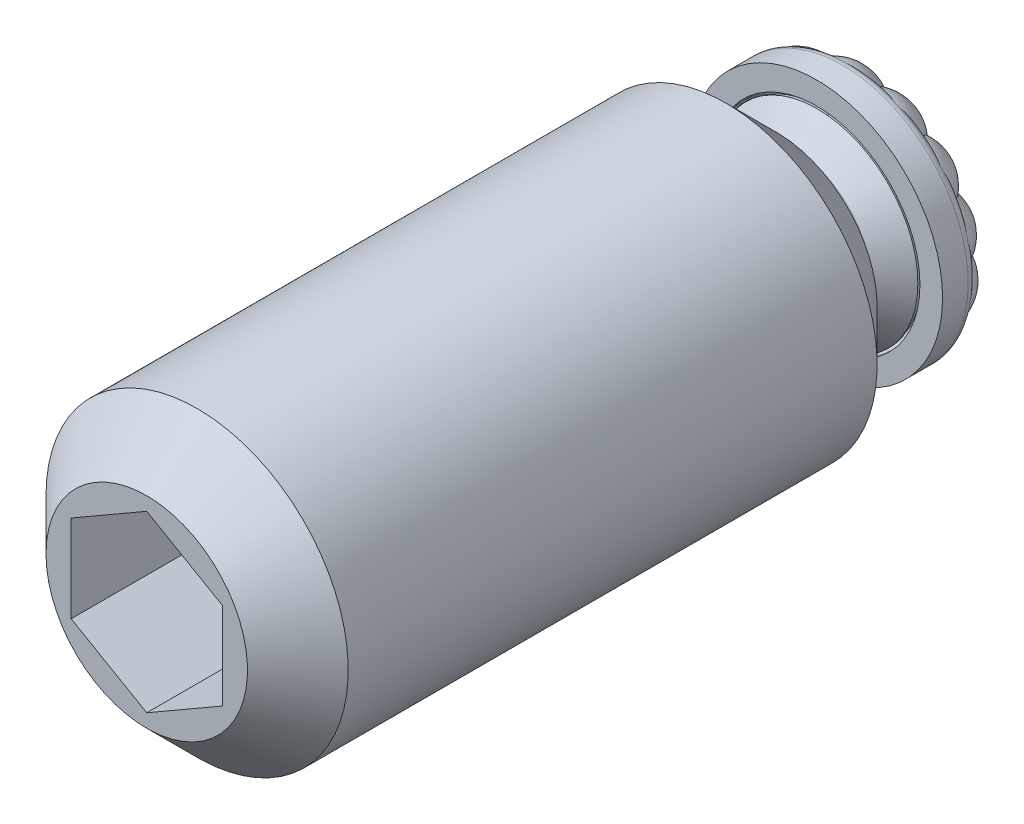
ISO-10303-21;
HEADER;
FILE_DESCRIPTION(('STEP AP214'),'2;1');
FILE_NAME('part.step','',(''),(''),'','','');
FILE_SCHEMA(('AUTOMOTIVE_DESIGN { 1 0 10303 214 1 1 1 1 }'));
ENDSEC;
DATA;
#1=APPLICATION_CONTEXT('core data for automotive mechanical design processes');
#2=APPLICATION_PROTOCOL_DEFINITION('international standard','automotive_design',2000,#1);
#3=PRODUCT_CONTEXT('',#1,'mechanical');
#4=PRODUCT('Part','Part','',(#3));
#5=PRODUCT_RELATED_PRODUCT_CATEGORY('part','',(#4));
#6=PRODUCT_DEFINITION_FORMATION('','',#4);
#7=PRODUCT_DEFINITION_CONTEXT('part definition',#1,'design');
#8=PRODUCT_DEFINITION('design','',#6,#7);
#9=PRODUCT_DEFINITION_SHAPE('','',#8);
#10=(LENGTH_UNIT() NAMED_UNIT(*) SI_UNIT(.MILLI.,.METRE.));
#11=(NAMED_UNIT(*) PLANE_ANGLE_UNIT() SI_UNIT($,.RADIAN.));
#12=(NAMED_UNIT(*) SI_UNIT($,.STERADIAN.) SOLID_ANGLE_UNIT());
#13=UNCERTAINTY_MEASURE_WITH_UNIT(LENGTH_MEASURE(1.E-05),#10,'distance_accuracy_value','');
#14=(GEOMETRIC_REPRESENTATION_CONTEXT(3) GLOBAL_UNCERTAINTY_ASSIGNED_CONTEXT((#13)) GLOBAL_UNIT_ASSIGNED_CONTEXT((#10,
#11,#12)) REPRESENTATION_CONTEXT('',''));
#15=CARTESIAN_POINT('',(0.,0.,0.));
#16=DIRECTION('',(0.,0.,1.));
#17=DIRECTION('',(1.,0.,0.));
#18=AXIS2_PLACEMENT_3D('',#15,#16,#17);
#19=CARTESIAN_POINT('',(0.,0.,2.0001200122));
#20=DIRECTION('',(0.,0.,-1.));
#21=DIRECTION('',(-0.262070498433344,0.965048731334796,0.));
#22=AXIS2_PLACEMENT_3D('',#19,#20,#21);
#23=PLANE('',#22);
#24=CARTESIAN_POINT('',(0.,0.,2.0001200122));
#25=DIRECTION('',(0.,0.,-1.));
#26=DIRECTION('',(-0.262070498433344,0.965048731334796,0.));
#27=AXIS2_PLACEMENT_3D('',#24,#25,#26);
#28=CIRCLE('',#27,3.8481);
#29=CARTESIAN_POINT('',(-1.00847348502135,3.71360402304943,2.0001200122));
#30=VERTEX_POINT('',#29);
#31=EDGE_CURVE('E1087',#30,#30,#28,.T.);
#32=ORIENTED_EDGE('',*,*,#31,.F.);
#33=EDGE_LOOP('',(#32));
#34=FACE_BOUND('',#33,.T.);
#35=CARTESIAN_POINT('',(0.,0.,2.0001200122));
#36=DIRECTION('',(0.,0.,1.));
#37=DIRECTION('',(1.,0.,0.));
#38=AXIS2_PLACEMENT_3D('',#35,#36,#37);
#39=CIRCLE('',#38,3.619);
#40=CARTESIAN_POINT('',(3.619,0.,2.0001200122));
#41=VERTEX_POINT('',#40);
#42=EDGE_CURVE('E364',#41,#41,#39,.T.);
#43=ORIENTED_EDGE('',*,*,#42,.F.);
#44=EDGE_LOOP('',(#43));
#45=FACE_BOUND('',#44,.T.);
#46=ADVANCED_FACE('F14',(#34,#45),#23,.F.);
#47=CARTESIAN_POINT('',(4.45756009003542,1.21050363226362,1.0001200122));
#48=DIRECTION('',(0.,0.,1.));
#49=DIRECTION('',(0.262070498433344,-0.965048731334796,0.));
#50=AXIS2_PLACEMENT_3D('',#47,#48,#49);
#51=PLANE('',#50);
#52=CARTESIAN_POINT('',(1.6047055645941,-3.01165673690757,1.0001200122));
#53=DIRECTION('',(0.,0.,1.));
#54=DIRECTION('',(-0.882536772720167,-0.470243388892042,0.));
#55=AXIS2_PLACEMENT_3D('',#52,#53,#54);
#56=CIRCLE('',#55,1.47478812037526);
#57=CARTESIAN_POINT('',(0.962871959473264,-1.68385794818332,1.0001200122));
#58=VERTEX_POINT('',#57);
#59=CARTESIAN_POINT('',(1.35071093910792,-1.55890530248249,1.0001200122));
#60=VERTEX_POINT('',#59);
#61=EDGE_CURVE('E871',#58,#60,#56,.F.);
#62=ORIENTED_EDGE('',*,*,#61,.F.);
#63=CARTESIAN_POINT('',(0.,0.,1.0001200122));
#64=DIRECTION('',(0.,0.,1.));
#65=DIRECTION('',(0.262070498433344,-0.965048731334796,0.));
#66=AXIS2_PLACEMENT_3D('',#63,#64,#65);
#67=CIRCLE('',#66,1.93971647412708);
#68=CARTESIAN_POINT('',(1.52961064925,-1.19280814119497,1.0001200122));
#69=VERTEX_POINT('',#68);
#70=EDGE_CURVE('E525',#58,#69,#67,.T.);
#71=ORIENTED_EDGE('',*,*,#70,.T.);
#72=CARTESIAN_POINT('',(2.7524986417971,-2.01715331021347,1.0001200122));
#73=DIRECTION('',(0.,0.,1.));
#74=DIRECTION('',(-0.591107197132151,-0.80659300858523,0.));
#75=AXIS2_PLACEMENT_3D('',#72,#73,#74);
#76=CIRCLE('',#75,1.47478812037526);
#77=EDGE_CURVE('E880',#60,#69,#76,.F.);
#78=ORIENTED_EDGE('',*,*,#77,.F.);
#79=EDGE_LOOP('',(#62,#71,#78));
#80=FACE_BOUND('',#79,.T.);
#81=ADVANCED_FACE('F1246',(#80),#51,.F.);
#82=CARTESIAN_POINT('',(1.5981162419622,-1.09932910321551,1.0001200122));
#83=VERTEX_POINT('',#82);
#84=CARTESIAN_POINT('',(1.89333216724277,-0.818473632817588,1.0001200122));
#85=VERTEX_POINT('',#84);
#86=EDGE_CURVE('E907',#83,#85,#76,.F.);
#87=ORIENTED_EDGE('',*,*,#86,.F.);
#88=CARTESIAN_POINT('',(1.89567163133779,-0.411009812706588,1.0001200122));
#89=VERTEX_POINT('',#88);
#90=EDGE_CURVE('E526',#83,#89,#67,.T.);
#91=ORIENTED_EDGE('',*,*,#90,.T.);
#92=CARTESIAN_POINT('',(3.35512560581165,-0.623127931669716,1.0001200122));
#93=DIRECTION('',(0.,0.,1.));
#94=DIRECTION('',(-0.182601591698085,-0.983186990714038,0.));
#95=AXIS2_PLACEMENT_3D('',#92,#93,#94);
#96=CIRCLE('',#95,1.47478812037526);
#97=EDGE_CURVE('E1690',#85,#89,#96,.F.);
#98=ORIENTED_EDGE('',*,*,#97,.F.);
#99=EDGE_LOOP('',(#87,#91,#98));
#100=FACE_BOUND('',#99,.T.);
#101=ADVANCED_FACE('F1251',(#100),#51,.F.);
#102=CARTESIAN_POINT('',(1.91683400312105,-0.297064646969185,1.0001200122));
#103=VERTEX_POINT('',#102);
#104=CARTESIAN_POINT('',(2.06095573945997,0.084066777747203,1.0001200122));
#105=VERTEX_POINT('',#104);
#106=EDGE_CURVE('E1126',#103,#105,#96,.F.);
#107=ORIENTED_EDGE('',*,*,#106,.F.);
#108=CARTESIAN_POINT('',(1.88627159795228,0.452194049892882,1.0001200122));
#109=VERTEX_POINT('',#108);
#110=EDGE_CURVE('E506',#103,#109,#67,.T.);
#111=ORIENTED_EDGE('',*,*,#110,.T.);
#112=CARTESIAN_POINT('',(3.29322879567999,0.894315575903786,1.0001200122));
#113=DIRECTION('',(0.,0.,1.));
#114=DIRECTION('',(0.262070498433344,-0.965048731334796,0.));
#115=AXIS2_PLACEMENT_3D('',#112,#113,#114);
#116=CIRCLE('',#115,1.47478812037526);
#117=EDGE_CURVE('E1072',#105,#109,#116,.F.);
#118=ORIENTED_EDGE('',*,*,#117,.F.);
#119=EDGE_LOOP('',(#107,#111,#118));
#120=FACE_BOUND('',#119,.T.);
#121=ADVANCED_FACE('F1659',(#120),#51,.F.);
#122=CARTESIAN_POINT('',(1.85589928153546,0.564037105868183,1.0001200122));
#123=VERTEX_POINT('',#122);
#124=CARTESIAN_POINT('',(1.82038175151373,0.969956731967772,1.0001200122));
#125=VERTEX_POINT('',#124);
#126=EDGE_CURVE('E1081',#123,#125,#116,.F.);
#127=ORIENTED_EDGE('',*,*,#126,.F.);
#128=CARTESIAN_POINT('',(1.50327234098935,1.22583533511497,1.0001200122));
#129=VERTEX_POINT('',#128);
#130=EDGE_CURVE('E492',#123,#129,#67,.T.);
#131=ORIENTED_EDGE('',*,*,#130,.T.);
#132=CARTESIAN_POINT('',(2.57906763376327,2.23462891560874,1.0001200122));
#133=DIRECTION('',(0.,0.,1.));
#134=DIRECTION('',(0.6548363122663,-0.755770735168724,0.));
#135=AXIS2_PLACEMENT_3D('',#132,#133,#134);
#136=CIRCLE('',#135,1.47478812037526);
#137=EDGE_CURVE('E918',#125,#129,#136,.F.);
#138=ORIENTED_EDGE('',*,*,#137,.F.);
#139=EDGE_LOOP('',(#127,#131,#138));
#140=FACE_BOUND('',#139,.T.);
#141=ADVANCED_FACE('F1651',(#140),#51,.F.);
#142=CARTESIAN_POINT('',(1.4273809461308,1.31342439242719,1.0001200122));
#143=VERTEX_POINT('',#142);
#144=CARTESIAN_POINT('',(1.21925883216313,1.66373485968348,1.0001200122));
#145=VERTEX_POINT('',#144);
#146=EDGE_CURVE('E927',#143,#145,#136,.F.);
#147=ORIENTED_EDGE('',*,*,#146,.F.);
#148=CARTESIAN_POINT('',(0.822531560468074,1.75668489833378,1.0001200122));
#149=VERTEX_POINT('',#148);
#150=EDGE_CURVE('E398',#143,#149,#67,.T.);
#151=ORIENTED_EDGE('',*,*,#150,.T.);
#152=CARTESIAN_POINT('',(1.35409049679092,3.13234659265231,1.0001200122));
#153=DIRECTION('',(0.,0.,1.));
#154=DIRECTION('',(0.917903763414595,-0.396803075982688,0.));
#155=AXIS2_PLACEMENT_3D('',#152,#153,#154);
#156=CIRCLE('',#155,1.47478812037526);
#157=EDGE_CURVE('E965',#145,#149,#156,.F.);
#158=ORIENTED_EDGE('',*,*,#157,.F.);
#159=EDGE_LOOP('',(#147,#151,#158));
#160=FACE_BOUND('',#159,.T.);
#161=ADVANCED_FACE('F1643',(#160),#51,.F.);
#162=CARTESIAN_POINT('',(0.716152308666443,1.80267186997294,1.0001200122));
#163=VERTEX_POINT('',#162);
#164=CARTESIAN_POINT('',(0.376646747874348,2.02798989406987,1.0001200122));
#165=VERTEX_POINT('',#164);
#166=EDGE_CURVE('E973',#163,#165,#156,.F.);
#167=ORIENTED_EDGE('',*,*,#166,.F.);
#168=CARTESIAN_POINT('',(-0.0211216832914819,1.93960147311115,1.0001200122));
#169=VERTEX_POINT('',#168);
#170=EDGE_CURVE('E298',#163,#169,#67,.T.);
#171=ORIENTED_EDGE('',*,*,#170,.T.);
#172=CARTESIAN_POINT('',(-0.139080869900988,3.40966461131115,1.0001200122));
#173=DIRECTION('',(0.,0.,1.));
#174=DIRECTION('',(0.999169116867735,0.0407562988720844,0.));
#175=AXIS2_PLACEMENT_3D('',#172,#173,#174);
#176=CIRCLE('',#175,1.47478812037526);
#177=EDGE_CURVE('E984',#165,#169,#176,.F.);
#178=ORIENTED_EDGE('',*,*,#177,.F.);
#179=EDGE_LOOP('',(#167,#171,#178));
#180=FACE_BOUND('',#179,.T.);
#181=ADVANCED_FACE('F1635',(#180),#51,.F.);
#182=CARTESIAN_POINT('',(-0.136919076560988,1.93487807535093,1.0001200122));
#183=VERTEX_POINT('',#182);
#184=CARTESIAN_POINT('',(-0.540564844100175,1.99057665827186,1.0001200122));
#185=VERTEX_POINT('',#184);
#186=EDGE_CURVE('E1010',#183,#185,#176,.F.);
#187=ORIENTED_EDGE('',*,*,#186,.F.);
#188=CARTESIAN_POINT('',(-0.860591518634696,1.73835618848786,1.0001200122));
#189=VERTEX_POINT('',#188);
#190=EDGE_CURVE('E500',#183,#189,#67,.T.);
#191=ORIENTED_EDGE('',*,*,#190,.T.);
#192=CARTESIAN_POINT('',(-1.60470556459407,3.01165673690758,1.0001200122));
#193=DIRECTION('',(0.,0.,1.));
#194=DIRECTION('',(0.88253677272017,0.470243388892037,0.));
#195=AXIS2_PLACEMENT_3D('',#192,#193,#194);
#196=CIRCLE('',#195,1.47478812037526);
#197=EDGE_CURVE('E572',#185,#189,#196,.F.);
#198=ORIENTED_EDGE('',*,*,#197,.F.);
#199=EDGE_LOOP('',(#187,#191,#198));
#200=FACE_BOUND('',#199,.T.);
#201=ADVANCED_FACE('F1179',(#200),#51,.F.);
#202=CARTESIAN_POINT('',(-0.962871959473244,1.68385794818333,1.0001200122));
#203=VERTEX_POINT('',#202);
#204=CARTESIAN_POINT('',(-1.35071093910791,1.55890530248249,1.0001200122));
#205=VERTEX_POINT('',#204);
#206=EDGE_CURVE('E569',#203,#205,#196,.F.);
#207=ORIENTED_EDGE('',*,*,#206,.F.);
#208=CARTESIAN_POINT('',(-1.52961064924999,1.19280814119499,1.0001200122));
#209=VERTEX_POINT('',#208);
#210=EDGE_CURVE('E512',#203,#209,#67,.T.);
#211=ORIENTED_EDGE('',*,*,#210,.T.);
#212=CARTESIAN_POINT('',(-2.75249864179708,2.01715331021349,1.0001200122));
#213=DIRECTION('',(0.,0.,1.));
#214=DIRECTION('',(0.591107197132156,0.806593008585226,0.));
#215=AXIS2_PLACEMENT_3D('',#212,#213,#214);
#216=CIRCLE('',#215,1.47478812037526);
#217=EDGE_CURVE('E577',#205,#209,#216,.F.);
#218=ORIENTED_EDGE('',*,*,#217,.F.);
#219=EDGE_LOOP('',(#207,#211,#218));
#220=FACE_BOUND('',#219,.T.);
#221=ADVANCED_FACE('F576',(#220),#51,.F.);
#222=CARTESIAN_POINT('',(-1.5981162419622,1.09932910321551,1.0001200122));
#223=VERTEX_POINT('',#222);
#224=CARTESIAN_POINT('',(-1.89333216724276,0.818473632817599,1.0001200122));
#225=VERTEX_POINT('',#224);
#226=EDGE_CURVE('E632',#223,#225,#216,.F.);
#227=ORIENTED_EDGE('',*,*,#226,.F.);
#228=CARTESIAN_POINT('',(-1.89567163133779,0.411009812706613,1.0001200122));
#229=VERTEX_POINT('',#228);
#230=EDGE_CURVE('E514',#223,#229,#67,.T.);
#231=ORIENTED_EDGE('',*,*,#230,.T.);
#232=CARTESIAN_POINT('',(-3.35512560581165,0.623127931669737,1.0001200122));
#233=DIRECTION('',(0.,0.,1.));
#234=DIRECTION('',(0.182601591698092,0.983186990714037,0.));
#235=AXIS2_PLACEMENT_3D('',#232,#233,#234);
#236=CIRCLE('',#235,1.47478812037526);
#237=EDGE_CURVE('E640',#225,#229,#236,.F.);
#238=ORIENTED_EDGE('',*,*,#237,.F.);
#239=EDGE_LOOP('',(#227,#231,#238));
#240=FACE_BOUND('',#239,.T.);
#241=ADVANCED_FACE('F1171',(#240),#51,.F.);
#242=CARTESIAN_POINT('',(-1.91683400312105,0.297064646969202,1.0001200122));
#243=VERTEX_POINT('',#242);
#244=CARTESIAN_POINT('',(-2.06095573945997,-0.0840667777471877,1.0001200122));
#245=VERTEX_POINT('',#244);
#246=EDGE_CURVE('E671',#243,#245,#236,.F.);
#247=ORIENTED_EDGE('',*,*,#246,.F.);
#248=CARTESIAN_POINT('',(-1.88627159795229,-0.45219404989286,1.0001200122));
#249=VERTEX_POINT('',#248);
#250=EDGE_CURVE('E516',#243,#249,#67,.T.);
#251=ORIENTED_EDGE('',*,*,#250,.T.);
#252=CARTESIAN_POINT('',(-3.29322879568,-0.894315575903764,1.0001200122));
#253=DIRECTION('',(0.,0.,1.));
#254=DIRECTION('',(-0.262070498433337,0.965048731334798,0.));
#255=AXIS2_PLACEMENT_3D('',#252,#253,#254);
#256=CIRCLE('',#255,1.47478812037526);
#257=EDGE_CURVE('E682',#245,#249,#256,.F.);
#258=ORIENTED_EDGE('',*,*,#257,.F.);
#259=EDGE_LOOP('',(#247,#251,#258));
#260=FACE_BOUND('',#259,.T.);
#261=ADVANCED_FACE('F1148',(#260),#51,.F.);
#262=CARTESIAN_POINT('',(-1.85589928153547,-0.564037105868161,1.0001200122));
#263=VERTEX_POINT('',#262);
#264=CARTESIAN_POINT('',(-1.82038175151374,-0.969956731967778,1.0001200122));
#265=VERTEX_POINT('',#264);
#266=EDGE_CURVE('E711',#263,#265,#256,.F.);
#267=ORIENTED_EDGE('',*,*,#266,.F.);
#268=CARTESIAN_POINT('',(-1.50327234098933,-1.22583533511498,1.0001200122));
#269=VERTEX_POINT('',#268);
#270=EDGE_CURVE('E518',#263,#269,#67,.T.);
#271=ORIENTED_EDGE('',*,*,#270,.T.);
#272=CARTESIAN_POINT('',(-2.57906763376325,-2.23462891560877,1.0001200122));
#273=DIRECTION('',(0.,0.,1.));
#274=DIRECTION('',(-0.654836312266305,0.75577073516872,0.));
#275=AXIS2_PLACEMENT_3D('',#272,#273,#274);
#276=CIRCLE('',#275,1.47478812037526);
#277=EDGE_CURVE('E722',#265,#269,#276,.F.);
#278=ORIENTED_EDGE('',*,*,#277,.F.);
#279=EDGE_LOOP('',(#267,#271,#278));
#280=FACE_BOUND('',#279,.T.);
#281=ADVANCED_FACE('F1178',(#280),#51,.F.);
#282=CARTESIAN_POINT('',(-1.4273809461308,-1.31342439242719,1.0001200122));
#283=VERTEX_POINT('',#282);
#284=CARTESIAN_POINT('',(-1.21925883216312,-1.66373485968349,1.0001200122));
#285=VERTEX_POINT('',#284);
#286=EDGE_CURVE('E751',#283,#285,#276,.F.);
#287=ORIENTED_EDGE('',*,*,#286,.F.);
#288=CARTESIAN_POINT('',(-0.82253156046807,-1.75668489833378,1.0001200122));
#289=VERTEX_POINT('',#288);
#290=EDGE_CURVE('E520',#283,#289,#67,.T.);
#291=ORIENTED_EDGE('',*,*,#290,.T.);
#292=CARTESIAN_POINT('',(-1.3540904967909,-3.13234659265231,1.0001200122));
#293=DIRECTION('',(0.,0.,1.));
#294=DIRECTION('',(-0.917903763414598,0.396803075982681,0.));
#295=AXIS2_PLACEMENT_3D('',#292,#293,#294);
#296=CIRCLE('',#295,1.47478812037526);
#297=EDGE_CURVE('E762',#285,#289,#296,.F.);
#298=ORIENTED_EDGE('',*,*,#297,.F.);
#299=EDGE_LOOP('',(#287,#291,#298));
#300=FACE_BOUND('',#299,.T.);
#301=ADVANCED_FACE('F1602',(#300),#51,.F.);
#302=CARTESIAN_POINT('',(-0.716152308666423,-1.80267186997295,1.0001200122));
#303=VERTEX_POINT('',#302);
#304=CARTESIAN_POINT('',(-0.376646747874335,-2.02798989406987,1.0001200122));
#305=VERTEX_POINT('',#304);
#306=EDGE_CURVE('E791',#303,#305,#296,.F.);
#307=ORIENTED_EDGE('',*,*,#306,.F.);
#308=CARTESIAN_POINT('',(0.0211216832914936,-1.93960147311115,1.0001200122));
#309=VERTEX_POINT('',#308);
#310=EDGE_CURVE('E522',#303,#309,#67,.T.);
#311=ORIENTED_EDGE('',*,*,#310,.T.);
#312=CARTESIAN_POINT('',(0.139080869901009,-3.40966461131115,1.0001200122));
#313=DIRECTION('',(0.,0.,1.));
#314=DIRECTION('',(-0.999169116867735,-0.0407562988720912,0.));
#315=AXIS2_PLACEMENT_3D('',#312,#313,#314);
#316=CIRCLE('',#315,1.47478812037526);
#317=EDGE_CURVE('E802',#305,#309,#316,.F.);
#318=ORIENTED_EDGE('',*,*,#317,.F.);
#319=EDGE_LOOP('',(#307,#311,#318));
#320=FACE_BOUND('',#319,.T.);
#321=ADVANCED_FACE('F1589',(#320),#51,.F.);
#322=CARTESIAN_POINT('',(4.58739866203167,0.187120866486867,1.0001200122));
#323=VERTEX_POINT('',#322);
#324=CARTESIAN_POINT('',(4.61686491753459,0.140425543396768,1.0001200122));
#325=VERTEX_POINT('',#324);
#326=EDGE_CURVE('E1121',#323,#325,#96,.F.);
#327=ORIENTED_EDGE('',*,*,#326,.F.);
#328=CARTESIAN_POINT('',(4.61296393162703,0.236060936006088,1.0001200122));
#329=VERTEX_POINT('',#328);
#330=EDGE_CURVE('E1080',#329,#323,#116,.F.);
#331=ORIENTED_EDGE('',*,*,#330,.F.);
#332=CARTESIAN_POINT('',(0.,0.,1.0001200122));
#333=DIRECTION('',(0.,0.,-1.));
#334=DIRECTION('',(-0.262070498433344,0.965048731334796,0.));
#335=AXIS2_PLACEMENT_3D('',#332,#333,#334);
#336=CIRCLE('',#335,4.619);
#337=EDGE_CURVE('E1038',#329,#325,#336,.T.);
#338=ORIENTED_EDGE('',*,*,#337,.T.);
#339=EDGE_LOOP('',(#327,#331,#338));
#340=FACE_BOUND('',#339,.T.);
#341=ADVANCED_FACE('F1120',(#340),#51,.F.);
#342=CARTESIAN_POINT('',(4.25855989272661,-1.78880648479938,1.0001200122));
#343=VERTEX_POINT('',#342);
#344=CARTESIAN_POINT('',(4.21429208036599,-1.8218076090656,1.0001200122));
#345=VERTEX_POINT('',#344);
#346=EDGE_CURVE('E1693',#343,#345,#96,.F.);
#347=ORIENTED_EDGE('',*,*,#346,.F.);
#348=CARTESIAN_POINT('',(4.22057991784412,-1.87666357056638,1.0001200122));
#349=VERTEX_POINT('',#348);
#350=EDGE_CURVE('E1043',#343,#349,#336,.T.);
#351=ORIENTED_EDGE('',*,*,#350,.T.);
#352=EDGE_CURVE('E292',#345,#349,#76,.F.);
#353=ORIENTED_EDGE('',*,*,#352,.F.);
#354=EDGE_LOOP('',(#347,#351,#353));
#355=FACE_BOUND('',#354,.T.);
#356=ADVANCED_FACE('F1581',(#355),#51,.F.);
#357=CARTESIAN_POINT('',(3.06069583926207,-3.45937884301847,1.0001200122));
#358=VERTEX_POINT('',#357);
#359=CARTESIAN_POINT('',(3.00649326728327,-3.46990474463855,1.0001200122));
#360=VERTEX_POINT('',#359);
#361=EDGE_CURVE('E900',#358,#360,#76,.F.);
#362=ORIENTED_EDGE('',*,*,#361,.F.);
#363=CARTESIAN_POINT('',(2.98835730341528,-3.52205644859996,1.0001200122));
#364=VERTEX_POINT('',#363);
#365=EDGE_CURVE('E1715',#358,#364,#336,.T.);
#366=ORIENTED_EDGE('',*,*,#365,.T.);
#367=EDGE_CURVE('E863',#360,#364,#56,.F.);
#368=ORIENTED_EDGE('',*,*,#367,.F.);
#369=EDGE_LOOP('',(#362,#366,#368));
#370=FACE_BOUND('',#369,.T.);
#371=ADVANCED_FACE('F1573',(#370),#51,.F.);
#372=CARTESIAN_POINT('',(1.25662343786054,-4.44477879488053,1.0001200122));
#373=VERTEX_POINT('',#372);
#374=CARTESIAN_POINT('',(1.20322159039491,-4.43074468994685,1.0001200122));
#375=VERTEX_POINT('',#374);
#376=EDGE_CURVE('E864',#373,#375,#56,.F.);
#377=ORIENTED_EDGE('',*,*,#376,.F.);
#378=CARTESIAN_POINT('',(1.16425387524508,-4.46986285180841,1.0001200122));
#379=VERTEX_POINT('',#378);
#380=EDGE_CURVE('E1717',#373,#379,#336,.T.);
#381=ORIENTED_EDGE('',*,*,#380,.T.);
#382=EDGE_CURVE('E823',#375,#379,#316,.F.);
#383=ORIENTED_EDGE('',*,*,#382,.F.);
#384=EDGE_LOOP('',(#377,#381,#383));
#385=FACE_BOUND('',#384,.T.);
#386=ADVANCED_FACE('F1565',(#385),#51,.F.);
#387=CARTESIAN_POINT('',(-0.796338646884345,-4.54983579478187,1.0001200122));
#388=VERTEX_POINT('',#387);
#389=CARTESIAN_POINT('',(-0.838362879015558,-4.51402130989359,1.0001200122));
#390=VERTEX_POINT('',#389);
#391=EDGE_CURVE('E824',#388,#390,#316,.F.);
#392=ORIENTED_EDGE('',*,*,#391,.F.);
#393=CARTESIAN_POINT('',(-0.890444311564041,-4.53235809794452,1.0001200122));
#394=VERTEX_POINT('',#393);
#395=EDGE_CURVE('E1719',#388,#394,#336,.T.);
#396=ORIENTED_EDGE('',*,*,#395,.T.);
#397=EDGE_CURVE('E783',#390,#394,#296,.F.);
#398=ORIENTED_EDGE('',*,*,#397,.F.);
#399=EDGE_LOOP('',(#392,#396,#398));
#400=FACE_BOUND('',#399,.T.);
#401=ADVANCED_FACE('F1557',(#400),#51,.F.);
#402=CARTESIAN_POINT('',(-2.69157609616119,-3.75374201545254,1.0001200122));
#403=VERTEX_POINT('',#402);
#404=CARTESIAN_POINT('',(-2.71389929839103,-3.70324064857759,1.0001200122));
#405=VERTEX_POINT('',#404);
#406=EDGE_CURVE('E784',#403,#405,#296,.F.);
#407=ORIENTED_EDGE('',*,*,#406,.F.);
#408=CARTESIAN_POINT('',(-2.76877908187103,-3.69716423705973,1.0001200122));
#409=VERTEX_POINT('',#408);
#410=EDGE_CURVE('E1160',#403,#409,#336,.T.);
#411=ORIENTED_EDGE('',*,*,#410,.T.);
#412=EDGE_CURVE('E743',#405,#409,#276,.F.);
#413=ORIENTED_EDGE('',*,*,#412,.F.);
#414=EDGE_LOOP('',(#407,#411,#413));
#415=FACE_BOUND('',#414,.T.);
#416=ADVANCED_FACE('F1549',(#415),#51,.F.);
#417=CARTESIAN_POINT('',(-4.05371388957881,-2.21417359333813,1.0001200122));
#418=VERTEX_POINT('',#417);
#419=CARTESIAN_POINT('',(-4.05191467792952,-2.15898775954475,1.0001200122));
#420=VERTEX_POINT('',#419);
#421=EDGE_CURVE('E744',#418,#420,#276,.F.);
#422=ORIENTED_EDGE('',*,*,#421,.F.);
#423=CARTESIAN_POINT('',(-4.09872319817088,-2.12970165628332,1.0001200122));
#424=VERTEX_POINT('',#423);
#425=EDGE_CURVE('E1157',#418,#424,#336,.T.);
#426=ORIENTED_EDGE('',*,*,#425,.T.);
#427=EDGE_CURVE('E703',#420,#424,#256,.F.);
#428=ORIENTED_EDGE('',*,*,#427,.F.);
#429=EDGE_LOOP('',(#422,#426,#428));
#430=FACE_BOUND('',#429,.T.);
#431=ADVANCED_FACE('F1542',(#430),#51,.F.);
#432=CARTESIAN_POINT('',(-4.61296393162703,-0.236060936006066,1.0001200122));
#433=VERTEX_POINT('',#432);
#434=CARTESIAN_POINT('',(-4.58739866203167,-0.187120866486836,1.0001200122));
#435=VERTEX_POINT('',#434);
#436=EDGE_CURVE('E704',#433,#435,#256,.F.);
#437=ORIENTED_EDGE('',*,*,#436,.F.);
#438=CARTESIAN_POINT('',(-4.61686491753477,-0.140425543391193,1.0001200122));
#439=VERTEX_POINT('',#438);
#440=EDGE_CURVE('E1156',#433,#439,#336,.T.);
#441=ORIENTED_EDGE('',*,*,#440,.T.);
#442=EDGE_CURVE('E662',#435,#439,#236,.F.);
#443=ORIENTED_EDGE('',*,*,#442,.F.);
#444=EDGE_LOOP('',(#437,#441,#443));
#445=FACE_BOUND('',#444,.T.);
#446=ADVANCED_FACE('F1154',(#445),#51,.F.);
#447=CARTESIAN_POINT('',(-4.2585598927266,1.7888064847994,1.0001200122));
#448=VERTEX_POINT('',#447);
#449=CARTESIAN_POINT('',(-4.21429208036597,1.82180760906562,1.0001200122));
#450=VERTEX_POINT('',#449);
#451=EDGE_CURVE('E664',#448,#450,#236,.F.);
#452=ORIENTED_EDGE('',*,*,#451,.F.);
#453=CARTESIAN_POINT('',(-4.2205799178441,1.8766635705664,1.0001200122));
#454=VERTEX_POINT('',#453);
#455=EDGE_CURVE('E1158',#448,#454,#336,.T.);
#456=ORIENTED_EDGE('',*,*,#455,.T.);
#457=EDGE_CURVE('E611',#450,#454,#216,.F.);
#458=ORIENTED_EDGE('',*,*,#457,.F.);
#459=EDGE_LOOP('',(#452,#456,#458));
#460=FACE_BOUND('',#459,.T.);
#461=ADVANCED_FACE('F1170',(#460),#51,.F.);
#462=CARTESIAN_POINT('',(-3.06069583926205,3.4593788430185,1.0001200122));
#463=VERTEX_POINT('',#462);
#464=CARTESIAN_POINT('',(-3.00649326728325,3.46990474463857,1.0001200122));
#465=VERTEX_POINT('',#464);
#466=EDGE_CURVE('E612',#463,#465,#216,.F.);
#467=ORIENTED_EDGE('',*,*,#466,.F.);
#468=CARTESIAN_POINT('',(-2.98835730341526,3.52205644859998,1.0001200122));
#469=VERTEX_POINT('',#468);
#470=EDGE_CURVE('E1035',#463,#469,#336,.T.);
#471=ORIENTED_EDGE('',*,*,#470,.T.);
#472=EDGE_CURVE('E579',#465,#469,#196,.F.);
#473=ORIENTED_EDGE('',*,*,#472,.F.);
#474=EDGE_LOOP('',(#467,#471,#473));
#475=FACE_BOUND('',#474,.T.);
#476=ADVANCED_FACE('F1166',(#475),#51,.F.);
#477=CARTESIAN_POINT('',(-1.25662343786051,4.44477879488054,1.0001200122));
#478=VERTEX_POINT('',#477);
#479=CARTESIAN_POINT('',(-1.20322159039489,4.43074468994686,1.0001200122));
#480=VERTEX_POINT('',#479);
#481=EDGE_CURVE('E581',#478,#480,#196,.F.);
#482=ORIENTED_EDGE('',*,*,#481,.F.);
#483=CARTESIAN_POINT('',(-1.16425387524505,4.46986285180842,1.0001200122));
#484=VERTEX_POINT('',#483);
#485=EDGE_CURVE('E1016',#478,#484,#336,.T.);
#486=ORIENTED_EDGE('',*,*,#485,.T.);
#487=EDGE_CURVE('E1003',#480,#484,#176,.F.);
#488=ORIENTED_EDGE('',*,*,#487,.F.);
#489=EDGE_LOOP('',(#482,#486,#488));
#490=FACE_BOUND('',#489,.T.);
#491=ADVANCED_FACE('F1014',(#490),#51,.F.);
#492=CARTESIAN_POINT('',(0.796338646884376,4.54983579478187,1.0001200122));
#493=VERTEX_POINT('',#492);
#494=CARTESIAN_POINT('',(0.838362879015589,4.51402130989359,1.0001200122));
#495=VERTEX_POINT('',#494);
#496=EDGE_CURVE('E1005',#493,#495,#176,.F.);
#497=ORIENTED_EDGE('',*,*,#496,.F.);
#498=CARTESIAN_POINT('',(0.890444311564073,4.53235809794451,1.0001200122));
#499=VERTEX_POINT('',#498);
#500=EDGE_CURVE('E1030',#493,#499,#336,.T.);
#501=ORIENTED_EDGE('',*,*,#500,.T.);
#502=EDGE_CURVE('E947',#495,#499,#156,.F.);
#503=ORIENTED_EDGE('',*,*,#502,.F.);
#504=EDGE_LOOP('',(#497,#501,#503));
#505=FACE_BOUND('',#504,.T.);
#506=ADVANCED_FACE('F1029',(#505),#51,.F.);
#507=CARTESIAN_POINT('',(2.69157609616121,3.75374201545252,1.0001200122));
#508=VERTEX_POINT('',#507);
#509=CARTESIAN_POINT('',(2.71389929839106,3.70324064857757,1.0001200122));
#510=VERTEX_POINT('',#509);
#511=EDGE_CURVE('E948',#508,#510,#156,.F.);
#512=ORIENTED_EDGE('',*,*,#511,.F.);
#513=CARTESIAN_POINT('',(2.7687790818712,3.69716423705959,1.0001200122));
#514=VERTEX_POINT('',#513);
#515=EDGE_CURVE('E1033',#508,#514,#336,.T.);
#516=ORIENTED_EDGE('',*,*,#515,.T.);
#517=EDGE_CURVE('E932',#510,#514,#136,.F.);
#518=ORIENTED_EDGE('',*,*,#517,.F.);
#519=EDGE_LOOP('',(#512,#516,#518));
#520=FACE_BOUND('',#519,.T.);
#521=ADVANCED_FACE('F1504',(#520),#51,.F.);
#522=CARTESIAN_POINT('',(0.136919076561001,-1.93487807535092,1.0001200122));
#523=VERTEX_POINT('',#522);
#524=CARTESIAN_POINT('',(0.540564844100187,-1.99057665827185,1.0001200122));
#525=VERTEX_POINT('',#524);
#526=EDGE_CURVE('E831',#523,#525,#316,.F.);
#527=ORIENTED_EDGE('',*,*,#526,.F.);
#528=CARTESIAN_POINT('',(0.860591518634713,-1.73835618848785,1.0001200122));
#529=VERTEX_POINT('',#528);
#530=EDGE_CURVE('E524',#523,#529,#67,.T.);
#531=ORIENTED_EDGE('',*,*,#530,.T.);
#532=EDGE_CURVE('E842',#525,#529,#56,.F.);
#533=ORIENTED_EDGE('',*,*,#532,.F.);
#534=EDGE_LOOP('',(#527,#531,#533));
#535=FACE_BOUND('',#534,.T.);
#536=ADVANCED_FACE('F1497',(#535),#51,.F.);
#537=CARTESIAN_POINT('',(4.05371388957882,2.21417359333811,1.0001200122));
#538=VERTEX_POINT('',#537);
#539=CARTESIAN_POINT('',(4.05191467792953,2.15898775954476,1.0001200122));
#540=VERTEX_POINT('',#539);
#541=EDGE_CURVE('E926',#538,#540,#136,.F.);
#542=ORIENTED_EDGE('',*,*,#541,.F.);
#543=CARTESIAN_POINT('',(4.09872319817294,2.12970165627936,1.0001200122));
#544=VERTEX_POINT('',#543);
#545=EDGE_CURVE('E1037',#538,#544,#336,.T.);
#546=ORIENTED_EDGE('',*,*,#545,.T.);
#547=EDGE_CURVE('E1088',#540,#544,#116,.F.);
#548=ORIENTED_EDGE('',*,*,#547,.F.);
#549=EDGE_LOOP('',(#542,#546,#548));
#550=FACE_BOUND('',#549,.T.);
#551=ADVANCED_FACE('F1110',(#550),#51,.F.);
#552=CARTESIAN_POINT('',(0.,0.,1.3811200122));
#553=DIRECTION('',(0.,0.,-1.));
#554=DIRECTION('',(-0.262070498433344,0.965048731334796,0.));
#555=AXIS2_PLACEMENT_3D('',#552,#553,#554);
#556=TOROIDAL_SURFACE('',#555,4.619,0.381);
#557=CARTESIAN_POINT('',(0.,0.,1.3811200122));
#558=DIRECTION('',(0.,0.,-1.));
#559=DIRECTION('',(-0.262070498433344,0.965048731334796,0.));
#560=AXIS2_PLACEMENT_3D('',#557,#558,#559);
#561=CIRCLE('',#560,5.);
#562=CARTESIAN_POINT('',(-1.31035249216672,4.82524365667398,1.3811200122));
#563=VERTEX_POINT('',#562);
#564=EDGE_CURVE('E1044',#563,#563,#561,.T.);
#565=ORIENTED_EDGE('',*,*,#564,.T.);
#566=EDGE_LOOP('',(#565));
#567=FACE_BOUND('',#566,.T.);
#568=CARTESIAN_POINT('',(4.17645397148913,0.719636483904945,1.3813200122));
#569=CARTESIAN_POINT('',(4.17695091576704,0.716578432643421,1.36337632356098));
#570=CARTESIAN_POINT('',(4.17898597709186,0.71226235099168,1.34580397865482));
#571=CARTESIAN_POINT('',(4.18555287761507,0.701598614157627,1.31200394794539));
#572=CARTESIAN_POINT('',(4.19005398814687,0.695276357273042,1.29576248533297));
#573=CARTESIAN_POINT('',(4.20097404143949,0.681039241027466,1.26487749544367));
#574=CARTESIAN_POINT('',(4.20737945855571,0.673135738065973,1.25022366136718));
#575=CARTESIAN_POINT('',(4.22164685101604,0.656026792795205,1.22240888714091));
#576=CARTESIAN_POINT('',(4.22951388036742,0.646816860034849,1.20925339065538));
#577=CARTESIAN_POINT('',(4.25211936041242,0.620619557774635,1.17583843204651));
#578=CARTESIAN_POINT('',(4.26783481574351,0.602673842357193,1.1569924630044));
#579=CARTESIAN_POINT('',(4.30085566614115,0.564724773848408,1.12320535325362));
#580=CARTESIAN_POINT('',(4.31816445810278,0.544717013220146,1.10827282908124));
#581=CARTESIAN_POINT('',(4.36369768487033,0.491132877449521,1.07415751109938));
#582=CARTESIAN_POINT('',(4.39244953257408,0.456397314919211,1.05750568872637));
#583=CARTESIAN_POINT('',(4.44962831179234,0.384216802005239,1.03103569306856));
#584=CARTESIAN_POINT('',(4.47805452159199,0.346766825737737,1.02123057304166));
#585=CARTESIAN_POINT('',(4.54653388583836,0.251499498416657,1.00391598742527));
#586=CARTESIAN_POINT('',(4.58570702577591,0.192446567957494,0.999701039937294));
#587=CARTESIAN_POINT('',(4.65841795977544,0.0711433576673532,1.00060306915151));
#588=CARTESIAN_POINT('',(4.69195307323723,0.00889157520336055,1.00572447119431));
#589=CARTESIAN_POINT('',(4.75287124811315,-0.119832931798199,1.02330439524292));
#590=CARTESIAN_POINT('',(4.7800425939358,-0.186376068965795,1.03597580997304));
#591=CARTESIAN_POINT('',(4.82579076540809,-0.321373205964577,1.06649345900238));
#592=CARTESIAN_POINT('',(4.84434585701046,-0.389831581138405,1.08435259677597));
#593=CARTESIAN_POINT('',(4.86878884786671,-0.513910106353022,1.11814567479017));
#594=CARTESIAN_POINT('',(4.87649979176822,-0.569266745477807,1.1337172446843));
#595=CARTESIAN_POINT('',(4.8825998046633,-0.652960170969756,1.15528307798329));
#596=CARTESIAN_POINT('',(4.88372764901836,-0.680867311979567,1.16215181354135));
#597=CARTESIAN_POINT('',(4.88395660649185,-0.736987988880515,1.17446921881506));
#598=CARTESIAN_POINT('',(4.88305962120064,-0.765201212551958,1.17991921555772));
#599=CARTESIAN_POINT('',(4.87812811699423,-0.832472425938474,1.18969854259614));
#600=CARTESIAN_POINT('',(4.87305232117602,-0.871667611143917,1.19286047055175));
#601=CARTESIAN_POINT('',(4.85813880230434,-0.949090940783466,1.19213040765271));
#602=CARTESIAN_POINT('',(4.84829711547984,-0.987318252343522,1.18823253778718));
#603=CARTESIAN_POINT('',(4.82742019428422,-1.05327609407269,1.17723122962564));
#604=CARTESIAN_POINT('',(4.81714707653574,-1.08143869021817,1.17104225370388));
#605=CARTESIAN_POINT('',(4.79464596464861,-1.13664815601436,1.15730666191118));
#606=CARTESIAN_POINT('',(4.7824161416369,-1.16369395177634,1.14975877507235));
#607=CARTESIAN_POINT('',(4.75612701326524,-1.21696427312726,1.13412216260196));
#608=CARTESIAN_POINT('',(4.74205526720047,-1.24318155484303,1.12602995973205));
#609=CARTESIAN_POINT('',(4.71228855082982,-1.29470100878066,1.10991179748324));
#610=CARTESIAN_POINT('',(4.69659327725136,-1.32000300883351,1.10188585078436));
#611=CARTESIAN_POINT('',(4.65683815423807,-1.38008550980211,1.08302240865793));
#612=CARTESIAN_POINT('',(4.63201345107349,-1.41443373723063,1.07240313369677));
#613=CARTESIAN_POINT('',(4.57959207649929,-1.48142796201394,1.05276442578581));
#614=CARTESIAN_POINT('',(4.5519942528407,-1.51407324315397,1.04374566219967));
#615=CARTESIAN_POINT('',(4.465566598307,-1.60923564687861,1.01997559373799));
#616=CARTESIAN_POINT('',(4.40292550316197,-1.66924151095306,1.00841929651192));
#617=CARTESIAN_POINT('',(4.28859540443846,-1.76628448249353,0.99940943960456));
#618=CARTESIAN_POINT('',(4.23862375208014,-1.80510349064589,0.998954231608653));
#619=CARTESIAN_POINT('',(4.1362731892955,-1.87859338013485,1.00647341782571));
#620=CARTESIAN_POINT('',(4.08389819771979,-1.91327070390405,1.01443452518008));
#621=CARTESIAN_POINT('',(3.99830890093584,-1.9662782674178,1.03623721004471));
#622=CARTESIAN_POINT('',(3.96509655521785,-1.98594685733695,1.04686081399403));
#623=CARTESIAN_POINT('',(3.89962932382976,-2.02337704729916,1.07326392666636));
#624=CARTESIAN_POINT('',(3.86737311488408,-2.04114138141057,1.08903590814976));
#625=CARTESIAN_POINT('',(3.8153610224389,-2.06918004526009,1.1207033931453));
#626=CARTESIAN_POINT('',(3.79491040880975,-2.08003099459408,1.13494138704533));
#627=CARTESIAN_POINT('',(3.7560057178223,-2.1006160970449,1.16665361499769));
#628=CARTESIAN_POINT('',(3.73754983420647,-2.1103512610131,1.18412488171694));
#629=CARTESIAN_POINT('',(3.70882142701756,-2.12580207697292,1.21695260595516));
#630=CARTESIAN_POINT('',(3.6977349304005,-2.1318601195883,1.2314308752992));
#631=CARTESIAN_POINT('',(3.67783814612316,-2.14313612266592,1.26211746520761));
#632=CARTESIAN_POINT('',(3.66901867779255,-2.14835743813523,1.27831841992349));
#633=CARTESIAN_POINT('',(3.65589433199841,-2.15680283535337,1.30875856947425));
#634=CARTESIAN_POINT('',(3.65103127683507,-2.16021629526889,1.3227008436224));
#635=CARTESIAN_POINT('',(3.64350524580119,-2.16632295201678,1.35145037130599));
#636=CARTESIAN_POINT('',(3.64086258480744,-2.1690093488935,1.3662643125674));
#637=CARTESIAN_POINT('',(3.63954526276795,-2.17125648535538,1.3813200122));
#638=B_SPLINE_CURVE_WITH_KNOTS('',3,(#568,#569,#570,#571,#572,#573,#574,#575,#576,#577,#578,
#579,#580,#581,#582,#583,#584,#585,#586,#587,#588,#589,#590,#591,#592,#593,#594,#595,#596,#597,
#598,#599,#600,#601,#602,#603,#604,#605,#606,#607,#608,#609,#610,#611,#612,#613,#614,#615,#616,
#617,#618,#619,#620,#621,#622,#623,#624,#625,#626,#627,#628,#629,#630,#631,#632,#633,#634,#635,
#636,#637),.UNSPECIFIED.,.F.,.F.,(4,2,2,2,2,2,2,2,2,2,2,2,2,2,2,2,2,2,2,2,2,2,2,2,2,2,2,2,2,2,2,
2,2,2,4),(0.,0.0543566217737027,0.108050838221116,0.161372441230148,0.214881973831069,
0.305562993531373,0.396442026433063,0.539841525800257,0.683513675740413,0.895328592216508,
1.10724393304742,1.32543802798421,1.54417955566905,1.71781644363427,1.80402380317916,
1.89015023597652,2.00825445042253,2.12645706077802,2.21816234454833,2.30995384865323,
2.40240083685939,2.49486512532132,2.62576791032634,2.75672531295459,3.01766402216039,
3.20693412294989,3.39590586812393,3.51572552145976,3.63537077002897,3.71669522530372,
3.7979454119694,3.85540994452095,3.91263796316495,3.95791419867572,4.00360030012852),.UNSPECIFIED.);
#639=EDGE_CURVE('E1117',#325,#343,#638,.T.);
#640=ORIENTED_EDGE('',*,*,#639,.F.);
#641=ORIENTED_EDGE('',*,*,#337,.F.);
#642=CARTESIAN_POINT('',(3.45061643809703,2.4604655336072,1.3813200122));
#643=CARTESIAN_POINT('',(3.45239100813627,2.45792594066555,1.36337632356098));
#644=CARTESIAN_POINT('',(3.4560972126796,2.45492026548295,1.34580397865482));
#645=CARTESIAN_POINT('',(3.46664060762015,2.44816184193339,1.31200394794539));
#646=CARTESIAN_POINT('',(3.47343909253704,2.44441864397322,1.29576248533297));
#647=CARTESIAN_POINT('',(3.4894549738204,2.43632947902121,1.26487749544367));
#648=CARTESIAN_POINT('',(3.49865525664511,2.43198787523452,1.25022366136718));
#649=CARTESIAN_POINT('',(3.51893302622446,2.42276363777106,1.22240888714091));
#650=CARTESIAN_POINT('',(3.530017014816,2.41787915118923,1.20925339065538));
#651=CARTESIAN_POINT('',(3.56175043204,2.40408434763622,1.17583843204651));
#652=CARTESIAN_POINT('',(3.58369592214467,2.39473449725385,1.1569924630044));
#653=CARTESIAN_POINT('',(3.62991216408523,2.37487077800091,1.12320535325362));
#654=CARTESIAN_POINT('',(3.65418788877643,2.36435441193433,1.10827282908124));
#655=CARTESIAN_POINT('',(3.71846119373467,2.33583290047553,1.07415751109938));
#656=CARTESIAN_POINT('',(3.75943690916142,2.31701219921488,1.05750568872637));
#657=CARTESIAN_POINT('',(3.84227115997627,2.27678874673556,1.03103569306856));
#658=CARTESIAN_POINT('',(3.88413122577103,2.25538115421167,1.02123057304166));
#659=CARTESIAN_POINT('',(3.98716394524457,2.19926034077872,1.00391598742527));
#660=CARTESIAN_POINT('',(4.04807983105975,2.16305207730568,0.999701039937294));
#661=CARTESIAN_POINT('',(4.16622160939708,2.08530975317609,1.00060306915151));
#662=CARTESIAN_POINT('',(4.22344573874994,2.04377317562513,1.00572447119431));
#663=CARTESIAN_POINT('',(4.33418258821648,1.95422780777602,1.02330439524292));
#664=CARTESIAN_POINT('',(4.38753511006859,1.90606371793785,1.03597580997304));
#665=CARTESIAN_POINT('',(4.48732585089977,1.80428488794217,1.06649345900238));
#666=CARTESIAN_POINT('',(4.53374638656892,1.75065677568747,1.08435259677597));
#667=CARTESIAN_POINT('',(4.60960441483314,1.64947130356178,1.11814567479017));
#668=CARTESIAN_POINT('',(4.64057008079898,1.60294234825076,1.13371724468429));
#669=CARTESIAN_POINT('',(4.68237921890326,1.53018387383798,1.15528307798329));
#670=CARTESIAN_POINT('',(4.69550382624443,1.5055297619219,1.16215181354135));
#671=CARTESIAN_POINT('',(4.72005995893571,1.45506612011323,1.17446921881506));
#672=CARTESIAN_POINT('',(4.7314930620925,1.42925769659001,1.17991921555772));
#673=CARTESIAN_POINT('',(4.75623781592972,1.36650872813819,1.18969854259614));
#674=CARTESIAN_POINT('',(4.76867083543,1.32899278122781,1.19286047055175));
#675=CARTESIAN_POINT('',(4.78882694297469,1.25276603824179,1.19213040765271));
#676=CARTESIAN_POINT('',(4.79654609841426,1.21405427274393,1.18823253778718));
#677=CARTESIAN_POINT('',(4.80635467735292,1.1455701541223,1.17723122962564));
#678=CARTESIAN_POINT('',(4.80931821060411,1.1157391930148,1.17104225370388));
#679=CARTESIAN_POINT('',(4.81299989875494,1.05623431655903,1.15730666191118));
#680=CARTESIAN_POINT('',(4.81371593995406,1.02656057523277,1.14975877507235));
#681=CARTESIAN_POINT('',(4.81314337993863,0.96715924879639,1.13412216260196));
#682=CARTESIAN_POINT('',(4.81184042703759,0.937432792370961,1.12602995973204));
#683=CARTESIAN_POINT('',(4.80737499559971,0.878100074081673,1.10991179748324));
#684=CARTESIAN_POINT('',(4.80421216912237,0.848493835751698,1.10188585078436));
#685=CARTESIAN_POINT('',(4.79446286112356,0.777112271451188,1.08302240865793));
#686=CARTESIAN_POINT('',(4.78699971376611,0.735394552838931,1.07240313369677));
#687=CARTESIAN_POINT('',(4.76883739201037,0.652290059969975,1.05276442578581));
#688=CARTESIAN_POINT('',(4.7581368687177,0.610903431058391,1.04374566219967));
#689=CARTESIAN_POINT('',(4.72155766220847,0.487665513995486,1.01997559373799));
#690=CARTESIAN_POINT('',(4.6911555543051,0.406423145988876,1.00841929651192));
#691=CARTESIAN_POINT('',(4.63025306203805,0.269384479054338,0.99940943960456));
#692=CARTESIAN_POINT('',(4.60207309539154,0.212727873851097,0.998954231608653));
#693=CARTESIAN_POINT('',(4.5417444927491,0.102107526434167,1.00647341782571));
#694=CARTESIAN_POINT('',(4.50960218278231,0.0481396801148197,1.01443452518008));
#695=CARTESIAN_POINT('',(4.45548801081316,-0.0367542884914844,1.03623721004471));
#696=CARTESIAN_POINT('',(4.43409860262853,-0.0688853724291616,1.04686081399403));
#697=CARTESIAN_POINT('',(4.39135501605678,-0.131013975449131,1.07326392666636));
#698=CARTESIAN_POINT('',(4.37000083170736,-0.161014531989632,1.08903590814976));
#699=CARTESIAN_POINT('',(4.33530507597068,-0.208843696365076,1.1207033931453));
#700=CARTESIAN_POINT('',(4.32158776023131,-0.22749325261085,1.13494138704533));
#701=CARTESIAN_POINT('',(4.29546738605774,-0.26291990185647,1.16665361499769));
#702=CARTESIAN_POINT('',(4.28306313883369,-0.2796986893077,1.18412488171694));
#703=CARTESIAN_POINT('',(4.26388359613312,-0.3060841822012,1.21695260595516));
#704=CARTESIAN_POINT('',(4.25652349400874,-0.316352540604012,1.2314308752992));
#705=CARTESIAN_POINT('',(4.24348958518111,-0.335144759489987,1.26211746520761));
#706=CARTESIAN_POINT('',(4.23780896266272,-0.343675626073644,1.27831841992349));
#707=CARTESIAN_POINT('',(4.22964865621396,-0.356979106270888,1.30875856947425));
#708=CARTESIAN_POINT('',(4.22674823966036,-0.362164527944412,1.3227008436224));
#709=CARTESIAN_POINT('',(4.22261709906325,-0.37093185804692,1.35145037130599));
#710=CARTESIAN_POINT('',(4.22140172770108,-0.374498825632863,1.3662643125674));
#711=CARTESIAN_POINT('',(4.22118985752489,-0.377094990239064,1.3813200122));
#712=B_SPLINE_CURVE_WITH_KNOTS('',3,(#642,#643,#644,#645,#646,#647,#648,#649,#650,#651,#652,
#653,#654,#655,#656,#657,#658,#659,#660,#661,#662,#663,#664,#665,#666,#667,#668,#669,#670,#671,
#672,#673,#674,#675,#676,#677,#678,#679,#680,#681,#682,#683,#684,#685,#686,#687,#688,#689,#690,
#691,#692,#693,#694,#695,#696,#697,#698,#699,#700,#701,#702,#703,#704,#705,#706,#707,#708,#709,
#710,#711),.UNSPECIFIED.,.F.,.F.,(4,2,2,2,2,2,2,2,2,2,2,2,2,2,2,2,2,2,2,2,2,2,2,2,2,2,2,2,2,2,2,
2,2,2,4),(0.,0.0543566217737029,0.108050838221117,0.161372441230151,0.214881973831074,
0.305562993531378,0.396442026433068,0.539841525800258,0.683513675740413,0.895328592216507,
1.10724393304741,1.3254380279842,1.54417955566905,1.71781644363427,1.80402380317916,
1.89015023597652,2.00825445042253,2.12645706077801,2.21816234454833,2.30995384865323,
2.40240083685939,2.49486512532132,2.62576791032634,2.75672531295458,3.01766402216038,
3.20693412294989,3.39590586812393,3.51572552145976,3.63537077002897,3.71669522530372,
3.79794541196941,3.85540994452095,3.91263796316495,3.95791419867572,4.00360030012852),.UNSPECIFIED.);
#713=EDGE_CURVE('E1042',#544,#329,#712,.T.);
#714=ORIENTED_EDGE('',*,*,#713,.F.);
#715=ORIENTED_EDGE('',*,*,#545,.F.);
#716=CARTESIAN_POINT('',(2.04134200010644,3.71396920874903,1.3813200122));
#717=CARTESIAN_POINT('',(2.04404272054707,3.7124510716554,1.36337632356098));
#718=CARTESIAN_POINT('',(2.04868600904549,3.71135111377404,1.34580397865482));
#719=CARTESIAN_POINT('',(2.06111764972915,3.70983659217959,1.31200394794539));
#720=CARTESIAN_POINT('',(2.06886698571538,3.70941383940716,1.29576248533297));
#721=CARTESIAN_POINT('',(2.08680655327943,3.70907478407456,1.26487749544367));
#722=CARTESIAN_POINT('',(2.09697947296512,3.70915498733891,1.25022366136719));
#723=CARTESIAN_POINT('',(2.11925135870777,3.70964243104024,1.22240888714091));
#724=CARTESIAN_POINT('',(2.13135698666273,3.71005082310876,1.20925339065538));
#725=CARTESIAN_POINT('',(2.16593314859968,3.7113907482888,1.17583843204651));
#726=CARTESIAN_POINT('',(2.18976210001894,3.71248861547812,1.15699246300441));
#727=CARTESIAN_POINT('',(2.24002003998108,3.71464449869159,1.12320535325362));
#728=CARTESIAN_POINT('',(2.26645459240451,3.71570242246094,1.10827282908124));
#729=CARTESIAN_POINT('',(2.33673785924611,3.71789257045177,1.07415751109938));
#730=CARTESIAN_POINT('',(2.38182169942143,3.7187144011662,1.05750568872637));
#731=CARTESIAN_POINT('',(2.47390508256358,3.71841475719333,1.03103569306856));
#732=CARTESIAN_POINT('',(2.52090810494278,3.71728958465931,1.02123057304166));
#733=CARTESIAN_POINT('',(2.63808728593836,3.71143070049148,1.00391598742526));
#734=CARTESIAN_POINT('',(2.70868077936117,3.70523859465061,0.999701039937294));
#735=CARTESIAN_POINT('',(2.84885397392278,3.68645497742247,1.00060306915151));
#736=CARTESIAN_POINT('',(2.91843317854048,3.67386043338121,1.00572447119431));
#737=CARTESIAN_POINT('',(3.05705591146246,3.64122976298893,1.02330439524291));
#738=CARTESIAN_POINT('',(3.12602248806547,3.62098420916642,1.03597580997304));
#739=CARTESIAN_POINT('',(3.26009101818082,3.57258223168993,1.06649345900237));
#740=CARTESIAN_POINT('',(3.32518284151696,3.54440608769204,1.08435259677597));
#741=CARTESIAN_POINT('',(3.43743129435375,3.48615469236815,1.11814567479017));
#742=CARTESIAN_POINT('',(3.48551855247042,3.45766905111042,1.1337172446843));
#743=CARTESIAN_POINT('',(3.55475600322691,3.41025623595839,1.15528307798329));
#744=CARTESIAN_POINT('',(3.57727788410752,3.39373820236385,1.16215181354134));
#745=CARTESIAN_POINT('',(3.62129754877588,3.35892653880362,1.17446921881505));
#746=CARTESIAN_POINT('',(3.64279627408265,3.34063459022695,1.17991921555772));
#747=CARTESIAN_POINT('',(3.69231628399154,3.2948360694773,1.18969854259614));
#748=CARTESIAN_POINT('',(3.71979560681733,3.26642985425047,1.19286047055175));
#749=CARTESIAN_POINT('',(3.77102917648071,3.20649733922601,1.1921304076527));
#750=CARTESIAN_POINT('',(3.79478030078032,3.17496845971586,1.18823253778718));
#751=CARTESIAN_POINT('',(3.83333167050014,3.11752218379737,1.17723122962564));
#752=CARTESIAN_POINT('',(3.84894489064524,3.09193124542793,1.17104225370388));
#753=CARTESIAN_POINT('',(3.87808017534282,3.03991662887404,1.15730666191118));
#754=CARTESIAN_POINT('',(3.89160026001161,3.01349219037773,1.14975877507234));
#755=CARTESIAN_POINT('',(3.91685767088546,2.95972502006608,1.13412216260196));
#756=CARTESIAN_POINT('',(3.92858157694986,2.93237707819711,1.12602995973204));
#757=CARTESIAN_POINT('',(3.95030186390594,2.8769826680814,1.10991179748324));
#758=CARTESIAN_POINT('',(3.9602979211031,2.84893607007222,1.10188585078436));
#759=CARTESIAN_POINT('',(3.98248539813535,2.78039343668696,1.08302240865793));
#760=CARTESIAN_POINT('',(3.99386197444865,2.73956893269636,1.07240313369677));
#761=CARTESIAN_POINT('',(4.01355597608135,2.65681403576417,1.05276442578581));
#762=CARTESIAN_POINT('',(4.02187212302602,2.61488318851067,1.04374566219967));
#763=CARTESIAN_POINT('',(4.04238632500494,2.48797853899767,1.01997559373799));
#764=CARTESIAN_POINT('',(4.05024471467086,2.40159071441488,1.00841929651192));
#765=CARTESIAN_POINT('',(4.05483231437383,2.25169854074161,0.99940943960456));
#766=CARTESIAN_POINT('',(4.05402542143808,2.18842587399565,0.998954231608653));
#767=CARTESIAN_POINT('',(4.04766759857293,2.06258478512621,1.00647341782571));
#768=CARTESIAN_POINT('',(4.04212414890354,2.00001541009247,1.01443452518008));
#769=CARTESIAN_POINT('',(4.03020307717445,1.90004932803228,1.03623721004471));
#770=CARTESIAN_POINT('',(4.02487304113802,1.86181970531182,1.04686081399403));
#771=CARTESIAN_POINT('',(4.01331899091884,1.78729802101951,1.07326392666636));
#772=CARTESIAN_POINT('',(4.00709628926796,1.75100322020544,1.08903590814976));
#773=CARTESIAN_POINT('',(3.99658879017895,1.69285670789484,1.1207033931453));
#774=CARTESIAN_POINT('',(3.99232165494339,1.67010231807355,1.13494138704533));
#775=CARTESIAN_POINT('',(3.98415905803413,1.62685080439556,1.16665361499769));
#776=CARTESIAN_POINT('',(3.9802632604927,1.60635163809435,1.18412488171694));
#777=CARTESIAN_POINT('',(3.97443132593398,1.57425743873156,1.21695260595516));
#778=CARTESIAN_POINT('',(3.97225537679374,1.56181253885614,1.2314308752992));
#779=CARTESIAN_POINT('',(3.96866586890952,1.53922613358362,1.26211746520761));
#780=CARTESIAN_POINT('',(3.96724920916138,1.52907535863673,1.27831841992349));
#781=CARTESIAN_POINT('',(3.96566919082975,1.51354871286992,1.30875856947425));
#782=CARTESIAN_POINT('',(3.96530587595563,1.50761836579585,1.3227008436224));
#783=CARTESIAN_POINT('',(3.96538784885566,1.49792683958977,1.35145037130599));
#784=CARTESIAN_POINT('',(3.9658404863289,1.49418578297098,1.36626431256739));
#785=CARTESIAN_POINT('',(3.96677603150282,1.4917547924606,1.3813200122));
#786=B_SPLINE_CURVE_WITH_KNOTS('',3,(#716,#717,#718,#719,#720,#721,#722,#723,#724,#725,#726,
#727,#728,#729,#730,#731,#732,#733,#734,#735,#736,#737,#738,#739,#740,#741,#742,#743,#744,#745,
#746,#747,#748,#749,#750,#751,#752,#753,#754,#755,#756,#757,#758,#759,#760,#761,#762,#763,#764,
#765,#766,#767,#768,#769,#770,#771,#772,#773,#774,#775,#776,#777,#778,#779,#780,#781,#782,#783,
#784,#785),.UNSPECIFIED.,.F.,.F.,(4,2,2,2,2,2,2,2,2,2,2,2,2,2,2,2,2,2,2,2,2,2,2,2,2,2,2,2,2,2,2,
2,2,2,4),(0.,0.0543566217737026,0.108050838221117,0.161372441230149,0.214881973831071,
0.305562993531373,0.396442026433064,0.539841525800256,0.683513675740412,0.895328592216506,
1.10724393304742,1.3254380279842,1.54417955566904,1.71781644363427,1.80402380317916,
1.89015023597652,2.00825445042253,2.12645706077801,2.21816234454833,2.30995384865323,
2.40240083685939,2.49486512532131,2.62576791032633,2.75672531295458,3.01766402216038,
3.20693412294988,3.39590586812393,3.51572552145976,3.63537077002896,3.71669522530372,
3.7979454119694,3.85540994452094,3.91263796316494,3.95791419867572,4.00360030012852),.UNSPECIFIED.);
#787=EDGE_CURVE('E933',#514,#538,#786,.T.);
#788=ORIENTED_EDGE('',*,*,#787,.F.);
#789=ORIENTED_EDGE('',*,*,#515,.F.);
#790=CARTESIAN_POINT('',(0.227754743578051,4.23187573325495,1.3813200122));
#791=CARTESIAN_POINT('',(0.230846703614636,4.23167973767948,1.36337632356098));
#792=CARTESIAN_POINT('',(0.235507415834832,4.23270335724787,1.34580397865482));
#793=CARTESIAN_POINT('',(0.247365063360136,4.23673270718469,1.31200394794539));
#794=CARTESIAN_POINT('',(0.25453039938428,4.23971413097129,1.29576248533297));
#795=CARTESIAN_POINT('',(0.270840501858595,4.24719233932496,1.26487749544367));
#796=CARTESIAN_POINT('',(0.279971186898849,4.25167846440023,1.25022366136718));
#797=CARTESIAN_POINT('',(0.299825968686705,4.2617810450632,1.22240888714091));
#798=CARTESIAN_POINT('',(0.310555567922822,4.26740142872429,1.20925339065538));
#799=CARTESIAN_POINT('',(0.341126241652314,4.28361069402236,1.17583843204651));
#800=CARTESIAN_POINT('',(0.362119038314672,4.29493883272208,1.1569924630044));
#801=CARTESIAN_POINT('',(0.406464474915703,4.31868731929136,1.12320535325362));
#802=CARTESIAN_POINT('',(0.429822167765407,4.33110999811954,1.10827282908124));
#803=CARTESIAN_POINT('',(0.492194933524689,4.36357801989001,1.07415751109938));
#804=CARTESIAN_POINT('',(0.532457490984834,4.38387960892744,1.05750568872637));
#805=CARTESIAN_POINT('',(0.615551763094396,4.42356312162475,1.03103569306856));
#806=CARTESIAN_POINT('',(0.658388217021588,4.44294322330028,1.02123057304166));
#807=CARTESIAN_POINT('',(0.766505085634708,4.48850669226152,1.00391598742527));
#808=CARTESIAN_POINT('',(0.832794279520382,4.5135571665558,0.999701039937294));
#809=CARTESIAN_POINT('',(0.967235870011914,4.55745258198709,1.00060306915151));
#810=CARTESIAN_POINT('',(1.03538913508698,4.57629457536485,1.00572447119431));
#811=CARTESIAN_POINT('',(1.17444181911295,4.6070415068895,1.02330439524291));
#812=CARTESIAN_POINT('',(1.24536277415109,4.61872436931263,1.03597580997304));
#813=CARTESIAN_POINT('',(1.38715517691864,4.63328584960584,1.06649345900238));
#814=CARTESIAN_POINT('',(1.45802605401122,4.63614230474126,1.08435259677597));
#815=CARTESIAN_POINT('',(1.58443274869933,4.63236238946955,1.11814567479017));
#816=CARTESIAN_POINT('',(1.64011732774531,4.62756199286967,1.1337172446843));
#817=CARTESIAN_POINT('',(1.72306976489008,4.61488552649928,1.15528307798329));
#818=CARTESIAN_POINT('',(1.75052818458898,4.60977517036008,1.16215181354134));
#819=CARTESIAN_POINT('',(1.80529274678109,4.59751036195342,1.17446921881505));
#820=CARTESIAN_POINT('',(1.83259900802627,4.59035783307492,1.17991921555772));
#821=CARTESIAN_POINT('',(1.8970862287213,4.57058071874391,1.18969854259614));
#822=CARTESIAN_POINT('',(1.93416923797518,4.55691043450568,1.19286047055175));
#823=CARTESIAN_POINT('',(2.00633283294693,4.52514251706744,1.1921304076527));
#824=CARTESIAN_POINT('',(2.04141172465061,4.50704120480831,1.18823253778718));
#825=CARTESIAN_POINT('',(2.10107031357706,4.47201071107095,1.17723122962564));
#826=CARTESIAN_POINT('',(2.12624083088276,4.4557283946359,1.17104225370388));
#827=CARTESIAN_POINT('',(2.17505911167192,4.42150617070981,1.15730666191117));
#828=CARTESIAN_POINT('',(2.19870542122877,4.4035647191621,1.14975877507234));
#829=CARTESIAN_POINT('',(2.24479026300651,4.36608095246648,1.13412216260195));
#830=CARTESIAN_POINT('',(2.26721896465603,4.34652812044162,1.12602995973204));
#831=CARTESIAN_POINT('',(2.31082300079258,4.30604356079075,1.10991179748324));
#832=CARTESIAN_POINT('',(2.33199809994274,4.28511157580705,1.10188585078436));
#833=CARTESIAN_POINT('',(2.38172786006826,4.23298358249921,1.08302240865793));
#834=CARTESIAN_POINT('',(2.40969088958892,4.2011380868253,1.07240313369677));
#835=CARTESIAN_POINT('',(2.46334057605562,4.13512340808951,1.05276442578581));
#836=CARTESIAN_POINT('',(2.48902627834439,4.10095326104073,1.04374566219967));
#837=CARTESIAN_POINT('',(2.56257079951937,3.99551690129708,1.01997559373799));
#838=CARTESIAN_POINT('',(2.60713323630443,3.92109378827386,1.00841929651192));
#839=CARTESIAN_POINT('',(2.67630229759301,3.78803609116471,0.99940943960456));
#840=CARTESIAN_POINT('',(2.70302829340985,3.73067929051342,0.998954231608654));
#841=CARTESIAN_POINT('',(2.75190049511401,3.61454183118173,1.00647341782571));
#842=CARTESIAN_POINT('',(2.77405385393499,3.55576355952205,1.01443452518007));
#843=CARTESIAN_POINT('',(2.80668699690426,3.46052487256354,1.03623721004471));
#844=CARTESIAN_POINT('',(2.81847201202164,3.42376855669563,1.04686081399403));
#845=CARTESIAN_POINT('',(2.84039591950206,3.35161372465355,1.07326392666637));
#846=CARTESIAN_POINT('',(2.85053718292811,3.31621330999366,1.08903590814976));
#847=CARTESIAN_POINT('',(2.86629907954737,3.25926607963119,1.1207033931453));
#848=CARTESIAN_POINT('',(2.872327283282,3.23691364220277,1.13494138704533));
#849=CARTESIAN_POINT('',(2.88373916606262,3.19440375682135,1.16665361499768));
#850=CARTESIAN_POINT('',(2.8891234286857,3.17424432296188,1.18412488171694));
#851=CARTESIAN_POINT('',(2.89779418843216,3.14279806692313,1.21695260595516));
#852=CARTESIAN_POINT('',(2.90123336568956,3.13064149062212,1.2314308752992));
#853=CARTESIAN_POINT('',(2.90779920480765,3.10873441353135,1.26211746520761));
#854=CARTESIAN_POINT('',(2.91092709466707,3.09897421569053,1.27831841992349));
#855=CARTESIAN_POINT('',(2.91624030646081,3.08429964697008,1.30875856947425));
#856=CARTESIAN_POINT('',(2.91848605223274,3.07879895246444,1.3227008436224));
#857=CARTESIAN_POINT('',(2.92276490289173,3.07010275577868,1.35145037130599));
#858=CARTESIAN_POINT('',(2.92479589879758,3.06692857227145,1.3662643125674));
#859=CARTESIAN_POINT('',(2.9266935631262,3.06514424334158,1.3813200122));
#860=B_SPLINE_CURVE_WITH_KNOTS('',3,(#790,#791,#792,#793,#794,#795,#796,#797,#798,#799,#800,
#801,#802,#803,#804,#805,#806,#807,#808,#809,#810,#811,#812,#813,#814,#815,#816,#817,#818,#819,
#820,#821,#822,#823,#824,#825,#826,#827,#828,#829,#830,#831,#832,#833,#834,#835,#836,#837,#838,
#839,#840,#841,#842,#843,#844,#845,#846,#847,#848,#849,#850,#851,#852,#853,#854,#855,#856,#857,
#858,#859),.UNSPECIFIED.,.F.,.F.,(4,2,2,2,2,2,2,2,2,2,2,2,2,2,2,2,2,2,2,2,2,2,2,2,2,2,2,2,2,2,2,
2,2,2,4),(0.,0.0543566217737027,0.108050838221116,0.16137244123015,0.214881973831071,
0.305562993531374,0.396442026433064,0.539841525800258,0.683513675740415,0.895328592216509,
1.10724393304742,1.3254380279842,1.54417955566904,1.71781644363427,1.80402380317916,
1.89015023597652,2.00825445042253,2.12645706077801,2.21816234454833,2.30995384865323,
2.40240083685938,2.49486512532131,2.62576791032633,2.75672531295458,3.01766402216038,
3.20693412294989,3.39590586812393,3.51572552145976,3.63537077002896,3.71669522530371,
3.7979454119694,3.85540994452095,3.91263796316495,3.95791419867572,4.00360030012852),.UNSPECIFIED.);
#861=EDGE_CURVE('E931',#499,#508,#860,.T.);
#862=ORIENTED_EDGE('',*,*,#861,.F.);
#863=ORIENTED_EDGE('',*,*,#500,.F.);
#864=CARTESIAN_POINT('',(-1.6309421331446,3.91160736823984,1.3813200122));
#865=CARTESIAN_POINT('',(-1.6280713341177,3.91277233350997,1.36337632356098));
#866=CARTESIAN_POINT('',(-1.62431630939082,3.91571679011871,1.34580397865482));
#867=CARTESIAN_POINT('',(-1.61538120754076,3.92449194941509,1.31200394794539));
#868=CARTESIAN_POINT('',(-1.61021905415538,3.93028704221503,1.29576248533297));
#869=CARTESIAN_POINT('',(-1.59876883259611,3.94410136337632,1.26487749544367));
#870=CARTESIAN_POINT('',(-1.59248882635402,3.95210487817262,1.25022366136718));
#871=CARTESIAN_POINT('',(-1.57898363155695,3.96982165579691,1.22240888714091));
#872=CARTESIAN_POINT('',(-1.5717551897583,3.97954084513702,1.20925339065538));
#873=CARTESIAN_POINT('',(-1.5512449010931,4.00740900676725,1.17583843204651));
#874=CARTESIAN_POINT('',(-1.53724614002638,4.02672374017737,1.15699246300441));
#875=CARTESIAN_POINT('',(-1.50759636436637,4.06736115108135,1.12320535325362));
#876=CARTESIAN_POINT('',(-1.49194180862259,4.08868812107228,1.10827282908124));
#877=CARTESIAN_POINT('',(-1.44983323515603,4.14500332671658,1.07415751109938));
#878=CARTESIAN_POINT('',(-1.4223664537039,4.18076369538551,1.05750568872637));
#879=CARTESIAN_POINT('',(-1.36471913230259,4.25257055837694,1.03103569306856));
#880=CARTESIAN_POINT('',(-1.33453353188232,4.28861746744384,1.02123057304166));
#881=CARTESIAN_POINT('',(-1.25689284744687,4.3765788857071,1.00391598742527));
#882=CARTESIAN_POINT('',(-1.208037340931,4.42791038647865,0.999701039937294));
#883=CARTESIAN_POINT('',(-1.10595516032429,4.52579080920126,1.00060306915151));
#884=CARTESIAN_POINT('',(-1.05272642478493,4.57233745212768,1.00572447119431));
#885=CARTESIAN_POINT('',(-0.940784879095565,4.66037217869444,1.02330439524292));
#886=CARTESIAN_POINT('',(-0.881956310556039,4.7016695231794,1.03597580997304));
#887=CARTESIAN_POINT('',(-0.760523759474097,4.77631038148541,1.06649345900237));
#888=CARTESIAN_POINT('',(-0.69791067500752,4.80963367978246,1.08435259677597));
#889=CARTESIAN_POINT('',(-0.582382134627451,4.8610739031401,1.11814567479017));
#890=CARTESIAN_POINT('',(-0.530129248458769,4.88090952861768,1.1337172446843));
#891=CARTESIAN_POINT('',(-0.449891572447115,4.90548014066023,1.15528307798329));
#892=CARTESIAN_POINT('',(-0.422935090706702,4.91278963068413,1.16215181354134));
#893=CARTESIAN_POINT('',(-0.368272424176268,4.92550087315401,1.17446921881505));
#894=CARTESIAN_POINT('',(-0.340566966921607,4.93090441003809,1.17991921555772));
#895=CARTESIAN_POINT('',(-0.273885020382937,4.94106580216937,1.18969854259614));
#896=CARTESIAN_POINT('',(-0.23454306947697,4.94483901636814,1.19286047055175));
#897=CARTESIAN_POINT('',(-0.155742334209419,4.94752772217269,1.1921304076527));
#898=CARTESIAN_POINT('',(-0.116283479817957,4.94643916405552,1.18823253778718));
#899=CARTESIAN_POINT('',(-0.047333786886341,4.9407626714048,1.17723122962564));
#900=CARTESIAN_POINT('',(-0.0175913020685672,4.9370138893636,1.17104225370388));
#901=CARTESIAN_POINT('',(0.0412409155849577,4.92736218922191,1.15730666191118));
#902=CARTESIAN_POINT('',(0.0703300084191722,4.9214572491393,1.14975877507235));
#903=CARTESIAN_POINT('',(0.12811461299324,4.90768100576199,1.13412216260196));
#904=CARTESIAN_POINT('',(0.156805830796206,4.89979596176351,1.12602995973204));
#905=CARTESIAN_POINT('',(0.213657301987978,4.88223971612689,1.10991179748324));
#906=CARTESIAN_POINT('',(0.241817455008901,4.87256818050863,1.10188585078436));
#907=CARTESIAN_POINT('',(0.309239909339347,4.84717941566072,1.08302240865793));
#908=CARTESIAN_POINT('',(0.348250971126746,4.83062031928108,1.07240313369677));
#909=CARTESIAN_POINT('',(0.425230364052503,4.79442087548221,1.05276442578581));
#910=CARTESIAN_POINT('',(0.463198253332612,4.77477924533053,1.04374566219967));
#911=CARTESIAN_POINT('',(0.575206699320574,4.71169413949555,1.01997559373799));
#912=CARTESIAN_POINT('',(0.647647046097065,4.66397614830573,1.00841929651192));
#913=CARTESIAN_POINT('',(0.767697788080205,4.57410663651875,0.99940943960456));
#914=CARTESIAN_POINT('',(0.816663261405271,4.5340259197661,0.998954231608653));
#915=CARTESIAN_POINT('',(0.911085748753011,4.45059453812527,1.00647341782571));
#916=CARTESIAN_POINT('',(0.956548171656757,4.40724912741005,1.01443452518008));
#917=CARTESIAN_POINT('',(1.02727213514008,4.33560102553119,1.03623721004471));
#918=CARTESIAN_POINT('',(1.05383803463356,4.3075980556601,1.04686081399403));
#919=CARTESIAN_POINT('',(1.10489760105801,4.25210122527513,1.07326392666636));
#920=CARTESIAN_POINT('',(1.12939422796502,4.22460668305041,1.08903590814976));
#921=CARTESIAN_POINT('',(1.16830368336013,4.1801378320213,1.1207033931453));
#922=CARTESIAN_POINT('',(1.18343326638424,4.1626145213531,1.13494138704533));
#923=CARTESIAN_POINT('',(1.21215936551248,4.12926586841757,1.16665361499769));
#924=CARTESIAN_POINT('',(1.22575726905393,4.11343899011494,1.18412488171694));
#925=CARTESIAN_POINT('',(1.24721337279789,4.08886899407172,1.21695260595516));
#926=CARTESIAN_POINT('',(1.25558650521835,4.07940850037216,1.2314308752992));
#927=CARTESIAN_POINT('',(1.27100724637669,4.06251971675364,1.26211746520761));
#928=CARTESIAN_POINT('',(1.27806016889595,4.05508322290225,1.27831841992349));
#929=CARTESIAN_POINT('',(1.28921426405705,4.04416720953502,1.30875856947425));
#930=CARTESIAN_POINT('',(1.29362427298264,4.04018564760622,1.3227008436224));
#931=CARTESIAN_POINT('',(1.30125252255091,4.03420716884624,1.35145037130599));
#932=CARTESIAN_POINT('',(1.30445961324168,4.03222854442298,1.3662643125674));
#933=CARTESIAN_POINT('',(1.3069435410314,4.03144428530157,1.3813200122));
#934=B_SPLINE_CURVE_WITH_KNOTS('',3,(#864,#865,#866,#867,#868,#869,#870,#871,#872,#873,#874,
#875,#876,#877,#878,#879,#880,#881,#882,#883,#884,#885,#886,#887,#888,#889,#890,#891,#892,#893,
#894,#895,#896,#897,#898,#899,#900,#901,#902,#903,#904,#905,#906,#907,#908,#909,#910,#911,#912,
#913,#914,#915,#916,#917,#918,#919,#920,#921,#922,#923,#924,#925,#926,#927,#928,#929,#930,#931,
#932,#933),.UNSPECIFIED.,.F.,.F.,(4,2,2,2,2,2,2,2,2,2,2,2,2,2,2,2,2,2,2,2,2,2,2,2,2,2,2,2,2,2,2,
2,2,2,4),(0.,0.0543566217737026,0.108050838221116,0.161372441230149,0.214881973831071,
0.305562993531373,0.396442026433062,0.539841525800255,0.683513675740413,0.895328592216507,
1.10724393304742,1.3254380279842,1.54417955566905,1.71781644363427,1.80402380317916,
1.89015023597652,2.00825445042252,2.12645706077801,2.21816234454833,2.30995384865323,
2.40240083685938,2.49486512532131,2.62576791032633,2.75672531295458,3.01766402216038,
3.20693412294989,3.39590586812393,3.51572552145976,3.63537077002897,3.71669522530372,
3.7979454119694,3.85540994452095,3.91263796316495,3.95791419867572,4.00360030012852),.UNSPECIFIED.);
#935=EDGE_CURVE('E997',#484,#493,#934,.T.);
#936=ORIENTED_EDGE('',*,*,#935,.F.);
#937=ORIENTED_EDGE('',*,*,#485,.F.);
#938=CARTESIAN_POINT('',(-3.16661091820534,2.81659719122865,1.3813200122));
#939=CARTESIAN_POINT('',(-3.16452987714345,2.81889238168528,1.36337632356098));
#940=CARTESIAN_POINT('',(-3.16242426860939,2.82317448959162,1.34580397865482));
#941=CARTESIAN_POINT('',(-3.15818141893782,2.83495743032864,1.31200394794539));
#942=CARTESIAN_POINT('',(-3.15604487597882,2.84241840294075,1.29576248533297));
#943=CARTESIAN_POINT('',(-3.15172239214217,2.85983274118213,1.26487749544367));
#944=CARTESIAN_POINT('',(-3.14953689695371,2.86976845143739,1.25022366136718));
#945=CARTESIAN_POINT('',(-3.14505615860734,2.89159040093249,1.22240888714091));
#946=CARTESIAN_POINT('',(-3.14276055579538,2.90348339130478,1.20925339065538));
#947=CARTESIAN_POINT('',(-3.1363729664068,2.93749081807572,1.17583843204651));
#948=CARTESIAN_POINT('',(-3.13214086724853,2.96096662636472,1.15699246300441));
#949=CARTESIAN_POINT('',(-3.12305925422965,3.01044422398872,1.12320535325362));
#950=CARTESIAN_POINT('',(-3.11820841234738,3.03645141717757,1.10827282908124));
#951=CARTESIAN_POINT('',(-3.10470415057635,3.1054598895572,1.07415751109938));
#952=CARTESIAN_POINT('',(-3.09547327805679,3.14959625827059,1.05750568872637));
#953=CARTESIAN_POINT('',(-3.07469066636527,3.23930424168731,1.03103569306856));
#954=CARTESIAN_POINT('',(-3.06313454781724,3.28487842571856,1.02123057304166));
#955=CARTESIAN_POINT('',(-3.03134773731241,3.3978159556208,1.00391598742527));
#956=CARTESIAN_POINT('',(-3.00960235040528,3.46526164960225,0.999701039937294));
#957=CARTESIAN_POINT('',(-2.96009820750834,3.59774066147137,1.00060306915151));
#958=CARTESIAN_POINT('',(-2.93233660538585,3.66277282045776,1.00572447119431));
#959=CARTESIAN_POINT('',(-2.86967759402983,3.79065898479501,1.02330439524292));
#960=CARTESIAN_POINT('',(-2.83459313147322,3.85339136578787,1.03597580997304));
#961=CARTESIAN_POINT('',(-2.75757163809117,3.97332806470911,1.06649345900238));
#962=CARTESIAN_POINT('',(-2.7156176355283,4.03051811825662,1.08435259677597));
#963=CARTESIAN_POINT('',(-2.6338490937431,4.1269901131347,1.11814567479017));
#964=CARTESIAN_POINT('',(-2.59537722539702,4.16753307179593,1.13371724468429));
#965=CARTESIAN_POINT('',(-2.53374636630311,4.22448425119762,1.15528307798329));
#966=CARTESIAN_POINT('',(-2.51263088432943,4.24276585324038,1.16215181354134));
#967=CARTESIAN_POINT('',(-2.46889672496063,4.27793552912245,1.17446921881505));
#968=CARTESIAN_POINT('',(-2.44627947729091,4.29482489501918,1.17991921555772));
#969=CARTESIAN_POINT('',(-2.39060998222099,4.33291220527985,1.18969854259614));
#970=CARTESIAN_POINT('',(-2.35680124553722,4.35338158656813,1.19286047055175));
#971=CARTESIAN_POINT('',(-2.28697082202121,4.38999438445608,1.1921304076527));
#972=CARTESIAN_POINT('',(-2.25094731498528,4.40613418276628,1.18823253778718));
#973=CARTESIAN_POINT('',(-2.1863628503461,4.43093599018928,1.17723122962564));
#974=CARTESIAN_POINT('',(-2.15793926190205,4.44046323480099,1.17104225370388));
#975=CARTESIAN_POINT('',(-2.10074554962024,4.45729369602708,1.15730666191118));
#976=CARTESIAN_POINT('',(-2.07197512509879,4.46459481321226,1.14975877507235));
#977=CARTESIAN_POINT('',(-2.01393570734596,4.47725464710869,1.13412216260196));
#978=CARTESIAN_POINT('',(-1.98466462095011,4.48259912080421,1.12602995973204));
#979=CARTESIAN_POINT('',(-1.92582584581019,4.49144841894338,1.10991179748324));
#980=CARTESIAN_POINT('',(-1.89625810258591,4.49495289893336,1.10188585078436));
#981=CARTESIAN_POINT('',(-1.82449679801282,4.50133191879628,1.08302240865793));
#982=CARTESIAN_POINT('',(-1.78216432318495,4.50333895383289,1.07240313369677));
#983=CARTESIAN_POINT('',(-1.69710193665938,4.50412448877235,1.05276442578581));
#984=CARTESIAN_POINT('',(-1.65437186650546,4.50290164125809,1.04374566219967));
#985=CARTESIAN_POINT('',(-1.52608414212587,4.49466256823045,1.01997559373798));
#986=CARTESIAN_POINT('',(-1.44011358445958,4.48310083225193,1.00841929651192));
#987=CARTESIAN_POINT('',(-1.29295868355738,4.45421926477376,0.99940943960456));
#988=CARTESIAN_POINT('',(-1.23145194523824,4.43935310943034,0.998954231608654));
#989=CARTESIAN_POINT('',(-1.11018070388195,4.40515241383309,1.00647341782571));
#990=CARTESIAN_POINT('',(-1.05041360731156,4.38582495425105,1.01443452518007));
#991=CARTESIAN_POINT('',(-0.955606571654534,4.35195822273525,1.03623721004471));
#992=CARTESIAN_POINT('',(-0.919521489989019,4.33825493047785,1.04686081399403));
#993=CARTESIAN_POINT('',(-0.849439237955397,4.31040792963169,1.07326392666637));
#994=CARTESIAN_POINT('',(-0.815439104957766,4.29626489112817,1.08903590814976));
#995=CARTESIAN_POINT('',(-0.761088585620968,4.27308202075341,1.1207033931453));
#996=CARTESIAN_POINT('',(-0.739854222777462,4.26385854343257,1.13494138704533));
#997=CARTESIAN_POINT('',(-0.699503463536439,4.2462762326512,1.16665361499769));
#998=CARTESIAN_POINT('',(-0.680385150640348,4.23791661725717,1.18412488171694));
#999=CARTESIAN_POINT('',(-0.650393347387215,4.22508927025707,1.21695260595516));
#1000=CARTESIAN_POINT('',(-0.638744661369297,4.22019862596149,1.2314308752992));
#1001=CARTESIAN_POINT('',(-0.617523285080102,4.21167316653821,1.26211746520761));
#1002=CARTESIAN_POINT('',(-0.60794224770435,4.20803326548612,1.27831841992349));
#1003=CARTESIAN_POINT('',(-0.59315647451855,4.20303785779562,1.30875856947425));
#1004=CARTESIAN_POINT('',(-0.587455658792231,4.20136402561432,1.3227008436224));
#1005=CARTESIAN_POINT('',(-0.577988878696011,4.19928737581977,1.35145037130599));
#1006=CARTESIAN_POINT('',(-0.574240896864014,4.19889620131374,1.3662643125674));
#1007=CARTESIAN_POINT('',(-0.571662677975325,4.19926734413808,1.3813200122));
#1008=B_SPLINE_CURVE_WITH_KNOTS('',3,(#938,#939,#940,#941,#942,#943,#944,#945,#946,#947,#948,
#949,#950,#951,#952,#953,#954,#955,#956,#957,#958,#959,#960,#961,#962,#963,#964,#965,#966,#967,
#968,#969,#970,#971,#972,#973,#974,#975,#976,#977,#978,#979,#980,#981,#982,#983,#984,#985,#986,
#987,#988,#989,#990,#991,#992,#993,#994,#995,#996,#997,#998,#999,#1000,#1001,#1002,#1003,#1004,
#1005,#1006,#1007),.UNSPECIFIED.,.F.,.F.,(4,2,2,2,2,2,2,2,2,2,2,2,2,2,2,2,2,2,2,2,2,2,2,2,2,2,2,
2,2,2,2,2,2,2,4),(0.,0.0543566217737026,0.108050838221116,0.16137244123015,0.214881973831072,
0.305562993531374,0.396442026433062,0.539841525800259,0.683513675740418,0.89532859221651,
1.10724393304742,1.3254380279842,1.54417955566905,1.71781644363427,1.80402380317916,
1.89015023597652,2.00825445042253,2.12645706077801,2.21816234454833,2.30995384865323,
2.40240083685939,2.49486512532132,2.62576791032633,2.75672531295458,3.01766402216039,
3.20693412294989,3.39590586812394,3.51572552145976,3.63537077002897,3.71669522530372,
3.7979454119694,3.85540994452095,3.91263796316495,3.95791419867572,4.00360030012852),.UNSPECIFIED.);
#1009=EDGE_CURVE('E584',#469,#478,#1008,.T.);
#1010=ORIENTED_EDGE('',*,*,#1009,.F.);
#1011=ORIENTED_EDGE('',*,*,#470,.F.);
#1012=CARTESIAN_POINT('',(-4.07509357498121,1.163725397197,1.3813200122));
#1013=CARTESIAN_POINT('',(-4.07421446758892,1.16669622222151,1.36337632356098));
#1014=CARTESIAN_POINT('',(-4.07417531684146,1.171467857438,1.34580397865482));
#1015=CARTESIAN_POINT('',(-4.07546506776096,1.18392482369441,1.31200394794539));
#1016=CARTESIAN_POINT('',(-4.07677730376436,1.19157393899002,1.29576248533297));
#1017=CARTESIAN_POINT('',(-4.08043867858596,1.20913917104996,1.26487749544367));
#1018=CARTESIAN_POINT('',(-4.08278055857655,1.21903918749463,1.25022366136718));
#1019=CARTESIAN_POINT('',(-4.08821174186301,1.24064420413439,1.22240888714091));
#1020=CARTESIAN_POINT('',(-4.09130365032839,1.25235544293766,1.20925339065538));
#1021=CARTESIAN_POINT('',(-4.10030390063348,1.28576654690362,1.17583843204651));
#1022=CARTESIAN_POINT('',(-4.10667668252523,1.30875375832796,1.1569924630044));
#1023=CARTESIAN_POINT('',(-4.11996195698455,1.35727189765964,1.12320535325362));
#1024=CARTESIAN_POINT('',(-4.12687559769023,1.38280827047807,1.10827282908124));
#1025=CARTESIAN_POINT('',(-4.14465033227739,1.45084203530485,1.07415751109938));
#1026=CARTESIAN_POINT('',(-4.15548365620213,1.49461265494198,1.05750568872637));
#1027=CARTESIAN_POINT('',(-4.17568200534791,1.58445399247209,1.03103569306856));
#1028=CARTESIAN_POINT('',(-4.18504419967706,1.63052892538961,1.02123057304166));
#1029=CARTESIAN_POINT('',(-4.20540703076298,1.74607390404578,1.00391598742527));
#1030=CARTESIAN_POINT('',(-4.21507870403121,1.81627534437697,0.999701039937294));
#1031=CARTESIAN_POINT('',(-4.22795750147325,1.95711385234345,1.00060306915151));
#1032=CARTESIAN_POINT('',(-4.23116155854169,2.02775111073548,1.00572447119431));
#1033=CARTESIAN_POINT('',(-4.23019546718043,2.17015928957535,1.02330439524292));
#1034=CARTESIAN_POINT('',(-4.22580401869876,2.2419017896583,1.03597580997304));
#1035=CARTESIAN_POINT('',(-4.20844863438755,2.38337939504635,1.06649345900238));
#1036=CARTESIAN_POINT('',(-4.19546321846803,2.45310901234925,1.08435259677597));
#1037=CARTESIAN_POINT('',(-4.16364993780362,2.5755053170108,1.11814567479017));
#1038=CARTESIAN_POINT('',(-4.14657891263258,2.62872557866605,1.1337172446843));
#1039=CARTESIAN_POINT('',(-4.11576161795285,2.70677744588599,1.1552830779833));
#1040=CARTESIAN_POINT('',(-4.10466931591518,2.73241026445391,1.16215181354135));
#1041=CARTESIAN_POINT('',(-4.08052575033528,2.78307258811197,1.17446921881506));
#1042=CARTESIAN_POINT('',(-4.06747633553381,2.80810263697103,1.17991921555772));
#1043=CARTESIAN_POINT('',(-4.0338453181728,2.86657220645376,1.18969854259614));
#1044=CARTESIAN_POINT('',(-4.0122660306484,2.89968354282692,1.19286047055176));
#1045=CARTESIAN_POINT('',(-3.9652366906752,2.96296881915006,1.19213040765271));
#1046=CARTESIAN_POINT('',(-3.93978342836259,2.99314028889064,1.18823253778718));
#1047=CARTESIAN_POINT('',(-3.89235593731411,3.04350809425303,1.17723122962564));
#1048=CARTESIAN_POINT('',(-3.87088088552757,3.06442437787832,1.17104225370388));
#1049=CARTESIAN_POINT('',(-3.82665359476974,3.10440352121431,1.15730666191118));
#1050=CARTESIAN_POINT('',(-3.80390017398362,3.12346461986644,1.14975877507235));
#1051=CARTESIAN_POINT('',(-3.75710136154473,3.16005309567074,1.13412216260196));
#1052=CARTESIAN_POINT('',(-3.73304790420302,3.17756854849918,1.12602995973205));
#1053=CARTESIAN_POINT('',(-3.68387556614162,3.21107067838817,1.10991179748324));
#1054=CARTESIAN_POINT('',(-3.65875648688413,3.22705706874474,1.10188585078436));
#1055=CARTESIAN_POINT('',(-3.59686953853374,3.26394043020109,1.08302240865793));
#1056=CARTESIAN_POINT('',(-3.55960011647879,3.28411607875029,1.07240313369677));
#1057=CARTESIAN_POINT('',(-3.48330238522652,3.32173100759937,1.05276442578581));
#1058=CARTESIAN_POINT('',(-3.44427334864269,3.33916914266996,1.04374566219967));
#1059=CARTESIAN_POINT('',(-3.32511530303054,3.38740795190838,1.01997559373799));
#1060=CARTESIAN_POINT('',(-3.24264205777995,3.4142924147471,1.00841929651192));
#1061=CARTESIAN_POINT('',(-3.0975288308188,3.45211914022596,0.99940943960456));
#1062=CARTESIAN_POINT('',(-3.03566299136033,3.46541197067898,0.998954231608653));
#1063=CARTESIAN_POINT('',(-2.91156225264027,3.48721582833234,1.00647341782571));
#1064=CARTESIAN_POINT('',(-2.84932808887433,3.49573436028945,1.01443452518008));
#1065=CARTESIAN_POINT('',(-2.74921567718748,3.50635672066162,1.03623721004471));
#1066=CARTESIAN_POINT('',(-2.71075850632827,3.50966721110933,1.04686081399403));
#1067=CARTESIAN_POINT('',(-2.63553421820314,3.51498547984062,1.07326392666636));
#1068=CARTESIAN_POINT('',(-2.59876472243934,3.5169951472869,1.08903590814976));
#1069=CARTESIAN_POINT('',(-2.53973792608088,3.51968990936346,1.1207033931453));
#1070=CARTESIAN_POINT('',(-2.51660450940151,3.5205930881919,1.13494138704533));
#1071=CARTESIAN_POINT('',(-2.47262105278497,3.52225951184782,1.16665361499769));
#1072=CARTESIAN_POINT('',(-2.45176894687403,3.52302288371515,1.18412488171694));
#1073=CARTESIAN_POINT('',(-2.41918168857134,3.52447879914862,1.21695260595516));
#1074=CARTESIAN_POINT('',(-2.40656461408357,3.52512665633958,1.2314308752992));
#1075=CARTESIAN_POINT('',(-2.38374575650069,3.52665309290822,1.26211746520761));
#1076=CARTESIAN_POINT('',(-2.37353424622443,3.52753071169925,1.27831841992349));
#1077=CARTESIAN_POINT('',(-2.35804529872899,3.52944531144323,1.30875856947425));
#1078=CARTESIAN_POINT('',(-2.35218279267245,3.53041073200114,1.3227008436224));
#1079=CARTESIAN_POINT('',(-2.34275249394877,3.53264721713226,1.35145037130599));
#1080=CARTESIAN_POINT('',(-2.33920595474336,3.53392096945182,1.3662643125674));
#1081=CARTESIAN_POINT('',(-2.33704409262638,3.53537400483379,1.3813200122));
#1082=B_SPLINE_CURVE_WITH_KNOTS('',3,(#1012,#1013,#1014,#1015,#1016,#1017,#1018,#1019,#1020,
#1021,#1022,#1023,#1024,#1025,#1026,#1027,#1028,#1029,#1030,#1031,#1032,#1033,#1034,#1035,#1036,
#1037,#1038,#1039,#1040,#1041,#1042,#1043,#1044,#1045,#1046,#1047,#1048,#1049,#1050,#1051,#1052,
#1053,#1054,#1055,#1056,#1057,#1058,#1059,#1060,#1061,#1062,#1063,#1064,#1065,#1066,#1067,#1068,
#1069,#1070,#1071,#1072,#1073,#1074,#1075,#1076,#1077,#1078,#1079,#1080,#1081),.UNSPECIFIED.,
.F.,.F.,(4,2,2,2,2,2,2,2,2,2,2,2,2,2,2,2,2,2,2,2,2,2,2,2,2,2,2,2,2,2,2,2,2,2,4),(0.,
0.0543566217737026,0.108050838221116,0.16137244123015,0.214881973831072,0.305562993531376,
0.396442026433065,0.539841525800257,0.683513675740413,0.895328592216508,1.10724393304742,
1.3254380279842,1.54417955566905,1.71781644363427,1.80402380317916,1.89015023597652,
2.00825445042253,2.12645706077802,2.21816234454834,2.30995384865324,2.40240083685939,
2.49486512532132,2.62576791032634,2.75672531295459,3.01766402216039,3.20693412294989,
3.39590586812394,3.51572552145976,3.63537077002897,3.71669522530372,3.79794541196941,
3.85540994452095,3.91263796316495,3.95791419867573,4.00360030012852),.UNSPECIFIED.);
#1083=EDGE_CURVE('E602',#454,#463,#1082,.T.);
#1084=ORIENTED_EDGE('',*,*,#1083,.F.);
#1085=ORIENTED_EDGE('',*,*,#455,.F.);
#1086=CARTESIAN_POINT('',(-4.17645397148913,-0.719636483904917,1.3813200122));
#1087=CARTESIAN_POINT('',(-4.17695091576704,-0.716578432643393,1.36337632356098));
#1088=CARTESIAN_POINT('',(-4.17898597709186,-0.712262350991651,1.34580397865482));
#1089=CARTESIAN_POINT('',(-4.18555287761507,-0.701598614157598,1.31200394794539));
#1090=CARTESIAN_POINT('',(-4.19005398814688,-0.695276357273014,1.29576248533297));
#1091=CARTESIAN_POINT('',(-4.20097404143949,-0.681039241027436,1.26487749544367));
#1092=CARTESIAN_POINT('',(-4.20737945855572,-0.673135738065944,1.25022366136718));
#1093=CARTESIAN_POINT('',(-4.22164685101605,-0.656026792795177,1.22240888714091));
#1094=CARTESIAN_POINT('',(-4.22951388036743,-0.646816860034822,1.20925339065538));
#1095=CARTESIAN_POINT('',(-4.25211936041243,-0.620619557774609,1.17583843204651));
#1096=CARTESIAN_POINT('',(-4.26783481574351,-0.602673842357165,1.15699246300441));
#1097=CARTESIAN_POINT('',(-4.30085566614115,-0.564724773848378,1.12320535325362));
#1098=CARTESIAN_POINT('',(-4.31816445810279,-0.544717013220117,1.10827282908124));
#1099=CARTESIAN_POINT('',(-4.36369768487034,-0.491132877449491,1.07415751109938));
#1100=CARTESIAN_POINT('',(-4.39244953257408,-0.456397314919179,1.05750568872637));
#1101=CARTESIAN_POINT('',(-4.44962831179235,-0.384216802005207,1.03103569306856));
#1102=CARTESIAN_POINT('',(-4.478054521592,-0.346766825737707,1.02123057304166));
#1103=CARTESIAN_POINT('',(-4.54653388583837,-0.251499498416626,1.00391598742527));
#1104=CARTESIAN_POINT('',(-4.58570702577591,-0.19244656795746,0.999701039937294));
#1105=CARTESIAN_POINT('',(-4.65841795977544,-0.0711433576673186,1.00060306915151));
#1106=CARTESIAN_POINT('',(-4.69195307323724,-0.00889157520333,1.00572447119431));
#1107=CARTESIAN_POINT('',(-4.75287124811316,0.119832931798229,1.02330439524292));
#1108=CARTESIAN_POINT('',(-4.7800425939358,0.186376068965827,1.03597580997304));
#1109=CARTESIAN_POINT('',(-4.82579076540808,0.321373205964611,1.06649345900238));
#1110=CARTESIAN_POINT('',(-4.84434585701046,0.389831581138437,1.08435259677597));
#1111=CARTESIAN_POINT('',(-4.86878884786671,0.513910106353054,1.11814567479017));
#1112=CARTESIAN_POINT('',(-4.87649979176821,0.569266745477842,1.1337172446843));
#1113=CARTESIAN_POINT('',(-4.88259980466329,0.652960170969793,1.15528307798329));
#1114=CARTESIAN_POINT('',(-4.88372764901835,0.680867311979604,1.16215181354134));
#1115=CARTESIAN_POINT('',(-4.88395660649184,0.736987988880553,1.17446921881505));
#1116=CARTESIAN_POINT('',(-4.88305962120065,0.765201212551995,1.17991921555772));
#1117=CARTESIAN_POINT('',(-4.87812811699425,0.832472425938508,1.18969854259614));
#1118=CARTESIAN_POINT('',(-4.87305232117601,0.871667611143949,1.19286047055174));
#1119=CARTESIAN_POINT('',(-4.85813880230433,0.949090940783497,1.1921304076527));
#1120=CARTESIAN_POINT('',(-4.84829711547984,0.987318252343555,1.18823253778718));
#1121=CARTESIAN_POINT('',(-4.82742019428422,1.05327609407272,1.17723122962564));
#1122=CARTESIAN_POINT('',(-4.81714707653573,1.0814386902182,1.17104225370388));
#1123=CARTESIAN_POINT('',(-4.79464596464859,1.13664815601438,1.15730666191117));
#1124=CARTESIAN_POINT('',(-4.78241614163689,1.16369395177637,1.14975877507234));
#1125=CARTESIAN_POINT('',(-4.75612701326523,1.21696427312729,1.13412216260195));
#1126=CARTESIAN_POINT('',(-4.74205526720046,1.24318155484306,1.12602995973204));
#1127=CARTESIAN_POINT('',(-4.71228855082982,1.29470100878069,1.10991179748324));
#1128=CARTESIAN_POINT('',(-4.69659327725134,1.32000300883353,1.10188585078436));
#1129=CARTESIAN_POINT('',(-4.65683815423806,1.38008550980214,1.08302240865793));
#1130=CARTESIAN_POINT('',(-4.63201345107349,1.41443373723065,1.07240313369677));
#1131=CARTESIAN_POINT('',(-4.57959207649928,1.48142796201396,1.05276442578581));
#1132=CARTESIAN_POINT('',(-4.55199425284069,1.51407324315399,1.04374566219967));
#1133=CARTESIAN_POINT('',(-4.46556659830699,1.60923564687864,1.01997559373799));
#1134=CARTESIAN_POINT('',(-4.40292550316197,1.66924151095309,1.00841929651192));
#1135=CARTESIAN_POINT('',(-4.28859540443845,1.76628448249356,0.99940943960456));
#1136=CARTESIAN_POINT('',(-4.23862375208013,1.80510349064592,0.998954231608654));
#1137=CARTESIAN_POINT('',(-4.13627318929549,1.87859338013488,1.00647341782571));
#1138=CARTESIAN_POINT('',(-4.08389819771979,1.91327070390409,1.01443452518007));
#1139=CARTESIAN_POINT('',(-3.99830890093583,1.96627826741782,1.03623721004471));
#1140=CARTESIAN_POINT('',(-3.96509655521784,1.98594685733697,1.04686081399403));
#1141=CARTESIAN_POINT('',(-3.89962932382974,2.02337704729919,1.07326392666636));
#1142=CARTESIAN_POINT('',(-3.86737311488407,2.04114138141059,1.08903590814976));
#1143=CARTESIAN_POINT('',(-3.81536102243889,2.06918004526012,1.1207033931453));
#1144=CARTESIAN_POINT('',(-3.79491040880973,2.0800309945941,1.13494138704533));
#1145=CARTESIAN_POINT('',(-3.75600571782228,2.10061609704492,1.16665361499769));
#1146=CARTESIAN_POINT('',(-3.73754983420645,2.11035126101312,1.18412488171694));
#1147=CARTESIAN_POINT('',(-3.70882142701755,2.12580207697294,1.21695260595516));
#1148=CARTESIAN_POINT('',(-3.69773493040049,2.13186011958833,1.2314308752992));
#1149=CARTESIAN_POINT('',(-3.67783814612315,2.14313612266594,1.26211746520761));
#1150=CARTESIAN_POINT('',(-3.66901867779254,2.14835743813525,1.27831841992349));
#1151=CARTESIAN_POINT('',(-3.6558943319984,2.15680283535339,1.30875856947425));
#1152=CARTESIAN_POINT('',(-3.65103127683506,2.16021629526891,1.3227008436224));
#1153=CARTESIAN_POINT('',(-3.64350524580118,2.1663229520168,1.35145037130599));
#1154=CARTESIAN_POINT('',(-3.64086258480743,2.16900934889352,1.3662643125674));
#1155=CARTESIAN_POINT('',(-3.63954526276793,2.17125648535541,1.3813200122));
#1156=B_SPLINE_CURVE_WITH_KNOTS('',3,(#1086,#1087,#1088,#1089,#1090,#1091,#1092,#1093,#1094,
#1095,#1096,#1097,#1098,#1099,#1100,#1101,#1102,#1103,#1104,#1105,#1106,#1107,#1108,#1109,#1110,
#1111,#1112,#1113,#1114,#1115,#1116,#1117,#1118,#1119,#1120,#1121,#1122,#1123,#1124,#1125,#1126,
#1127,#1128,#1129,#1130,#1131,#1132,#1133,#1134,#1135,#1136,#1137,#1138,#1139,#1140,#1141,#1142,
#1143,#1144,#1145,#1146,#1147,#1148,#1149,#1150,#1151,#1152,#1153,#1154,#1155),.UNSPECIFIED.,
.F.,.F.,(4,2,2,2,2,2,2,2,2,2,2,2,2,2,2,2,2,2,2,2,2,2,2,2,2,2,2,2,2,2,2,2,2,2,4),(0.,
0.0543566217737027,0.108050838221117,0.16137244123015,0.214881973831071,0.305562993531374,
0.396442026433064,0.539841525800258,0.683513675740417,0.895328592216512,1.10724393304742,
1.32543802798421,1.54417955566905,1.71781644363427,1.80402380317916,1.89015023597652,
2.00825445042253,2.12645706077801,2.21816234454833,2.30995384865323,2.40240083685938,
2.49486512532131,2.62576791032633,2.75672531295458,3.01766402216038,3.20693412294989,
3.39590586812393,3.51572552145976,3.63537077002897,3.71669522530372,3.7979454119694,
3.85540994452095,3.91263796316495,3.95791419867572,4.00360030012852),.UNSPECIFIED.);
#1157=EDGE_CURVE('E656',#439,#448,#1156,.T.);
#1158=ORIENTED_EDGE('',*,*,#1157,.F.);
#1159=ORIENTED_EDGE('',*,*,#440,.F.);
#1160=CARTESIAN_POINT('',(-3.45061643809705,-2.46046553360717,1.3813200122));
#1161=CARTESIAN_POINT('',(-3.45239100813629,-2.45792594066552,1.36337632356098));
#1162=CARTESIAN_POINT('',(-3.45609721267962,-2.45492026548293,1.34580397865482));
#1163=CARTESIAN_POINT('',(-3.46664060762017,-2.44816184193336,1.31200394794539));
#1164=CARTESIAN_POINT('',(-3.47343909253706,-2.44441864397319,1.29576248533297));
#1165=CARTESIAN_POINT('',(-3.48945497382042,-2.43632947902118,1.26487749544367));
#1166=CARTESIAN_POINT('',(-3.49865525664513,-2.4319878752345,1.25022366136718));
#1167=CARTESIAN_POINT('',(-3.51893302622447,-2.42276363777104,1.22240888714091));
#1168=CARTESIAN_POINT('',(-3.53001701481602,-2.41787915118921,1.20925339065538));
#1169=CARTESIAN_POINT('',(-3.56175043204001,-2.4040843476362,1.17583843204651));
#1170=CARTESIAN_POINT('',(-3.58369592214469,-2.39473449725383,1.1569924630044));
#1171=CARTESIAN_POINT('',(-3.62991216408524,-2.37487077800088,1.12320535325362));
#1172=CARTESIAN_POINT('',(-3.65418788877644,-2.3643544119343,1.10827282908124));
#1173=CARTESIAN_POINT('',(-3.71846119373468,-2.3358329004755,1.07415751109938));
#1174=CARTESIAN_POINT('',(-3.75943690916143,-2.31701219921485,1.05750568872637));
#1175=CARTESIAN_POINT('',(-3.84227115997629,-2.27678874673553,1.03103569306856));
#1176=CARTESIAN_POINT('',(-3.88413122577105,-2.25538115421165,1.02123057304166));
#1177=CARTESIAN_POINT('',(-3.98716394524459,-2.19926034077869,1.00391598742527));
#1178=CARTESIAN_POINT('',(-4.04807983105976,-2.16305207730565,0.999701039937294));
#1179=CARTESIAN_POINT('',(-4.1662216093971,-2.08530975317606,1.00060306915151));
#1180=CARTESIAN_POINT('',(-4.22344573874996,-2.04377317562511,1.00572447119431));
#1181=CARTESIAN_POINT('',(-4.3341825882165,-1.95422780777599,1.02330439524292));
#1182=CARTESIAN_POINT('',(-4.38753511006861,-1.90606371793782,1.03597580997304));
#1183=CARTESIAN_POINT('',(-4.48732585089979,-1.80428488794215,1.06649345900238));
#1184=CARTESIAN_POINT('',(-4.53374638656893,-1.75065677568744,1.08435259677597));
#1185=CARTESIAN_POINT('',(-4.60960441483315,-1.64947130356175,1.11814567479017));
#1186=CARTESIAN_POINT('',(-4.640570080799,-1.60294234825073,1.1337172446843));
#1187=CARTESIAN_POINT('',(-4.68237921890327,-1.53018387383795,1.1552830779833));
#1188=CARTESIAN_POINT('',(-4.69550382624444,-1.50552976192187,1.16215181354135));
#1189=CARTESIAN_POINT('',(-4.72005995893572,-1.4550661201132,1.17446921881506));
#1190=CARTESIAN_POINT('',(-4.73149306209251,-1.42925769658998,1.17991921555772));
#1191=CARTESIAN_POINT('',(-4.75623781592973,-1.36650872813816,1.18969854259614));
#1192=CARTESIAN_POINT('',(-4.76867083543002,-1.32899278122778,1.19286047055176));
#1193=CARTESIAN_POINT('',(-4.7888269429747,-1.25276603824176,1.19213040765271));
#1194=CARTESIAN_POINT('',(-4.79654609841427,-1.2140542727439,1.18823253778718));
#1195=CARTESIAN_POINT('',(-4.80635467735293,-1.14557015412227,1.17723122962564));
#1196=CARTESIAN_POINT('',(-4.80931821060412,-1.11573919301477,1.17104225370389));
#1197=CARTESIAN_POINT('',(-4.81299989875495,-1.05623431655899,1.15730666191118));
#1198=CARTESIAN_POINT('',(-4.81371593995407,-1.02656057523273,1.14975877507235));
#1199=CARTESIAN_POINT('',(-4.81314337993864,-0.967159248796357,1.13412216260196));
#1200=CARTESIAN_POINT('',(-4.8118404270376,-0.937432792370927,1.12602995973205));
#1201=CARTESIAN_POINT('',(-4.80737499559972,-0.87810007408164,1.10991179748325));
#1202=CARTESIAN_POINT('',(-4.80421216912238,-0.848493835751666,1.10188585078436));
#1203=CARTESIAN_POINT('',(-4.79446286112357,-0.777112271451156,1.08302240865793));
#1204=CARTESIAN_POINT('',(-4.78699971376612,-0.735394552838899,1.07240313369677));
#1205=CARTESIAN_POINT('',(-4.76883739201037,-0.652290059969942,1.05276442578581));
#1206=CARTESIAN_POINT('',(-4.7581368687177,-0.610903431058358,1.04374566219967));
#1207=CARTESIAN_POINT('',(-4.72155766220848,-0.487665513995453,1.01997559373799));
#1208=CARTESIAN_POINT('',(-4.6911555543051,-0.406423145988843,1.00841929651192));
#1209=CARTESIAN_POINT('',(-4.63025306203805,-0.269384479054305,0.99940943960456));
#1210=CARTESIAN_POINT('',(-4.60207309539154,-0.212727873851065,0.998954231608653));
#1211=CARTESIAN_POINT('',(-4.54174449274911,-0.102107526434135,1.00647341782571));
#1212=CARTESIAN_POINT('',(-4.50960218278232,-0.0481396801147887,1.01443452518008));
#1213=CARTESIAN_POINT('',(-4.45548801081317,0.0367542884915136,1.03623721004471));
#1214=CARTESIAN_POINT('',(-4.43409860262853,0.0688853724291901,1.04686081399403));
#1215=CARTESIAN_POINT('',(-4.39135501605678,0.13101397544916,1.07326392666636));
#1216=CARTESIAN_POINT('',(-4.37000083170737,0.161014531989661,1.08903590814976));
#1217=CARTESIAN_POINT('',(-4.33530507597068,0.208843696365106,1.1207033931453));
#1218=CARTESIAN_POINT('',(-4.32158776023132,0.227493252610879,1.13494138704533));
#1219=CARTESIAN_POINT('',(-4.29546738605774,0.262919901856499,1.16665361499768));
#1220=CARTESIAN_POINT('',(-4.28306313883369,0.279698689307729,1.18412488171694));
#1221=CARTESIAN_POINT('',(-4.26388359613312,0.306084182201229,1.21695260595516));
#1222=CARTESIAN_POINT('',(-4.25652349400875,0.316352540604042,1.2314308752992));
#1223=CARTESIAN_POINT('',(-4.24348958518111,0.335144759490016,1.26211746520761));
#1224=CARTESIAN_POINT('',(-4.23780896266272,0.343675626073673,1.27831841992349));
#1225=CARTESIAN_POINT('',(-4.22964865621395,0.356979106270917,1.30875856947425));
#1226=CARTESIAN_POINT('',(-4.22674823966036,0.362164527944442,1.3227008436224));
#1227=CARTESIAN_POINT('',(-4.22261709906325,0.370931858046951,1.35145037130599));
#1228=CARTESIAN_POINT('',(-4.22140172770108,0.374498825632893,1.3662643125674));
#1229=CARTESIAN_POINT('',(-4.22118985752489,0.377094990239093,1.3813200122));
#1230=B_SPLINE_CURVE_WITH_KNOTS('',3,(#1160,#1161,#1162,#1163,#1164,#1165,#1166,#1167,#1168,
#1169,#1170,#1171,#1172,#1173,#1174,#1175,#1176,#1177,#1178,#1179,#1180,#1181,#1182,#1183,#1184,
#1185,#1186,#1187,#1188,#1189,#1190,#1191,#1192,#1193,#1194,#1195,#1196,#1197,#1198,#1199,#1200,
#1201,#1202,#1203,#1204,#1205,#1206,#1207,#1208,#1209,#1210,#1211,#1212,#1213,#1214,#1215,#1216,
#1217,#1218,#1219,#1220,#1221,#1222,#1223,#1224,#1225,#1226,#1227,#1228,#1229),.UNSPECIFIED.,
.F.,.F.,(4,2,2,2,2,2,2,2,2,2,2,2,2,2,2,2,2,2,2,2,2,2,2,2,2,2,2,2,2,2,2,2,2,2,4),(0.,
0.0543566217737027,0.108050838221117,0.161372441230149,0.214881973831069,0.305562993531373,
0.396442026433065,0.539841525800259,0.683513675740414,0.89532859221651,1.10724393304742,
1.3254380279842,1.54417955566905,1.71781644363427,1.80402380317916,1.89015023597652,
2.00825445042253,2.12645706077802,2.21816234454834,2.30995384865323,2.40240083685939,
2.49486512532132,2.62576791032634,2.75672531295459,3.01766402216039,3.20693412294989,
3.39590586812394,3.51572552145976,3.63537077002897,3.71669522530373,3.79794541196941,
3.85540994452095,3.91263796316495,3.95791419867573,4.00360030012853),.UNSPECIFIED.);
#1231=EDGE_CURVE('E697',#424,#433,#1230,.T.);
#1232=ORIENTED_EDGE('',*,*,#1231,.F.);
#1233=ORIENTED_EDGE('',*,*,#425,.F.);
#1234=CARTESIAN_POINT('',(-2.04134200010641,-3.71396920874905,1.3813200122));
#1235=CARTESIAN_POINT('',(-2.04404272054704,-3.71245107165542,1.36337632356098));
#1236=CARTESIAN_POINT('',(-2.04868600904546,-3.71135111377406,1.34580397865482));
#1237=CARTESIAN_POINT('',(-2.06111764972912,-3.70983659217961,1.31200394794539));
#1238=CARTESIAN_POINT('',(-2.06886698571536,-3.70941383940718,1.29576248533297));
#1239=CARTESIAN_POINT('',(-2.0868065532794,-3.70907478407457,1.26487749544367));
#1240=CARTESIAN_POINT('',(-2.0969794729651,-3.70915498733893,1.25022366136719));
#1241=CARTESIAN_POINT('',(-2.11925135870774,-3.70964243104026,1.22240888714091));
#1242=CARTESIAN_POINT('',(-2.1313569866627,-3.71005082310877,1.20925339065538));
#1243=CARTESIAN_POINT('',(-2.16593314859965,-3.71139074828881,1.17583843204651));
#1244=CARTESIAN_POINT('',(-2.18976210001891,-3.71248861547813,1.15699246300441));
#1245=CARTESIAN_POINT('',(-2.24002003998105,-3.71464449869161,1.12320535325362));
#1246=CARTESIAN_POINT('',(-2.26645459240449,-3.71570242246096,1.10827282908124));
#1247=CARTESIAN_POINT('',(-2.33673785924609,-3.71789257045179,1.07415751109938));
#1248=CARTESIAN_POINT('',(-2.3818216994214,-3.71871440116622,1.05750568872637));
#1249=CARTESIAN_POINT('',(-2.47390508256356,-3.71841475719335,1.03103569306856));
#1250=CARTESIAN_POINT('',(-2.52090810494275,-3.71728958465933,1.02123057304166));
#1251=CARTESIAN_POINT('',(-2.63808728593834,-3.7114307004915,1.00391598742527));
#1252=CARTESIAN_POINT('',(-2.70868077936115,-3.70523859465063,0.999701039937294));
#1253=CARTESIAN_POINT('',(-2.84885397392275,-3.68645497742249,1.00060306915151));
#1254=CARTESIAN_POINT('',(-2.91843317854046,-3.67386043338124,1.00572447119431));
#1255=CARTESIAN_POINT('',(-3.05705591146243,-3.64122976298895,1.02330439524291));
#1256=CARTESIAN_POINT('',(-3.12602248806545,-3.62098420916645,1.03597580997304));
#1257=CARTESIAN_POINT('',(-3.2600910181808,-3.57258223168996,1.06649345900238));
#1258=CARTESIAN_POINT('',(-3.32518284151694,-3.54440608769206,1.08435259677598));
#1259=CARTESIAN_POINT('',(-3.43743129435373,-3.48615469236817,1.11814567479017));
#1260=CARTESIAN_POINT('',(-3.4855185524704,-3.45766905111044,1.13371724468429));
#1261=CARTESIAN_POINT('',(-3.55475600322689,-3.41025623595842,1.15528307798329));
#1262=CARTESIAN_POINT('',(-3.5772778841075,-3.39373820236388,1.16215181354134));
#1263=CARTESIAN_POINT('',(-3.62129754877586,-3.35892653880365,1.17446921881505));
#1264=CARTESIAN_POINT('',(-3.64279627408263,-3.34063459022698,1.17991921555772));
#1265=CARTESIAN_POINT('',(-3.69231628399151,-3.29483606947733,1.18969854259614));
#1266=CARTESIAN_POINT('',(-3.71979560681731,-3.2664298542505,1.19286047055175));
#1267=CARTESIAN_POINT('',(-3.77102917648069,-3.20649733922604,1.1921304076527));
#1268=CARTESIAN_POINT('',(-3.7947803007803,-3.17496845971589,1.18823253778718));
#1269=CARTESIAN_POINT('',(-3.83333167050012,-3.11752218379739,1.17723122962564));
#1270=CARTESIAN_POINT('',(-3.84894489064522,-3.09193124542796,1.17104225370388));
#1271=CARTESIAN_POINT('',(-3.8780801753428,-3.03991662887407,1.15730666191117));
#1272=CARTESIAN_POINT('',(-3.89160026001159,-3.01349219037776,1.14975877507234));
#1273=CARTESIAN_POINT('',(-3.91685767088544,-2.95972502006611,1.13412216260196));
#1274=CARTESIAN_POINT('',(-3.92858157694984,-2.93237707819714,1.12602995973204));
#1275=CARTESIAN_POINT('',(-3.95030186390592,-2.87698266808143,1.10991179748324));
#1276=CARTESIAN_POINT('',(-3.96029792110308,-2.84893607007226,1.10188585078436));
#1277=CARTESIAN_POINT('',(-3.98248539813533,-2.78039343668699,1.08302240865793));
#1278=CARTESIAN_POINT('',(-3.99386197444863,-2.7395689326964,1.07240313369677));
#1279=CARTESIAN_POINT('',(-4.01355597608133,-2.65681403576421,1.05276442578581));
#1280=CARTESIAN_POINT('',(-4.021872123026,-2.6148831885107,1.04374566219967));
#1281=CARTESIAN_POINT('',(-4.04238632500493,-2.48797853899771,1.01997559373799));
#1282=CARTESIAN_POINT('',(-4.05024471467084,-2.40159071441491,1.00841929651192));
#1283=CARTESIAN_POINT('',(-4.05483231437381,-2.25169854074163,0.99940943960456));
#1284=CARTESIAN_POINT('',(-4.05402542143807,-2.18842587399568,0.998954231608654));
#1285=CARTESIAN_POINT('',(-4.04766759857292,-2.06258478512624,1.00647341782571));
#1286=CARTESIAN_POINT('',(-4.04212414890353,-2.0000154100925,1.01443452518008));
#1287=CARTESIAN_POINT('',(-4.03020307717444,-1.90004932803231,1.03623721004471));
#1288=CARTESIAN_POINT('',(-4.02487304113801,-1.86181970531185,1.04686081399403));
#1289=CARTESIAN_POINT('',(-4.01331899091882,-1.78729802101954,1.07326392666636));
#1290=CARTESIAN_POINT('',(-4.00709628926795,-1.75100322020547,1.08903590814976));
#1291=CARTESIAN_POINT('',(-3.99658879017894,-1.69285670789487,1.1207033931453));
#1292=CARTESIAN_POINT('',(-3.99232165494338,-1.67010231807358,1.13494138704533));
#1293=CARTESIAN_POINT('',(-3.98415905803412,-1.62685080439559,1.16665361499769));
#1294=CARTESIAN_POINT('',(-3.98026326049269,-1.60635163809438,1.18412488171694));
#1295=CARTESIAN_POINT('',(-3.97443132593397,-1.57425743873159,1.21695260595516));
#1296=CARTESIAN_POINT('',(-3.97225537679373,-1.56181253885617,1.2314308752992));
#1297=CARTESIAN_POINT('',(-3.96866586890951,-1.53922613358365,1.26211746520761));
#1298=CARTESIAN_POINT('',(-3.96724920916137,-1.52907535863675,1.27831841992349));
#1299=CARTESIAN_POINT('',(-3.96566919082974,-1.51354871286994,1.30875856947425));
#1300=CARTESIAN_POINT('',(-3.96530587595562,-1.50761836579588,1.3227008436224));
#1301=CARTESIAN_POINT('',(-3.96538784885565,-1.4979268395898,1.35145037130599));
#1302=CARTESIAN_POINT('',(-3.96584048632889,-1.49418578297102,1.3662643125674));
#1303=CARTESIAN_POINT('',(-3.96677603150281,-1.49175479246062,1.3813200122));
#1304=B_SPLINE_CURVE_WITH_KNOTS('',3,(#1234,#1235,#1236,#1237,#1238,#1239,#1240,#1241,#1242,
#1243,#1244,#1245,#1246,#1247,#1248,#1249,#1250,#1251,#1252,#1253,#1254,#1255,#1256,#1257,#1258,
#1259,#1260,#1261,#1262,#1263,#1264,#1265,#1266,#1267,#1268,#1269,#1270,#1271,#1272,#1273,#1274,
#1275,#1276,#1277,#1278,#1279,#1280,#1281,#1282,#1283,#1284,#1285,#1286,#1287,#1288,#1289,#1290,
#1291,#1292,#1293,#1294,#1295,#1296,#1297,#1298,#1299,#1300,#1301,#1302,#1303),.UNSPECIFIED.,
.F.,.F.,(4,2,2,2,2,2,2,2,2,2,2,2,2,2,2,2,2,2,2,2,2,2,2,2,2,2,2,2,2,2,2,2,2,2,4),(0.,
0.0543566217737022,0.108050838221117,0.161372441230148,0.214881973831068,0.305562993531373,
0.396442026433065,0.539841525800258,0.683513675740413,0.895328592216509,1.10724393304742,
1.3254380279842,1.54417955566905,1.71781644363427,1.80402380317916,1.89015023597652,
2.00825445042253,2.12645706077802,2.21816234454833,2.30995384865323,2.40240083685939,
2.49486512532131,2.62576791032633,2.75672531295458,3.01766402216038,3.20693412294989,
3.39590586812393,3.51572552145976,3.63537077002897,3.71669522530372,3.7979454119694,
3.85540994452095,3.91263796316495,3.95791419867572,4.00360030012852),.UNSPECIFIED.);
#1305=EDGE_CURVE('E737',#409,#418,#1304,.T.);
#1306=ORIENTED_EDGE('',*,*,#1305,.F.);
#1307=ORIENTED_EDGE('',*,*,#410,.F.);
#1308=CARTESIAN_POINT('',(-0.227754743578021,-4.23187573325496,1.3813200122));
#1309=CARTESIAN_POINT('',(-0.230846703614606,-4.23167973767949,1.36337632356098));
#1310=CARTESIAN_POINT('',(-0.235507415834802,-4.23270335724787,1.34580397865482));
#1311=CARTESIAN_POINT('',(-0.247365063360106,-4.23673270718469,1.31200394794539));
#1312=CARTESIAN_POINT('',(-0.25453039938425,-4.23971413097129,1.29576248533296));
#1313=CARTESIAN_POINT('',(-0.270840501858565,-4.24719233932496,1.26487749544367));
#1314=CARTESIAN_POINT('',(-0.279971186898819,-4.25167846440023,1.25022366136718));
#1315=CARTESIAN_POINT('',(-0.299825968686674,-4.2617810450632,1.22240888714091));
#1316=CARTESIAN_POINT('',(-0.310555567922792,-4.2674014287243,1.20925339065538));
#1317=CARTESIAN_POINT('',(-0.341126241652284,-4.28361069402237,1.17583843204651));
#1318=CARTESIAN_POINT('',(-0.362119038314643,-4.29493883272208,1.1569924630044));
#1319=CARTESIAN_POINT('',(-0.406464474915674,-4.31868731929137,1.12320535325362));
#1320=CARTESIAN_POINT('',(-0.429822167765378,-4.33110999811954,1.10827282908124));
#1321=CARTESIAN_POINT('',(-0.49219493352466,-4.36357801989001,1.07415751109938));
#1322=CARTESIAN_POINT('',(-0.532457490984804,-4.38387960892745,1.05750568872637));
#1323=CARTESIAN_POINT('',(-0.615551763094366,-4.42356312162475,1.03103569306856));
#1324=CARTESIAN_POINT('',(-0.658388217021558,-4.44294322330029,1.02123057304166));
#1325=CARTESIAN_POINT('',(-0.766505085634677,-4.48850669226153,1.00391598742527));
#1326=CARTESIAN_POINT('',(-0.832794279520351,-4.51355716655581,0.999701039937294));
#1327=CARTESIAN_POINT('',(-0.967235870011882,-4.5574525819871,1.00060306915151));
#1328=CARTESIAN_POINT('',(-1.03538913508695,-4.57629457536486,1.00572447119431));
#1329=CARTESIAN_POINT('',(-1.17444181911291,-4.60704150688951,1.02330439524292));
#1330=CARTESIAN_POINT('',(-1.24536277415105,-4.61872436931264,1.03597580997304));
#1331=CARTESIAN_POINT('',(-1.38715517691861,-4.63328584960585,1.06649345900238));
#1332=CARTESIAN_POINT('',(-1.45802605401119,-4.63614230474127,1.08435259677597));
#1333=CARTESIAN_POINT('',(-1.5844327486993,-4.63236238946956,1.11814567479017));
#1334=CARTESIAN_POINT('',(-1.64011732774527,-4.62756199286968,1.1337172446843));
#1335=CARTESIAN_POINT('',(-1.72306976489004,-4.61488552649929,1.15528307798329));
#1336=CARTESIAN_POINT('',(-1.75052818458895,-4.60977517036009,1.16215181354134));
#1337=CARTESIAN_POINT('',(-1.80529274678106,-4.59751036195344,1.17446921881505));
#1338=CARTESIAN_POINT('',(-1.83259900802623,-4.59035783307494,1.17991921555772));
#1339=CARTESIAN_POINT('',(-1.89708622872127,-4.57058071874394,1.18969854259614));
#1340=CARTESIAN_POINT('',(-1.93416923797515,-4.5569104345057,1.19286047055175));
#1341=CARTESIAN_POINT('',(-2.0063328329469,-4.52514251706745,1.1921304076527));
#1342=CARTESIAN_POINT('',(-2.04141172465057,-4.50704120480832,1.18823253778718));
#1343=CARTESIAN_POINT('',(-2.10107031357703,-4.47201071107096,1.17723122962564));
#1344=CARTESIAN_POINT('',(-2.12624083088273,-4.45572839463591,1.17104225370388));
#1345=CARTESIAN_POINT('',(-2.17505911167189,-4.42150617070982,1.15730666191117));
#1346=CARTESIAN_POINT('',(-2.19870542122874,-4.40356471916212,1.14975877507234));
#1347=CARTESIAN_POINT('',(-2.24479026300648,-4.36608095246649,1.13412216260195));
#1348=CARTESIAN_POINT('',(-2.267218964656,-4.34652812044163,1.12602995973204));
#1349=CARTESIAN_POINT('',(-2.31082300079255,-4.30604356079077,1.10991179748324));
#1350=CARTESIAN_POINT('',(-2.33199809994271,-4.28511157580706,1.10188585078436));
#1351=CARTESIAN_POINT('',(-2.38172786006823,-4.23298358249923,1.08302240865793));
#1352=CARTESIAN_POINT('',(-2.40969088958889,-4.20113808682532,1.07240313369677));
#1353=CARTESIAN_POINT('',(-2.46334057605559,-4.13512340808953,1.05276442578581));
#1354=CARTESIAN_POINT('',(-2.48902627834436,-4.10095326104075,1.04374566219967));
#1355=CARTESIAN_POINT('',(-2.56257079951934,-3.9955169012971,1.01997559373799));
#1356=CARTESIAN_POINT('',(-2.60713323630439,-3.92109378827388,1.00841929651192));
#1357=CARTESIAN_POINT('',(-2.67630229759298,-3.78803609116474,0.99940943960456));
#1358=CARTESIAN_POINT('',(-2.70302829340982,-3.73067929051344,0.998954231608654));
#1359=CARTESIAN_POINT('',(-2.75190049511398,-3.61454183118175,1.00647341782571));
#1360=CARTESIAN_POINT('',(-2.77405385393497,-3.55576355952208,1.01443452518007));
#1361=CARTESIAN_POINT('',(-2.80668699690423,-3.46052487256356,1.03623721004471));
#1362=CARTESIAN_POINT('',(-2.81847201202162,-3.42376855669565,1.04686081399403));
#1363=CARTESIAN_POINT('',(-2.84039591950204,-3.35161372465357,1.07326392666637));
#1364=CARTESIAN_POINT('',(-2.85053718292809,-3.31621330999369,1.08903590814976));
#1365=CARTESIAN_POINT('',(-2.86629907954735,-3.25926607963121,1.1207033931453));
#1366=CARTESIAN_POINT('',(-2.87232728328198,-3.23691364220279,1.13494138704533));
#1367=CARTESIAN_POINT('',(-2.8837391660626,-3.19440375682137,1.16665361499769));
#1368=CARTESIAN_POINT('',(-2.88912342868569,-3.1742443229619,1.18412488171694));
#1369=CARTESIAN_POINT('',(-2.89779418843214,-3.14279806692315,1.21695260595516));
#1370=CARTESIAN_POINT('',(-2.90123336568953,-3.13064149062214,1.2314308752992));
#1371=CARTESIAN_POINT('',(-2.90779920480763,-3.10873441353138,1.26211746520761));
#1372=CARTESIAN_POINT('',(-2.91092709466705,-3.09897421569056,1.27831841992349));
#1373=CARTESIAN_POINT('',(-2.9162403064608,-3.08429964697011,1.30875856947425));
#1374=CARTESIAN_POINT('',(-2.91848605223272,-3.07879895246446,1.3227008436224));
#1375=CARTESIAN_POINT('',(-2.92276490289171,-3.0701027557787,1.35145037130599));
#1376=CARTESIAN_POINT('',(-2.92479589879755,-3.06692857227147,1.3662643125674));
#1377=CARTESIAN_POINT('',(-2.92669356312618,-3.06514424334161,1.3813200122));
#1378=B_SPLINE_CURVE_WITH_KNOTS('',3,(#1308,#1309,#1310,#1311,#1312,#1313,#1314,#1315,#1316,
#1317,#1318,#1319,#1320,#1321,#1322,#1323,#1324,#1325,#1326,#1327,#1328,#1329,#1330,#1331,#1332,
#1333,#1334,#1335,#1336,#1337,#1338,#1339,#1340,#1341,#1342,#1343,#1344,#1345,#1346,#1347,#1348,
#1349,#1350,#1351,#1352,#1353,#1354,#1355,#1356,#1357,#1358,#1359,#1360,#1361,#1362,#1363,#1364,
#1365,#1366,#1367,#1368,#1369,#1370,#1371,#1372,#1373,#1374,#1375,#1376,#1377),.UNSPECIFIED.,
.F.,.F.,(4,2,2,2,2,2,2,2,2,2,2,2,2,2,2,2,2,2,2,2,2,2,2,2,2,2,2,2,2,2,2,2,2,2,4),(0.,
0.0543566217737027,0.108050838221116,0.161372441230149,0.214881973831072,0.305562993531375,
0.396442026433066,0.539841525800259,0.683513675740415,0.89532859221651,1.10724393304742,
1.3254380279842,1.54417955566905,1.71781644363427,1.80402380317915,1.89015023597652,
2.00825445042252,2.12645706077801,2.21816234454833,2.30995384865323,2.40240083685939,
2.49486512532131,2.62576791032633,2.75672531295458,3.01766402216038,3.20693412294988,
3.39590586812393,3.51572552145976,3.63537077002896,3.71669522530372,3.7979454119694,
3.85540994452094,3.91263796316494,3.95791419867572,4.00360030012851),.UNSPECIFIED.);
#1379=EDGE_CURVE('E777',#394,#403,#1378,.T.);
#1380=ORIENTED_EDGE('',*,*,#1379,.F.);
#1381=ORIENTED_EDGE('',*,*,#395,.F.);
#1382=CARTESIAN_POINT('',(1.63094213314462,-3.91160736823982,1.3813200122));
#1383=CARTESIAN_POINT('',(1.62807133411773,-3.91277233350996,1.36337632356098));
#1384=CARTESIAN_POINT('',(1.62431630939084,-3.9157167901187,1.34580397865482));
#1385=CARTESIAN_POINT('',(1.61538120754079,-3.92449194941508,1.31200394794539));
#1386=CARTESIAN_POINT('',(1.6102190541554,-3.93028704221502,1.29576248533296));
#1387=CARTESIAN_POINT('',(1.59876883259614,-3.94410136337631,1.26487749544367));
#1388=CARTESIAN_POINT('',(1.59248882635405,-3.95210487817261,1.25022366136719));
#1389=CARTESIAN_POINT('',(1.57898363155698,-3.9698216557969,1.22240888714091));
#1390=CARTESIAN_POINT('',(1.57175518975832,-3.97954084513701,1.20925339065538));
#1391=CARTESIAN_POINT('',(1.55124490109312,-4.00740900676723,1.17583843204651));
#1392=CARTESIAN_POINT('',(1.5372461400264,-4.02672374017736,1.1569924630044));
#1393=CARTESIAN_POINT('',(1.5075963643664,-4.06736115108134,1.12320535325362));
#1394=CARTESIAN_POINT('',(1.49194180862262,-4.08868812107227,1.10827282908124));
#1395=CARTESIAN_POINT('',(1.44983323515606,-4.14500332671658,1.07415751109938));
#1396=CARTESIAN_POINT('',(1.42236645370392,-4.1807636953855,1.05750568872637));
#1397=CARTESIAN_POINT('',(1.36471913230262,-4.25257055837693,1.03103569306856));
#1398=CARTESIAN_POINT('',(1.33453353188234,-4.28861746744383,1.02123057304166));
#1399=CARTESIAN_POINT('',(1.2568928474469,-4.37657888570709,1.00391598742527));
#1400=CARTESIAN_POINT('',(1.20803734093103,-4.42791038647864,0.999701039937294));
#1401=CARTESIAN_POINT('',(1.10595516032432,-4.52579080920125,1.00060306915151));
#1402=CARTESIAN_POINT('',(1.05272642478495,-4.57233745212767,1.00572447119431));
#1403=CARTESIAN_POINT('',(0.940784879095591,-4.66037217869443,1.02330439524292));
#1404=CARTESIAN_POINT('',(0.881956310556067,-4.7016695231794,1.03597580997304));
#1405=CARTESIAN_POINT('',(0.760523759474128,-4.77631038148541,1.06649345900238));
#1406=CARTESIAN_POINT('',(0.697910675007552,-4.80963367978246,1.08435259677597));
#1407=CARTESIAN_POINT('',(0.582382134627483,-4.8610739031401,1.11814567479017));
#1408=CARTESIAN_POINT('',(0.530129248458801,-4.88090952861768,1.1337172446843));
#1409=CARTESIAN_POINT('',(0.449891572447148,-4.90548014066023,1.15528307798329));
#1410=CARTESIAN_POINT('',(0.422935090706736,-4.91278963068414,1.16215181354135));
#1411=CARTESIAN_POINT('',(0.368272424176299,-4.925500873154,1.17446921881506));
#1412=CARTESIAN_POINT('',(0.340566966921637,-4.93090441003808,1.17991921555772));
#1413=CARTESIAN_POINT('',(0.273885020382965,-4.94106580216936,1.18969854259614));
#1414=CARTESIAN_POINT('',(0.234543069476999,-4.94483901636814,1.19286047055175));
#1415=CARTESIAN_POINT('',(0.15574233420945,-4.94752772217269,1.19213040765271));
#1416=CARTESIAN_POINT('',(0.116283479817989,-4.94643916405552,1.18823253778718));
#1417=CARTESIAN_POINT('',(0.0473337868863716,-4.9407626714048,1.17723122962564));
#1418=CARTESIAN_POINT('',(0.0175913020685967,-4.93701388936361,1.17104225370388));
#1419=CARTESIAN_POINT('',(-0.0412409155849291,-4.92736218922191,1.15730666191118));
#1420=CARTESIAN_POINT('',(-0.0703300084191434,-4.9214572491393,1.14975877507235));
#1421=CARTESIAN_POINT('',(-0.128114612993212,-4.90768100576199,1.13412216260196));
#1422=CARTESIAN_POINT('',(-0.156805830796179,-4.89979596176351,1.12602995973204));
#1423=CARTESIAN_POINT('',(-0.213657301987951,-4.88223971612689,1.10991179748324));
#1424=CARTESIAN_POINT('',(-0.241817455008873,-4.87256818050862,1.10188585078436));
#1425=CARTESIAN_POINT('',(-0.309239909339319,-4.84717941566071,1.08302240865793));
#1426=CARTESIAN_POINT('',(-0.348250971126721,-4.83062031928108,1.07240313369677));
#1427=CARTESIAN_POINT('',(-0.425230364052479,-4.79442087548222,1.05276442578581));
#1428=CARTESIAN_POINT('',(-0.463198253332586,-4.77477924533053,1.04374566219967));
#1429=CARTESIAN_POINT('',(-0.575206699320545,-4.71169413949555,1.01997559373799));
#1430=CARTESIAN_POINT('',(-0.647647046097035,-4.66397614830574,1.00841929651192));
#1431=CARTESIAN_POINT('',(-0.767697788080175,-4.57410663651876,0.99940943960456));
#1432=CARTESIAN_POINT('',(-0.816663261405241,-4.5340259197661,0.998954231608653));
#1433=CARTESIAN_POINT('',(-0.911085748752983,-4.45059453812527,1.00647341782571));
#1434=CARTESIAN_POINT('',(-0.95654817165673,-4.40724912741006,1.01443452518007));
#1435=CARTESIAN_POINT('',(-1.02727213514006,-4.33560102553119,1.03623721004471));
#1436=CARTESIAN_POINT('',(-1.05383803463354,-4.30759805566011,1.04686081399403));
#1437=CARTESIAN_POINT('',(-1.10489760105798,-4.25210122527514,1.07326392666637));
#1438=CARTESIAN_POINT('',(-1.129394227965,-4.22460668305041,1.08903590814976));
#1439=CARTESIAN_POINT('',(-1.1683036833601,-4.18013783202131,1.1207033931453));
#1440=CARTESIAN_POINT('',(-1.18343326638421,-4.16261452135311,1.13494138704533));
#1441=CARTESIAN_POINT('',(-1.21215936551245,-4.12926586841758,1.16665361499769));
#1442=CARTESIAN_POINT('',(-1.2257572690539,-4.11343899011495,1.18412488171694));
#1443=CARTESIAN_POINT('',(-1.24721337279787,-4.08886899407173,1.21695260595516));
#1444=CARTESIAN_POINT('',(-1.25558650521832,-4.07940850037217,1.2314308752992));
#1445=CARTESIAN_POINT('',(-1.27100724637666,-4.06251971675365,1.26211746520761));
#1446=CARTESIAN_POINT('',(-1.27806016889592,-4.05508322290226,1.27831841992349));
#1447=CARTESIAN_POINT('',(-1.28921426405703,-4.04416720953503,1.30875856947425));
#1448=CARTESIAN_POINT('',(-1.29362427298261,-4.04018564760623,1.3227008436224));
#1449=CARTESIAN_POINT('',(-1.30125252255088,-4.03420716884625,1.35145037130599));
#1450=CARTESIAN_POINT('',(-1.30445961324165,-4.03222854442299,1.3662643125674));
#1451=CARTESIAN_POINT('',(-1.30694354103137,-4.03144428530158,1.3813200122));
#1452=B_SPLINE_CURVE_WITH_KNOTS('',3,(#1382,#1383,#1384,#1385,#1386,#1387,#1388,#1389,#1390,
#1391,#1392,#1393,#1394,#1395,#1396,#1397,#1398,#1399,#1400,#1401,#1402,#1403,#1404,#1405,#1406,
#1407,#1408,#1409,#1410,#1411,#1412,#1413,#1414,#1415,#1416,#1417,#1418,#1419,#1420,#1421,#1422,
#1423,#1424,#1425,#1426,#1427,#1428,#1429,#1430,#1431,#1432,#1433,#1434,#1435,#1436,#1437,#1438,
#1439,#1440,#1441,#1442,#1443,#1444,#1445,#1446,#1447,#1448,#1449,#1450,#1451),.UNSPECIFIED.,
.F.,.F.,(4,2,2,2,2,2,2,2,2,2,2,2,2,2,2,2,2,2,2,2,2,2,2,2,2,2,2,2,2,2,2,2,2,2,4),(0.,
0.0543566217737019,0.108050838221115,0.161372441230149,0.214881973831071,0.305562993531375,
0.396442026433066,0.539841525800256,0.683513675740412,0.895328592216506,1.10724393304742,
1.3254380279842,1.54417955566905,1.71781644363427,1.80402380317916,1.89015023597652,
2.00825445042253,2.12645706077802,2.21816234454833,2.30995384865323,2.40240083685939,
2.49486512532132,2.62576791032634,2.75672531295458,3.01766402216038,3.20693412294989,
3.39590586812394,3.51572552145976,3.63537077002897,3.71669522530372,3.7979454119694,
3.85540994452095,3.91263796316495,3.95791419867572,4.00360030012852),.UNSPECIFIED.);
#1453=EDGE_CURVE('E817',#379,#388,#1452,.T.);
#1454=ORIENTED_EDGE('',*,*,#1453,.F.);
#1455=ORIENTED_EDGE('',*,*,#380,.F.);
#1456=CARTESIAN_POINT('',(3.16661091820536,-2.81659719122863,1.3813200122));
#1457=CARTESIAN_POINT('',(3.16452987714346,-2.81889238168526,1.36337632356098));
#1458=CARTESIAN_POINT('',(3.16242426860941,-2.8231744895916,1.34580397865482));
#1459=CARTESIAN_POINT('',(3.15818141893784,-2.83495743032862,1.31200394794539));
#1460=CARTESIAN_POINT('',(3.15604487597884,-2.84241840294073,1.29576248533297));
#1461=CARTESIAN_POINT('',(3.15172239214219,-2.85983274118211,1.26487749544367));
#1462=CARTESIAN_POINT('',(3.14953689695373,-2.86976845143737,1.25022366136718));
#1463=CARTESIAN_POINT('',(3.14505615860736,-2.89159040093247,1.22240888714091));
#1464=CARTESIAN_POINT('',(3.1427605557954,-2.90348339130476,1.20925339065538));
#1465=CARTESIAN_POINT('',(3.13637296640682,-2.9374908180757,1.17583843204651));
#1466=CARTESIAN_POINT('',(3.13214086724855,-2.9609666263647,1.1569924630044));
#1467=CARTESIAN_POINT('',(3.12305925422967,-3.0104442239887,1.12320535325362));
#1468=CARTESIAN_POINT('',(3.11820841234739,-3.03645141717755,1.10827282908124));
#1469=CARTESIAN_POINT('',(3.10470415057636,-3.10545988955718,1.07415751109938));
#1470=CARTESIAN_POINT('',(3.09547327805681,-3.14959625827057,1.05750568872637));
#1471=CARTESIAN_POINT('',(3.07469066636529,-3.23930424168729,1.03103569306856));
#1472=CARTESIAN_POINT('',(3.06313454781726,-3.28487842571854,1.02123057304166));
#1473=CARTESIAN_POINT('',(3.03134773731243,-3.39781595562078,1.00391598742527));
#1474=CARTESIAN_POINT('',(3.00960235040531,-3.46526164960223,0.999701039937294));
#1475=CARTESIAN_POINT('',(2.96009820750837,-3.59774066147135,1.00060306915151));
#1476=CARTESIAN_POINT('',(2.93233660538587,-3.66277282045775,1.00572447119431));
#1477=CARTESIAN_POINT('',(2.86967759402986,-3.79065898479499,1.02330439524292));
#1478=CARTESIAN_POINT('',(2.83459313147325,-3.85339136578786,1.03597580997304));
#1479=CARTESIAN_POINT('',(2.7575716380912,-3.97332806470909,1.06649345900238));
#1480=CARTESIAN_POINT('',(2.71561763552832,-4.0305181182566,1.08435259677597));
#1481=CARTESIAN_POINT('',(2.63384909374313,-4.12699011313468,1.11814567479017));
#1482=CARTESIAN_POINT('',(2.59537722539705,-4.16753307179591,1.1337172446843));
#1483=CARTESIAN_POINT('',(2.53374636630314,-4.2244842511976,1.1552830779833));
#1484=CARTESIAN_POINT('',(2.51263088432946,-4.24276585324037,1.16215181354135));
#1485=CARTESIAN_POINT('',(2.46889672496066,-4.27793552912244,1.17446921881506));
#1486=CARTESIAN_POINT('',(2.44627947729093,-4.29482489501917,1.17991921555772));
#1487=CARTESIAN_POINT('',(2.39060998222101,-4.33291220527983,1.18969854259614));
#1488=CARTESIAN_POINT('',(2.35680124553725,-4.35338158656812,1.19286047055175));
#1489=CARTESIAN_POINT('',(2.28697082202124,-4.38999438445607,1.19213040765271));
#1490=CARTESIAN_POINT('',(2.25094731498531,-4.40613418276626,1.18823253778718));
#1491=CARTESIAN_POINT('',(2.18636285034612,-4.43093599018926,1.17723122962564));
#1492=CARTESIAN_POINT('',(2.15793926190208,-4.44046323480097,1.17104225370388));
#1493=CARTESIAN_POINT('',(2.10074554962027,-4.45729369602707,1.15730666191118));
#1494=CARTESIAN_POINT('',(2.07197512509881,-4.46459481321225,1.14975877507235));
#1495=CARTESIAN_POINT('',(2.01393570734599,-4.47725464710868,1.13412216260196));
#1496=CARTESIAN_POINT('',(1.98466462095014,-4.48259912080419,1.12602995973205));
#1497=CARTESIAN_POINT('',(1.92582584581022,-4.49144841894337,1.10991179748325));
#1498=CARTESIAN_POINT('',(1.89625810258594,-4.49495289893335,1.10188585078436));
#1499=CARTESIAN_POINT('',(1.82449679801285,-4.50133191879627,1.08302240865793));
#1500=CARTESIAN_POINT('',(1.78216432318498,-4.50333895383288,1.07240313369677));
#1501=CARTESIAN_POINT('',(1.69710193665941,-4.50412448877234,1.05276442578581));
#1502=CARTESIAN_POINT('',(1.65437186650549,-4.50290164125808,1.04374566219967));
#1503=CARTESIAN_POINT('',(1.5260841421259,-4.49466256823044,1.01997559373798));
#1504=CARTESIAN_POINT('',(1.44011358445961,-4.48310083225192,1.00841929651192));
#1505=CARTESIAN_POINT('',(1.29295868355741,-4.45421926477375,0.99940943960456));
#1506=CARTESIAN_POINT('',(1.23145194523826,-4.43935310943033,0.998954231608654));
#1507=CARTESIAN_POINT('',(1.11018070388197,-4.40515241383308,1.00647341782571));
#1508=CARTESIAN_POINT('',(1.05041360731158,-4.38582495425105,1.01443452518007));
#1509=CARTESIAN_POINT('',(0.955606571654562,-4.35195822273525,1.03623721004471));
#1510=CARTESIAN_POINT('',(0.919521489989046,-4.33825493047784,1.04686081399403));
#1511=CARTESIAN_POINT('',(0.849439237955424,-4.31040792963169,1.07326392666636));
#1512=CARTESIAN_POINT('',(0.815439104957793,-4.29626489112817,1.08903590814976));
#1513=CARTESIAN_POINT('',(0.761088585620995,-4.27308202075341,1.1207033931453));
#1514=CARTESIAN_POINT('',(0.739854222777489,-4.26385854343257,1.13494138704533));
#1515=CARTESIAN_POINT('',(0.699503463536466,-4.24627623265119,1.16665361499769));
#1516=CARTESIAN_POINT('',(0.680385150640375,-4.23791661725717,1.18412488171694));
#1517=CARTESIAN_POINT('',(0.650393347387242,-4.22508927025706,1.21695260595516));
#1518=CARTESIAN_POINT('',(0.638744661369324,-4.22019862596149,1.2314308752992));
#1519=CARTESIAN_POINT('',(0.61752328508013,-4.21167316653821,1.26211746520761));
#1520=CARTESIAN_POINT('',(0.607942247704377,-4.20803326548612,1.27831841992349));
#1521=CARTESIAN_POINT('',(0.593156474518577,-4.20303785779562,1.30875856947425));
#1522=CARTESIAN_POINT('',(0.587455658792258,-4.20136402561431,1.3227008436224));
#1523=CARTESIAN_POINT('',(0.577988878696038,-4.19928737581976,1.35145037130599));
#1524=CARTESIAN_POINT('',(0.574240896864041,-4.19889620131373,1.3662643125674));
#1525=CARTESIAN_POINT('',(0.571662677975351,-4.19926734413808,1.3813200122));
#1526=B_SPLINE_CURVE_WITH_KNOTS('',3,(#1456,#1457,#1458,#1459,#1460,#1461,#1462,#1463,#1464,
#1465,#1466,#1467,#1468,#1469,#1470,#1471,#1472,#1473,#1474,#1475,#1476,#1477,#1478,#1479,#1480,
#1481,#1482,#1483,#1484,#1485,#1486,#1487,#1488,#1489,#1490,#1491,#1492,#1493,#1494,#1495,#1496,
#1497,#1498,#1499,#1500,#1501,#1502,#1503,#1504,#1505,#1506,#1507,#1508,#1509,#1510,#1511,#1512,
#1513,#1514,#1515,#1516,#1517,#1518,#1519,#1520,#1521,#1522,#1523,#1524,#1525),.UNSPECIFIED.,
.F.,.F.,(4,2,2,2,2,2,2,2,2,2,2,2,2,2,2,2,2,2,2,2,2,2,2,2,2,2,2,2,2,2,2,2,2,2,4),(0.,
0.0543566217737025,0.108050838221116,0.16137244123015,0.214881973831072,0.305562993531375,
0.396442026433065,0.53984152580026,0.683513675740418,0.895328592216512,1.10724393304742,
1.3254380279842,1.54417955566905,1.71781644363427,1.80402380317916,1.89015023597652,
2.00825445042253,2.12645706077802,2.21816234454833,2.30995384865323,2.40240083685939,
2.49486512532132,2.62576791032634,2.75672531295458,3.01766402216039,3.20693412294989,
3.39590586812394,3.51572552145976,3.63537077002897,3.71669522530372,3.79794541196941,
3.85540994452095,3.91263796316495,3.95791419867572,4.00360030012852),.UNSPECIFIED.);
#1527=EDGE_CURVE('E857',#364,#373,#1526,.T.);
#1528=ORIENTED_EDGE('',*,*,#1527,.F.);
#1529=ORIENTED_EDGE('',*,*,#365,.F.);
#1530=CARTESIAN_POINT('',(4.07509357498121,-1.16372539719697,1.3813200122));
#1531=CARTESIAN_POINT('',(4.07421446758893,-1.16669622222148,1.36337632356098));
#1532=CARTESIAN_POINT('',(4.07417531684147,-1.17146785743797,1.34580397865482));
#1533=CARTESIAN_POINT('',(4.07546506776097,-1.18392482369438,1.31200394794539));
#1534=CARTESIAN_POINT('',(4.07677730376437,-1.19157393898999,1.29576248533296));
#1535=CARTESIAN_POINT('',(4.08043867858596,-1.20913917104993,1.26487749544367));
#1536=CARTESIAN_POINT('',(4.08278055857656,-1.21903918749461,1.25022366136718));
#1537=CARTESIAN_POINT('',(4.08821174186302,-1.24064420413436,1.22240888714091));
#1538=CARTESIAN_POINT('',(4.0913036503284,-1.25235544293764,1.20925339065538));
#1539=CARTESIAN_POINT('',(4.10030390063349,-1.28576654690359,1.17583843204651));
#1540=CARTESIAN_POINT('',(4.10667668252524,-1.30875375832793,1.1569924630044));
#1541=CARTESIAN_POINT('',(4.11996195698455,-1.35727189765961,1.12320535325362));
#1542=CARTESIAN_POINT('',(4.12687559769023,-1.38280827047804,1.10827282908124));
#1543=CARTESIAN_POINT('',(4.1446503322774,-1.45084203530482,1.07415751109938));
#1544=CARTESIAN_POINT('',(4.15548365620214,-1.49461265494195,1.05750568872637));
#1545=CARTESIAN_POINT('',(4.17568200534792,-1.58445399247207,1.03103569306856));
#1546=CARTESIAN_POINT('',(4.18504419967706,-1.63052892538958,1.02123057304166));
#1547=CARTESIAN_POINT('',(4.20540703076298,-1.74607390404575,1.00391598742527));
#1548=CARTESIAN_POINT('',(4.21507870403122,-1.81627534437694,0.999701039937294));
#1549=CARTESIAN_POINT('',(4.22795750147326,-1.95711385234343,1.00060306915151));
#1550=CARTESIAN_POINT('',(4.2311615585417,-2.02775111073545,1.00572447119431));
#1551=CARTESIAN_POINT('',(4.23019546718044,-2.17015928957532,1.02330439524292));
#1552=CARTESIAN_POINT('',(4.22580401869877,-2.24190178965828,1.03597580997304));
#1553=CARTESIAN_POINT('',(4.20844863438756,-2.38337939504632,1.06649345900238));
#1554=CARTESIAN_POINT('',(4.19546321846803,-2.45310901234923,1.08435259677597));
#1555=CARTESIAN_POINT('',(4.16364993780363,-2.57550531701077,1.11814567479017));
#1556=CARTESIAN_POINT('',(4.14657891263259,-2.62872557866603,1.1337172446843));
#1557=CARTESIAN_POINT('',(4.11576161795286,-2.70677744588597,1.15528307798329));
#1558=CARTESIAN_POINT('',(4.10466931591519,-2.73241026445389,1.16215181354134));
#1559=CARTESIAN_POINT('',(4.08052575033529,-2.78307258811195,1.17446921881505));
#1560=CARTESIAN_POINT('',(4.06747633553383,-2.80810263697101,1.17991921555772));
#1561=CARTESIAN_POINT('',(4.03384531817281,-2.86657220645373,1.18969854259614));
#1562=CARTESIAN_POINT('',(4.01226603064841,-2.89968354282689,1.19286047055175));
#1563=CARTESIAN_POINT('',(3.96523669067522,-2.96296881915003,1.1921304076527));
#1564=CARTESIAN_POINT('',(3.93978342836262,-2.99314028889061,1.18823253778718));
#1565=CARTESIAN_POINT('',(3.89235593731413,-3.043508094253,1.17723122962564));
#1566=CARTESIAN_POINT('',(3.87088088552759,-3.06442437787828,1.17104225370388));
#1567=CARTESIAN_POINT('',(3.82665359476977,-3.10440352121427,1.15730666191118));
#1568=CARTESIAN_POINT('',(3.80390017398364,-3.12346461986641,1.14975877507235));
#1569=CARTESIAN_POINT('',(3.75710136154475,-3.1600530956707,1.13412216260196));
#1570=CARTESIAN_POINT('',(3.73304790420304,-3.17756854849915,1.12602995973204));
#1571=CARTESIAN_POINT('',(3.68387556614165,-3.21107067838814,1.10991179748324));
#1572=CARTESIAN_POINT('',(3.65875648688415,-3.22705706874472,1.10188585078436));
#1573=CARTESIAN_POINT('',(3.59686953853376,-3.26394043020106,1.08302240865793));
#1574=CARTESIAN_POINT('',(3.55960011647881,-3.28411607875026,1.07240313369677));
#1575=CARTESIAN_POINT('',(3.48330238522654,-3.32173100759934,1.05276442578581));
#1576=CARTESIAN_POINT('',(3.44427334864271,-3.33916914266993,1.04374566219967));
#1577=CARTESIAN_POINT('',(3.32511530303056,-3.38740795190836,1.01997559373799));
#1578=CARTESIAN_POINT('',(3.24264205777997,-3.41429241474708,1.00841929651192));
#1579=CARTESIAN_POINT('',(3.09752883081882,-3.45211914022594,0.99940943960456));
#1580=CARTESIAN_POINT('',(3.03566299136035,-3.46541197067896,0.998954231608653));
#1581=CARTESIAN_POINT('',(2.91156225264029,-3.48721582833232,1.00647341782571));
#1582=CARTESIAN_POINT('',(2.84932808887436,-3.49573436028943,1.01443452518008));
#1583=CARTESIAN_POINT('',(2.7492156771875,-3.50635672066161,1.03623721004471));
#1584=CARTESIAN_POINT('',(2.71075850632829,-3.50966721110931,1.04686081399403));
#1585=CARTESIAN_POINT('',(2.63553421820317,-3.5149854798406,1.07326392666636));
#1586=CARTESIAN_POINT('',(2.59876472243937,-3.51699514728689,1.08903590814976));
#1587=CARTESIAN_POINT('',(2.53973792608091,-3.51968990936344,1.1207033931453));
#1588=CARTESIAN_POINT('',(2.51660450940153,-3.52059308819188,1.13494138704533));
#1589=CARTESIAN_POINT('',(2.47262105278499,-3.52225951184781,1.16665361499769));
#1590=CARTESIAN_POINT('',(2.45176894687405,-3.52302288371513,1.18412488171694));
#1591=CARTESIAN_POINT('',(2.41918168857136,-3.5244787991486,1.21695260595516));
#1592=CARTESIAN_POINT('',(2.40656461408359,-3.52512665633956,1.2314308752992));
#1593=CARTESIAN_POINT('',(2.38374575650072,-3.5266530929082,1.26211746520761));
#1594=CARTESIAN_POINT('',(2.37353424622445,-3.52753071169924,1.27831841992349));
#1595=CARTESIAN_POINT('',(2.35804529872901,-3.52944531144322,1.30875856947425));
#1596=CARTESIAN_POINT('',(2.35218279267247,-3.53041073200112,1.3227008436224));
#1597=CARTESIAN_POINT('',(2.3427524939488,-3.53264721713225,1.35145037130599));
#1598=CARTESIAN_POINT('',(2.33920595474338,-3.53392096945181,1.3662643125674));
#1599=CARTESIAN_POINT('',(2.33704409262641,-3.53537400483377,1.3813200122));
#1600=B_SPLINE_CURVE_WITH_KNOTS('',3,(#1530,#1531,#1532,#1533,#1534,#1535,#1536,#1537,#1538,
#1539,#1540,#1541,#1542,#1543,#1544,#1545,#1546,#1547,#1548,#1549,#1550,#1551,#1552,#1553,#1554,
#1555,#1556,#1557,#1558,#1559,#1560,#1561,#1562,#1563,#1564,#1565,#1566,#1567,#1568,#1569,#1570,
#1571,#1572,#1573,#1574,#1575,#1576,#1577,#1578,#1579,#1580,#1581,#1582,#1583,#1584,#1585,#1586,
#1587,#1588,#1589,#1590,#1591,#1592,#1593,#1594,#1595,#1596,#1597,#1598,#1599),.UNSPECIFIED.,
.F.,.F.,(4,2,2,2,2,2,2,2,2,2,2,2,2,2,2,2,2,2,2,2,2,2,2,2,2,2,2,2,2,2,2,2,2,2,4),(0.,
0.0543566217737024,0.108050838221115,0.161372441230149,0.214881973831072,0.305562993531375,
0.396442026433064,0.539841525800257,0.683513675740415,0.895328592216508,1.10724393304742,
1.3254380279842,1.54417955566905,1.71781644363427,1.80402380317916,1.89015023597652,
2.00825445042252,2.12645706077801,2.21816234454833,2.30995384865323,2.40240083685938,
2.49486512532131,2.62576791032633,2.75672531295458,3.01766402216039,3.20693412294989,
3.39590586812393,3.51572552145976,3.63537077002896,3.71669522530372,3.7979454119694,
3.85540994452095,3.91263796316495,3.95791419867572,4.00360030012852),.UNSPECIFIED.);
#1601=EDGE_CURVE('E894',#349,#358,#1600,.T.);
#1602=ORIENTED_EDGE('',*,*,#1601,.F.);
#1603=ORIENTED_EDGE('',*,*,#350,.F.);
#1604=EDGE_LOOP('',(#640,#641,#714,#715,#788,#789,#862,#863,#936,#937,#1010,#1011,#1084,#1085,
#1158,#1159,#1232,#1233,#1306,#1307,#1380,#1381,#1454,#1455,#1528,#1529,#1602,#1603));
#1605=FACE_BOUND('',#1604,.T.);
#1606=ADVANCED_FACE('F1031',(#567,#1605),#556,.T.);
#1607=CARTESIAN_POINT('',(3.29322879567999,0.894315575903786,1.58762001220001));
#1608=DIRECTION('',(0.,0.,-1.));
#1609=DIRECTION('',(0.965048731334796,0.262070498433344,0.));
#1610=AXIS2_PLACEMENT_3D('',#1607,#1608,#1609);
#1611=SPHERICAL_SURFACE('',#1610,1.5875);
#1612=ORIENTED_EDGE('',*,*,#117,.T.);
#1613=CARTESIAN_POINT('',(1.88627159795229,0.452194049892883,1.00012001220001));
#1614=CARTESIAN_POINT('',(1.88493850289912,0.456835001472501,0.999819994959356));
#1615=CARTESIAN_POINT('',(1.88361330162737,0.461480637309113,0.99955731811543));
#1616=CARTESIAN_POINT('',(1.88098028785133,0.470775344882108,0.99910711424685));
#1617=CARTESIAN_POINT('',(1.87967245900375,0.475424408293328,0.998919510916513));
#1618=CARTESIAN_POINT('',(1.87707395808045,0.484726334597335,0.998619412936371));
#1619=CARTESIAN_POINT('',(1.87578327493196,0.489379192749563,0.998506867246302));
#1620=CARTESIAN_POINT('',(1.87321888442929,0.498689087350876,0.998356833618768));
#1621=CARTESIAN_POINT('',(1.87194517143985,0.503346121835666,0.998319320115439));
#1622=CARTESIAN_POINT('',(1.86941458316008,0.51266476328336,0.998319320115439));
#1623=CARTESIAN_POINT('',(1.86815770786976,0.517326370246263,0.998356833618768));
#1624=CARTESIAN_POINT('',(1.86566070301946,0.526654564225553,0.998506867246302));
#1625=CARTESIAN_POINT('',(1.86442057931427,0.531321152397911,0.998619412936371));
#1626=CARTESIAN_POINT('',(1.8619570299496,0.540659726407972,0.998919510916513));
#1627=CARTESIAN_POINT('',(1.8607336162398,0.545331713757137,0.99910711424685));
#1628=CARTESIAN_POINT('',(1.85830349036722,0.554681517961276,0.99955731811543));
#1629=CARTESIAN_POINT('',(1.85709679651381,0.559359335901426,0.999819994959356));
#1630=CARTESIAN_POINT('',(1.85589928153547,0.564037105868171,1.00012001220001));
#1631=B_SPLINE_CURVE_WITH_KNOTS('',3,(#1613,#1614,#1615,#1616,#1617,#1618,#1619,#1620,#1621,
#1622,#1623,#1624,#1625,#1626,#1627,#1628,#1629,#1630),.UNSPECIFIED.,.F.,.F.,(4,2,2,2,2,2,2,2,
4),(0.,0.0145136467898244,0.0290125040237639,0.0435014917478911,0.0579855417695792,
0.0724695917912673,0.0869585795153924,0.101457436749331,0.115971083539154),.UNSPECIFIED.);
#1632=EDGE_CURVE('E555',#109,#123,#1631,.T.);
#1633=ORIENTED_EDGE('',*,*,#1632,.T.);
#1634=ORIENTED_EDGE('',*,*,#126,.T.);
#1635=CARTESIAN_POINT('',(2.93614821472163,1.56447224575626,1.58762001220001));
#1636=DIRECTION('',(-0.470243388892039,0.882536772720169,0.));
#1637=DIRECTION('',(-0.882536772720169,-0.470243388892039,0.));
#1638=AXIS2_PLACEMENT_3D('',#1635,#1636,#1637);
#1639=CIRCLE('',#1638,1.39410894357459);
#1640=EDGE_CURVE('E1054',#540,#125,#1639,.T.);
#1641=ORIENTED_EDGE('',*,*,#1640,.F.);
#1642=ORIENTED_EDGE('',*,*,#547,.T.);
#1643=ORIENTED_EDGE('',*,*,#713,.T.);
#1644=ORIENTED_EDGE('',*,*,#330,.T.);
#1645=CARTESIAN_POINT('',(3.32417720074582,0.135593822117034,1.58762001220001));
#1646=DIRECTION('',(0.0407562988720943,-0.999169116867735,0.));
#1647=DIRECTION('',(0.999169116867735,0.0407562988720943,0.));
#1648=AXIS2_PLACEMENT_3D('',#1645,#1646,#1647);
#1649=CIRCLE('',#1648,1.39410894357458);
#1650=EDGE_CURVE('E1124',#105,#323,#1649,.T.);
#1651=ORIENTED_EDGE('',*,*,#1650,.F.);
#1652=EDGE_LOOP('',(#1612,#1633,#1634,#1641,#1642,#1643,#1644,#1651));
#1653=FACE_BOUND('',#1652,.T.);
#1654=ADVANCED_FACE('F1058',(#1653),#1611,.T.);
#1655=CARTESIAN_POINT('',(0.,0.,2.0001200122));
#1656=DIRECTION('',(0.,0.,-1.));
#1657=DIRECTION('',(-0.262070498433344,0.965048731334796,0.));
#1658=AXIS2_PLACEMENT_3D('',#1655,#1656,#1657);
#1659=CYLINDRICAL_SURFACE('',#1658,5.);
#1660=ORIENTED_EDGE('',*,*,#564,.F.);
#1661=EDGE_LOOP('',(#1660));
#1662=FACE_BOUND('',#1661,.T.);
#1663=CARTESIAN_POINT('',(0.,0.,2.4001200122));
#1664=DIRECTION('',(0.,0.,-1.));
#1665=DIRECTION('',(-0.262070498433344,0.965048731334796,0.));
#1666=AXIS2_PLACEMENT_3D('',#1663,#1664,#1665);
#1667=CIRCLE('',#1666,5.);
#1668=CARTESIAN_POINT('',(-1.31035249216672,4.82524365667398,2.4001200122));
#1669=VERTEX_POINT('',#1668);
#1670=EDGE_CURVE('E1099',#1669,#1669,#1667,.T.);
#1671=ORIENTED_EDGE('',*,*,#1670,.T.);
#1672=EDGE_LOOP('',(#1671));
#1673=FACE_BOUND('',#1672,.T.);
#1674=ADVANCED_FACE('F1063',(#1662,#1673),#1659,.T.);
#1675=CARTESIAN_POINT('',(3.95872640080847,1.07503939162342,2.4001200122));
#1676=DIRECTION('',(0.,0.,-1.));
#1677=DIRECTION('',(-0.262070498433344,0.965048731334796,0.));
#1678=AXIS2_PLACEMENT_3D('',#1675,#1676,#1677);
#1679=PLANE('',#1678);
#1680=ORIENTED_EDGE('',*,*,#1670,.F.);
#1681=EDGE_LOOP('',(#1680));
#1682=FACE_BOUND('',#1681,.T.);
#1683=CARTESIAN_POINT('',(0.,0.,2.4001200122));
#1684=DIRECTION('',(0.,0.,-1.));
#1685=DIRECTION('',(-0.262070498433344,0.965048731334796,0.));
#1686=AXIS2_PLACEMENT_3D('',#1683,#1684,#1685);
#1687=CIRCLE('',#1686,4.1021);
#1688=CARTESIAN_POINT('',(-1.07503939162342,3.95872640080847,2.4001200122));
#1689=VERTEX_POINT('',#1688);
#1690=EDGE_CURVE('E1097',#1689,#1689,#1687,.T.);
#1691=ORIENTED_EDGE('',*,*,#1690,.T.);
#1692=EDGE_LOOP('',(#1691));
#1693=FACE_BOUND('',#1692,.T.);
#1694=ADVANCED_FACE('F1462',(#1682,#1693),#1679,.F.);
#1695=CARTESIAN_POINT('',(0.,0.,2.0001200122));
#1696=DIRECTION('',(0.,0.,-1.));
#1697=DIRECTION('',(-0.262070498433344,0.965048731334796,0.));
#1698=AXIS2_PLACEMENT_3D('',#1695,#1696,#1697);
#1699=CYLINDRICAL_SURFACE('',#1698,4.1021);
#1700=ORIENTED_EDGE('',*,*,#1690,.F.);
#1701=EDGE_LOOP('',(#1700));
#1702=FACE_BOUND('',#1701,.T.);
#1703=CARTESIAN_POINT('',(0.,0.,2.2541200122));
#1704=DIRECTION('',(0.,0.,-1.));
#1705=DIRECTION('',(-0.262070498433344,0.965048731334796,0.));
#1706=AXIS2_PLACEMENT_3D('',#1703,#1704,#1705);
#1707=CIRCLE('',#1706,4.1021);
#1708=CARTESIAN_POINT('',(-1.07503939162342,3.95872640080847,2.2541200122));
#1709=VERTEX_POINT('',#1708);
#1710=EDGE_CURVE('E1094',#1709,#1709,#1707,.T.);
#1711=ORIENTED_EDGE('',*,*,#1710,.T.);
#1712=EDGE_LOOP('',(#1711));
#1713=FACE_BOUND('',#1712,.T.);
#1714=ADVANCED_FACE('F1454',(#1702,#1713),#1699,.F.);
#1715=CARTESIAN_POINT('',(0.,0.,2.2541200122));
#1716=DIRECTION('',(0.,0.,-1.));
#1717=DIRECTION('',(-0.262070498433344,0.965048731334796,0.));
#1718=AXIS2_PLACEMENT_3D('',#1715,#1716,#1717);
#1719=TOROIDAL_SURFACE('',#1718,3.8481,0.254);
#1720=ORIENTED_EDGE('',*,*,#1710,.F.);
#1721=EDGE_LOOP('',(#1720));
#1722=FACE_BOUND('',#1721,.T.);
#1723=ORIENTED_EDGE('',*,*,#31,.T.);
#1724=EDGE_LOOP('',(#1723));
#1725=FACE_BOUND('',#1724,.T.);
#1726=ADVANCED_FACE('F1447',(#1722,#1725),#1719,.F.);
#1727=CARTESIAN_POINT('',(3.35512560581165,-0.623127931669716,1.58762001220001));
#1728=DIRECTION('',(0.,0.,-1.));
#1729=DIRECTION('',(0.983186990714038,-0.182601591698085,0.));
#1730=AXIS2_PLACEMENT_3D('',#1727,#1728,#1729);
#1731=SPHERICAL_SURFACE('',#1730,1.5875);
#1732=ORIENTED_EDGE('',*,*,#97,.T.);
#1733=CARTESIAN_POINT('',(1.8956716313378,-0.411009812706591,1.0001200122));
#1734=CARTESIAN_POINT('',(1.89648418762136,-0.406250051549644,0.999819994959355));
#1735=CARTESIAN_POINT('',(1.89730588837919,-0.401489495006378,0.999557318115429));
#1736=CARTESIAN_POINT('',(1.89896644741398,-0.391972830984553,0.999107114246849));
#1737=CARTESIAN_POINT('',(1.89980528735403,-0.387216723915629,0.998919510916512));
#1738=CARTESIAN_POINT('',(1.9015000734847,-0.377708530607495,0.99861941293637));
#1739=CARTESIAN_POINT('',(1.90235600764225,-0.372956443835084,0.998506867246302));
#1740=CARTESIAN_POINT('',(1.90408498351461,-0.363455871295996,0.998356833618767));
#1741=CARTESIAN_POINT('',(1.90495801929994,-0.358707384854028,0.998319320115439));
#1742=CARTESIAN_POINT('',(1.90672124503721,-0.349213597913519,0.998319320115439));
#1743=CARTESIAN_POINT('',(1.90761143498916,-0.344468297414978,0.998356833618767));
#1744=CARTESIAN_POINT('',(1.90940906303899,-0.334980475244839,0.998506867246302));
#1745=CARTESIAN_POINT('',(1.9103165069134,-0.330237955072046,0.99861941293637));
#1746=CARTESIAN_POINT('',(1.91214878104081,-0.320755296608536,0.998919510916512));
#1747=CARTESIAN_POINT('',(1.91307362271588,-0.316015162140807,0.999107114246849));
#1748=CARTESIAN_POINT('',(1.91494088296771,-0.306536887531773,0.999557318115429));
#1749=CARTESIAN_POINT('',(1.91588331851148,-0.301798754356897,0.999819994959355));
#1750=CARTESIAN_POINT('',(1.91683400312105,-0.297064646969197,1.0001200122));
#1751=B_SPLINE_CURVE_WITH_KNOTS('',3,(#1733,#1734,#1735,#1736,#1737,#1738,#1739,#1740,#1741,
#1742,#1743,#1744,#1745,#1746,#1747,#1748,#1749,#1750),.UNSPECIFIED.,.F.,.F.,(4,2,2,2,2,2,2,2,
4),(0.,0.0145136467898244,0.0290125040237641,0.0435014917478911,0.0579855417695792,
0.0724695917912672,0.0869585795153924,0.101457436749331,0.115971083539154),.UNSPECIFIED.);
#1752=EDGE_CURVE('E536',#89,#103,#1751,.T.);
#1753=ORIENTED_EDGE('',*,*,#1752,.T.);
#1754=ORIENTED_EDGE('',*,*,#106,.T.);
#1755=ORIENTED_EDGE('',*,*,#1650,.T.);
#1756=ORIENTED_EDGE('',*,*,#326,.T.);
#1757=ORIENTED_EDGE('',*,*,#639,.T.);
#1758=ORIENTED_EDGE('',*,*,#346,.T.);
#1759=CARTESIAN_POINT('',(3.05381212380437,-1.32014062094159,1.58762001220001));
#1760=DIRECTION('',(-0.396803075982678,-0.917903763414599,0.));
#1761=DIRECTION('',(0.917903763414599,-0.396803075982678,0.));
#1762=AXIS2_PLACEMENT_3D('',#1759,#1760,#1761);
#1763=CIRCLE('',#1762,1.39410894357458);
#1764=EDGE_CURVE('E1089',#85,#345,#1763,.T.);
#1765=ORIENTED_EDGE('',*,*,#1764,.F.);
#1766=EDGE_LOOP('',(#1732,#1753,#1754,#1755,#1756,#1757,#1758,#1765));
#1767=FACE_BOUND('',#1766,.T.);
#1768=ADVANCED_FACE('F1125',(#1767),#1731,.T.);
#1769=CARTESIAN_POINT('',(2.57906763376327,2.23462891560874,1.58762001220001));
#1770=DIRECTION('',(0.,0.,-1.));
#1771=DIRECTION('',(0.755770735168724,0.6548363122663,0.));
#1772=AXIS2_PLACEMENT_3D('',#1769,#1770,#1771);
#1773=SPHERICAL_SURFACE('',#1772,1.5875);
#1774=ORIENTED_EDGE('',*,*,#137,.T.);
#1775=CARTESIAN_POINT('',(1.50327234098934,1.22583533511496,1.00012001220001));
#1776=CARTESIAN_POINT('',(1.50005763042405,1.22943827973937,0.999819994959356));
#1777=CARTESIAN_POINT('',(1.49684799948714,1.23304886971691,0.99955731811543));
#1778=CARTESIAN_POINT('',(1.49044291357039,1.24028069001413,0.99910711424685));
#1779=CARTESIAN_POINT('',(1.48724744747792,1.24390190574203,0.998919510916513));
#1780=CARTESIAN_POINT('',(1.48087032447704,1.25115520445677,0.998619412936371));
#1781=CARTESIAN_POINT('',(1.47768865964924,1.25478727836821,0.998506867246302));
#1782=CARTESIAN_POINT('',(1.47133881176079,1.26206255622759,0.998356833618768));
#1783=CARTESIAN_POINT('',(1.46817062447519,1.26570575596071,0.998319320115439));
#1784=CARTESIAN_POINT('',(1.46184743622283,1.27300358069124,0.998319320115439));
#1785=CARTESIAN_POINT('',(1.45869243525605,1.27665820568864,0.998356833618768));
#1786=CARTESIAN_POINT('',(1.45239535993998,1.28397920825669,0.998506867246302));
#1787=CARTESIAN_POINT('',(1.44925329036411,1.28764558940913,0.998619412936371));
#1788=CARTESIAN_POINT('',(1.44298185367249,1.29499045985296,0.998919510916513));
#1789=CARTESIAN_POINT('',(1.43985249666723,1.29866895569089,0.99910711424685));
#1790=CARTESIAN_POINT('',(1.43360630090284,1.30603844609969,0.99955731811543));
#1791=CARTESIAN_POINT('',(1.43048947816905,1.30972944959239,0.999819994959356));
#1792=CARTESIAN_POINT('',(1.42738094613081,1.31342439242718,1.00012001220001));
#1793=B_SPLINE_CURVE_WITH_KNOTS('',3,(#1775,#1776,#1777,#1778,#1779,#1780,#1781,#1782,#1783,
#1784,#1785,#1786,#1787,#1788,#1789,#1790,#1791,#1792),.UNSPECIFIED.,.F.,.F.,(4,2,2,2,2,2,2,2,
4),(0.,0.0145136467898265,0.0290125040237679,0.0435014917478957,0.0579855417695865,
0.0724695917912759,0.0869585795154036,0.101457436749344,0.115971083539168),.UNSPECIFIED.);
#1794=EDGE_CURVE('E913',#129,#143,#1793,.T.);
#1795=ORIENTED_EDGE('',*,*,#1794,.T.);
#1796=ORIENTED_EDGE('',*,*,#146,.T.);
#1797=CARTESIAN_POINT('',(1.9665790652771,2.68348775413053,1.58762001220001));
#1798=DIRECTION('',(0.806593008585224,-0.59110719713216,0.));
#1799=DIRECTION('',(0.59110719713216,0.806593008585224,0.));
#1800=AXIS2_PLACEMENT_3D('',#1797,#1798,#1799);
#1801=CIRCLE('',#1800,1.39410894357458);
#1802=EDGE_CURVE('E1004',#145,#510,#1801,.T.);
#1803=ORIENTED_EDGE('',*,*,#1802,.T.);
#1804=ORIENTED_EDGE('',*,*,#517,.T.);
#1805=ORIENTED_EDGE('',*,*,#787,.T.);
#1806=ORIENTED_EDGE('',*,*,#541,.T.);
#1807=ORIENTED_EDGE('',*,*,#1640,.T.);
#1808=EDGE_LOOP('',(#1774,#1795,#1796,#1803,#1804,#1805,#1806,#1807));
#1809=FACE_BOUND('',#1808,.T.);
#1810=ADVANCED_FACE('F415',(#1809),#1773,.T.);
#1811=CARTESIAN_POINT('',(2.7524986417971,-2.01715331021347,1.58762001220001));
#1812=DIRECTION('',(0.,0.,-1.));
#1813=DIRECTION('',(0.80659300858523,-0.591107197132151,0.));
#1814=AXIS2_PLACEMENT_3D('',#1811,#1812,#1813);
#1815=SPHERICAL_SURFACE('',#1814,1.5875);
#1816=ORIENTED_EDGE('',*,*,#77,.T.);
#1817=CARTESIAN_POINT('',(1.52961064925,-1.19280814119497,1.00012001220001));
#1818=CARTESIAN_POINT('',(1.53240792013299,-1.18887229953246,0.999819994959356));
#1819=CARTESIAN_POINT('',(1.5352137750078,-1.18493970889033,0.99955731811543));
#1820=CARTESIAN_POINT('',(1.54083901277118,-1.17708598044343,0.99910711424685));
#1821=CARTESIAN_POINT('',(1.54365837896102,-1.17316483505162,0.998919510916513));
#1822=CARTESIAN_POINT('',(1.54931077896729,-1.16533358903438,0.998619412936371));
#1823=CARTESIAN_POINT('',(1.55214380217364,-1.16142348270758,0.998506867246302));
#1824=CARTESIAN_POINT('',(1.55782369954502,-1.15361393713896,0.998356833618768));
#1825=CARTESIAN_POINT('',(1.56067056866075,-1.14971449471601,0.998319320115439));
#1826=CARTESIAN_POINT('',(1.56637837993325,-1.14192592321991,0.998319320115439));
#1827=CARTESIAN_POINT('',(1.56923932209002,-1.13803679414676,0.998356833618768));
#1828=CARTESIAN_POINT('',(1.57497554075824,-1.13026852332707,0.998506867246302));
#1829=CARTESIAN_POINT('',(1.57785082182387,-1.12638938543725,0.998619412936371));
#1830=CARTESIAN_POINT('',(1.58361601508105,-1.11864079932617,0.998919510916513));
#1831=CARTESIAN_POINT('',(1.5865059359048,-1.11477135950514,0.99910711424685));
#1832=CARTESIAN_POINT('',(1.59230074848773,-1.10704190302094,0.99955731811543));
#1833=CARTESIAN_POINT('',(1.59520565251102,-1.10318189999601,0.999819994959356));
#1834=CARTESIAN_POINT('',(1.5981162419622,-1.09932910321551,1.00012001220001));
#1835=B_SPLINE_CURVE_WITH_KNOTS('',3,(#1817,#1818,#1819,#1820,#1821,#1822,#1823,#1824,#1825,
#1826,#1827,#1828,#1829,#1830,#1831,#1832,#1833,#1834),.UNSPECIFIED.,.F.,.F.,(4,2,2,2,2,2,2,2,
4),(0.,0.0145136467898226,0.0290125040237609,0.0435014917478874,0.0579855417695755,
0.0724695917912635,0.0869585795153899,0.101457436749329,0.115971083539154),.UNSPECIFIED.);
#1836=EDGE_CURVE('E534',#69,#83,#1835,.T.);
#1837=ORIENTED_EDGE('',*,*,#1836,.T.);
#1838=ORIENTED_EDGE('',*,*,#86,.T.);
#1839=ORIENTED_EDGE('',*,*,#1764,.T.);
#1840=ORIENTED_EDGE('',*,*,#352,.T.);
#1841=ORIENTED_EDGE('',*,*,#1601,.T.);
#1842=ORIENTED_EDGE('',*,*,#361,.T.);
#1843=CARTESIAN_POINT('',(2.17860210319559,-2.51440502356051,1.58762001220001));
#1844=DIRECTION('',(-0.755770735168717,-0.654836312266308,0.));
#1845=DIRECTION('',(0.654836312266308,-0.755770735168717,0.));
#1846=AXIS2_PLACEMENT_3D('',#1843,#1844,#1845);
#1847=CIRCLE('',#1846,1.39410894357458);
#1848=EDGE_CURVE('E904',#60,#360,#1847,.T.);
#1849=ORIENTED_EDGE('',*,*,#1848,.F.);
#1850=EDGE_LOOP('',(#1816,#1837,#1838,#1839,#1840,#1841,#1842,#1849));
#1851=FACE_BOUND('',#1850,.T.);
#1852=ADVANCED_FACE('F853',(#1851),#1815,.T.);
#1853=CARTESIAN_POINT('',(1.6047055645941,-3.01165673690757,1.58762001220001));
#1854=DIRECTION('',(0.,0.,-1.));
#1855=DIRECTION('',(0.470243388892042,-0.882536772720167,0.));
#1856=AXIS2_PLACEMENT_3D('',#1853,#1854,#1855);
#1857=SPHERICAL_SURFACE('',#1856,1.5875);
#1858=ORIENTED_EDGE('',*,*,#532,.T.);
#1859=CARTESIAN_POINT('',(0.860591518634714,-1.73835618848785,1.00012001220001));
#1860=CARTESIAN_POINT('',(0.864819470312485,-1.73602380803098,0.999819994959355));
#1861=CARTESIAN_POINT('',(0.869053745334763,-1.73369808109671,0.999557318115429));
#1862=CARTESIAN_POINT('',(0.877529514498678,-1.72906281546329,0.99910711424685));
#1863=CARTESIAN_POINT('',(0.881770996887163,-1.72675326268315,0.998919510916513));
#1864=CARTESIAN_POINT('',(0.89026148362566,-1.72215003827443,0.998619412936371));
#1865=CARTESIAN_POINT('',(0.894510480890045,-1.71985635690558,0.998506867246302));
#1866=CARTESIAN_POINT('',(0.903016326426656,-1.71528461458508,0.998356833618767));
#1867=CARTESIAN_POINT('',(0.907273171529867,-1.71300654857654,0.998319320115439));
#1868=CARTESIAN_POINT('',(0.915795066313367,-1.70846581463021,0.998319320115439));
#1869=CARTESIAN_POINT('',(0.920060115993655,-1.70620314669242,0.998356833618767));
#1870=CARTESIAN_POINT('',(0.928598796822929,-1.70169302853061,0.998506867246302));
#1871=CARTESIAN_POINT('',(0.932872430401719,-1.69944558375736,0.998619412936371));
#1872=CARTESIAN_POINT('',(0.94142867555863,-1.69496577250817,0.998919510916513));
#1873=CARTESIAN_POINT('',(0.945711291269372,-1.69273341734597,0.99910711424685));
#1874=CARTESIAN_POINT('',(0.954285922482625,-1.68828369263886,0.999557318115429));
#1875=CARTESIAN_POINT('',(0.958577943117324,-1.68606634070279,0.999819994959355));
#1876=CARTESIAN_POINT('',(0.962871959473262,-1.68385794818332,1.00012001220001));
#1877=B_SPLINE_CURVE_WITH_KNOTS('',3,(#1859,#1860,#1861,#1862,#1863,#1864,#1865,#1866,#1867,
#1868,#1869,#1870,#1871,#1872,#1873,#1874,#1875,#1876),.UNSPECIFIED.,.F.,.F.,(4,2,2,2,2,2,2,2,
4),(0.,0.0145136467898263,0.029012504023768,0.0435014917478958,0.0579855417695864,
0.0724695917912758,0.0869585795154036,0.101457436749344,0.115971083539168),.UNSPECIFIED.);
#1878=EDGE_CURVE('E837',#529,#58,#1877,.T.);
#1879=ORIENTED_EDGE('',*,*,#1878,.T.);
#1880=ORIENTED_EDGE('',*,*,#61,.T.);
#1881=ORIENTED_EDGE('',*,*,#1848,.T.);
#1882=ORIENTED_EDGE('',*,*,#367,.T.);
#1883=ORIENTED_EDGE('',*,*,#1527,.T.);
#1884=ORIENTED_EDGE('',*,*,#376,.T.);
#1885=CARTESIAN_POINT('',(0.871893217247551,-3.21066067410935,1.58762001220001));
#1886=DIRECTION('',(-0.965048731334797,-0.26207049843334,0.));
#1887=DIRECTION('',(0.26207049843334,-0.965048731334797,0.));
#1888=AXIS2_PLACEMENT_3D('',#1885,#1886,#1887);
#1889=CIRCLE('',#1888,1.39410894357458);
#1890=EDGE_CURVE('E868',#525,#375,#1889,.T.);
#1891=ORIENTED_EDGE('',*,*,#1890,.F.);
#1892=EDGE_LOOP('',(#1858,#1879,#1880,#1881,#1882,#1883,#1884,#1891));
#1893=FACE_BOUND('',#1892,.T.);
#1894=ADVANCED_FACE('F813',(#1893),#1857,.T.);
#1895=CARTESIAN_POINT('',(0.139080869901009,-3.40966461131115,1.58762001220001));
#1896=DIRECTION('',(0.,0.,-1.));
#1897=DIRECTION('',(0.0407562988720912,-0.999169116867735,0.));
#1898=AXIS2_PLACEMENT_3D('',#1895,#1896,#1897);
#1899=SPHERICAL_SURFACE('',#1898,1.5875);
#1900=ORIENTED_EDGE('',*,*,#317,.T.);
#1901=CARTESIAN_POINT('',(0.0211216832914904,-1.93960147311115,1.0001200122));
#1902=CARTESIAN_POINT('',(0.0259429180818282,-1.93933451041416,0.999819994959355));
#1903=CARTESIAN_POINT('',(0.030766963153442,-1.93907628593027,0.999557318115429));
#1904=CARTESIAN_POINT('',(0.0404145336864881,-1.93857755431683,0.999107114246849));
#1905=CARTESIAN_POINT('',(0.0452380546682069,-1.93833702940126,0.998919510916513));
#1906=CARTESIAN_POINT('',(0.0548849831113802,-1.93787355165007,0.998619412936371));
#1907=CARTESIAN_POINT('',(0.0597083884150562,-1.93765058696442,0.998506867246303));
#1908=CARTESIAN_POINT('',(0.0693554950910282,-1.93722213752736,0.998356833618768));
#1909=CARTESIAN_POINT('',(0.074179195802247,-1.93701664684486,0.998319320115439));
#1910=CARTESIAN_POINT('',(0.0838273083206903,-1.93662309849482,0.998319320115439));
#1911=CARTESIAN_POINT('',(0.0886517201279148,-1.93643504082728,0.998356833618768));
#1912=CARTESIAN_POINT('',(0.0983016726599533,-1.93607635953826,0.998506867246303));
#1913=CARTESIAN_POINT('',(0.103127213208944,-1.93590574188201,0.998619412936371));
#1914=CARTESIAN_POINT('',(0.112779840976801,-1.9355819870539,0.998919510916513));
#1915=CARTESIAN_POINT('',(0.117606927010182,-1.93542886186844,0.99910711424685));
#1916=CARTESIAN_POINT('',(0.127263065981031,-1.93514019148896,0.99955731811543));
#1917=CARTESIAN_POINT('',(0.132092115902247,-1.93500466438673,0.999819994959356));
#1918=CARTESIAN_POINT('',(0.136919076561,-1.93487807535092,1.00012001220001));
#1919=B_SPLINE_CURVE_WITH_KNOTS('',3,(#1901,#1902,#1903,#1904,#1905,#1906,#1907,#1908,#1909,
#1910,#1911,#1912,#1913,#1914,#1915,#1916,#1917,#1918),.UNSPECIFIED.,.F.,.F.,(4,2,2,2,2,2,2,2,
4),(0.,0.0145136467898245,0.029012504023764,0.0435014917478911,0.0579855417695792,
0.0724695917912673,0.0869585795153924,0.101457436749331,0.115971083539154),.UNSPECIFIED.);
#1920=EDGE_CURVE('E797',#309,#523,#1919,.T.);
#1921=ORIENTED_EDGE('',*,*,#1920,.T.);
#1922=ORIENTED_EDGE('',*,*,#526,.T.);
#1923=ORIENTED_EDGE('',*,*,#1890,.T.);
#1924=ORIENTED_EDGE('',*,*,#382,.T.);
#1925=ORIENTED_EDGE('',*,*,#1453,.T.);
#1926=ORIENTED_EDGE('',*,*,#391,.T.);
#1927=CARTESIAN_POINT('',(-0.607504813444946,-3.27100560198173,1.58762001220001));
#1928=DIRECTION('',(-0.983186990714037,0.182601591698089,0.));
#1929=DIRECTION('',(-0.182601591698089,-0.983186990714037,0.));
#1930=AXIS2_PLACEMENT_3D('',#1927,#1928,#1929);
#1931=CIRCLE('',#1930,1.39410894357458);
#1932=EDGE_CURVE('E828',#305,#390,#1931,.T.);
#1933=ORIENTED_EDGE('',*,*,#1932,.F.);
#1934=EDGE_LOOP('',(#1900,#1921,#1922,#1923,#1924,#1925,#1926,#1933));
#1935=FACE_BOUND('',#1934,.T.);
#1936=ADVANCED_FACE('F773',(#1935),#1899,.T.);
#1937=CARTESIAN_POINT('',(-1.3540904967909,-3.13234659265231,1.58762001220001));
#1938=DIRECTION('',(0.,0.,-1.));
#1939=DIRECTION('',(-0.396803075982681,-0.917903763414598,0.));
#1940=AXIS2_PLACEMENT_3D('',#1937,#1938,#1939);
#1941=SPHERICAL_SURFACE('',#1940,1.5875);
#1942=ORIENTED_EDGE('',*,*,#297,.T.);
#1943=CARTESIAN_POINT('',(-0.822531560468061,-1.75668489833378,1.0001200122));
#1944=CARTESIAN_POINT('',(-0.818071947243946,-1.7585362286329,0.999819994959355));
#1945=CARTESIAN_POINT('',(-0.813613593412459,-1.76039665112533,0.999557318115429));
#1946=CARTESIAN_POINT('',(-0.804705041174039,-1.76413323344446,0.999107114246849));
#1947=CARTESIAN_POINT('',(-0.800254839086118,-1.76600937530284,0.998919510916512));
#1948=CARTESIAN_POINT('',(-0.791362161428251,-1.76977744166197,0.99861941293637));
#1949=CARTESIAN_POINT('',(-0.786919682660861,-1.77166935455,0.998506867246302));
#1950=CARTESIAN_POINT('',(-0.778042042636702,-1.77546905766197,0.998356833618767));
#1951=CARTESIAN_POINT('',(-0.773606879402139,-1.77737684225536,0.998319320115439));
#1952=CARTESIAN_POINT('',(-0.764743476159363,-1.78120842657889,0.998319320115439));
#1953=CARTESIAN_POINT('',(-0.760315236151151,-1.78313222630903,0.998356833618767));
#1954=CARTESIAN_POINT('',(-0.751465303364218,-1.78699602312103,0.998506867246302));
#1955=CARTESIAN_POINT('',(-0.747043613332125,-1.7889360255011,0.99861941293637));
#1956=CARTESIAN_POINT('',(-0.738206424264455,-1.79283245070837,0.998919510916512));
#1957=CARTESIAN_POINT('',(-0.73379093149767,-1.79478888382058,0.999107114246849));
#1958=CARTESIAN_POINT('',(-0.724965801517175,-1.79871844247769,0.999557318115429));
#1959=CARTESIAN_POINT('',(-0.720556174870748,-1.80069158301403,0.999819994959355));
#1960=CARTESIAN_POINT('',(-0.716152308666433,-1.80267186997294,1.0001200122));
#1961=B_SPLINE_CURVE_WITH_KNOTS('',3,(#1943,#1944,#1945,#1946,#1947,#1948,#1949,#1950,#1951,
#1952,#1953,#1954,#1955,#1956,#1957,#1958,#1959,#1960),.UNSPECIFIED.,.F.,.F.,(4,2,2,2,2,2,2,2,
4),(0.,0.0145136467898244,0.029012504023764,0.0435014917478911,0.0579855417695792,
0.0724695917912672,0.0869585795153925,0.101457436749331,0.115971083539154),.UNSPECIFIED.);
#1962=EDGE_CURVE('E757',#289,#303,#1961,.T.);
#1963=ORIENTED_EDGE('',*,*,#1962,.T.);
#1964=ORIENTED_EDGE('',*,*,#306,.T.);
#1965=ORIENTED_EDGE('',*,*,#1932,.T.);
#1966=ORIENTED_EDGE('',*,*,#397,.T.);
#1967=ORIENTED_EDGE('',*,*,#1379,.T.);
#1968=ORIENTED_EDGE('',*,*,#406,.T.);
#1969=CARTESIAN_POINT('',(-1.96657906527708,-2.68348775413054,1.58762001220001));
#1970=DIRECTION('',(-0.806593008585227,0.591107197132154,0.));
#1971=DIRECTION('',(-0.591107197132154,-0.806593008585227,0.));
#1972=AXIS2_PLACEMENT_3D('',#1969,#1970,#1971);
#1973=CIRCLE('',#1972,1.39410894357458);
#1974=EDGE_CURVE('E788',#285,#405,#1973,.T.);
#1975=ORIENTED_EDGE('',*,*,#1974,.F.);
#1976=EDGE_LOOP('',(#1942,#1963,#1964,#1965,#1966,#1967,#1968,#1975));
#1977=FACE_BOUND('',#1976,.T.);
#1978=ADVANCED_FACE('F733',(#1977),#1941,.T.);
#1979=CARTESIAN_POINT('',(-2.57906763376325,-2.23462891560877,1.58762001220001));
#1980=DIRECTION('',(0.,0.,-1.));
#1981=DIRECTION('',(-0.75577073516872,-0.654836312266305,0.));
#1982=AXIS2_PLACEMENT_3D('',#1979,#1980,#1981);
#1983=SPHERICAL_SURFACE('',#1982,1.5875);
#1984=ORIENTED_EDGE('',*,*,#277,.T.);
#1985=CARTESIAN_POINT('',(-1.50327234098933,-1.22583533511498,1.00012001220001));
#1986=CARTESIAN_POINT('',(-1.50005763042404,-1.22943827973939,0.999819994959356));
#1987=CARTESIAN_POINT('',(-1.49684799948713,-1.23304886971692,0.99955731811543));
#1988=CARTESIAN_POINT('',(-1.49044291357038,-1.24028069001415,0.99910711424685));
#1989=CARTESIAN_POINT('',(-1.48724744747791,-1.24390190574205,0.998919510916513));
#1990=CARTESIAN_POINT('',(-1.48087032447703,-1.25115520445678,0.998619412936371));
#1991=CARTESIAN_POINT('',(-1.47768865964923,-1.25478727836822,0.998506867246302));
#1992=CARTESIAN_POINT('',(-1.47133881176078,-1.2620625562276,0.998356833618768));
#1993=CARTESIAN_POINT('',(-1.46817062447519,-1.26570575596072,0.998319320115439));
#1994=CARTESIAN_POINT('',(-1.46184743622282,-1.27300358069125,0.998319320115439));
#1995=CARTESIAN_POINT('',(-1.45869243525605,-1.27665820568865,0.998356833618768));
#1996=CARTESIAN_POINT('',(-1.45239535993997,-1.2839792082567,0.998506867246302));
#1997=CARTESIAN_POINT('',(-1.4492532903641,-1.28764558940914,0.998619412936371));
#1998=CARTESIAN_POINT('',(-1.44298185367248,-1.29499045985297,0.998919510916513));
#1999=CARTESIAN_POINT('',(-1.43985249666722,-1.2986689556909,0.99910711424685));
#2000=CARTESIAN_POINT('',(-1.43360630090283,-1.30603844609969,0.99955731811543));
#2001=CARTESIAN_POINT('',(-1.43048947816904,-1.3097294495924,0.999819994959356));
#2002=CARTESIAN_POINT('',(-1.4273809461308,-1.31342439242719,1.00012001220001));
#2003=B_SPLINE_CURVE_WITH_KNOTS('',3,(#1985,#1986,#1987,#1988,#1989,#1990,#1991,#1992,#1993,
#1994,#1995,#1996,#1997,#1998,#1999,#2000,#2001,#2002),.UNSPECIFIED.,.F.,.F.,(4,2,2,2,2,2,2,2,
4),(0.,0.0145136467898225,0.0290125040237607,0.0435014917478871,0.0579855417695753,
0.0724695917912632,0.0869585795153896,0.101457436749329,0.115971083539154),.UNSPECIFIED.);
#2004=EDGE_CURVE('E717',#269,#283,#2003,.T.);
#2005=ORIENTED_EDGE('',*,*,#2004,.T.);
#2006=ORIENTED_EDGE('',*,*,#286,.T.);
#2007=ORIENTED_EDGE('',*,*,#1974,.T.);
#2008=ORIENTED_EDGE('',*,*,#412,.T.);
#2009=ORIENTED_EDGE('',*,*,#1305,.T.);
#2010=ORIENTED_EDGE('',*,*,#421,.T.);
#2011=CARTESIAN_POINT('',(-2.93614821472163,-1.56447224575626,1.58762001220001));
#2012=DIRECTION('',(-0.470243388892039,0.882536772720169,0.));
#2013=DIRECTION('',(-0.882536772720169,-0.470243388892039,0.));
#2014=AXIS2_PLACEMENT_3D('',#2011,#2012,#2013);
#2015=CIRCLE('',#2014,1.39410894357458);
#2016=EDGE_CURVE('E748',#265,#420,#2015,.T.);
#2017=ORIENTED_EDGE('',*,*,#2016,.F.);
#2018=EDGE_LOOP('',(#1984,#2005,#2006,#2007,#2008,#2009,#2010,#2017));
#2019=FACE_BOUND('',#2018,.T.);
#2020=ADVANCED_FACE('F693',(#2019),#1983,.T.);
#2021=CARTESIAN_POINT('',(-3.29322879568,-0.894315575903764,1.58762001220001));
#2022=DIRECTION('',(0.,0.,-1.));
#2023=DIRECTION('',(-0.965048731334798,-0.262070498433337,0.));
#2024=AXIS2_PLACEMENT_3D('',#2021,#2022,#2023);
#2025=SPHERICAL_SURFACE('',#2024,1.5875);
#2026=ORIENTED_EDGE('',*,*,#257,.T.);
#2027=CARTESIAN_POINT('',(-1.88627159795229,-0.45219404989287,1.00012001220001));
#2028=CARTESIAN_POINT('',(-1.88493850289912,-0.456835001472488,0.999819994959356));
#2029=CARTESIAN_POINT('',(-1.88361330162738,-0.461480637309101,0.99955731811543));
#2030=CARTESIAN_POINT('',(-1.88098028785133,-0.470775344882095,0.99910711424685));
#2031=CARTESIAN_POINT('',(-1.87967245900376,-0.475424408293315,0.998919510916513));
#2032=CARTESIAN_POINT('',(-1.87707395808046,-0.484726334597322,0.998619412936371));
#2033=CARTESIAN_POINT('',(-1.87578327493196,-0.489379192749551,0.998506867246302));
#2034=CARTESIAN_POINT('',(-1.8732188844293,-0.498689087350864,0.998356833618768));
#2035=CARTESIAN_POINT('',(-1.87194517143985,-0.503346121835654,0.998319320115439));
#2036=CARTESIAN_POINT('',(-1.86941458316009,-0.512664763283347,0.998319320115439));
#2037=CARTESIAN_POINT('',(-1.86815770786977,-0.517326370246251,0.998356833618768));
#2038=CARTESIAN_POINT('',(-1.86566070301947,-0.52665456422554,0.998506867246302));
#2039=CARTESIAN_POINT('',(-1.86442057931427,-0.531321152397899,0.998619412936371));
#2040=CARTESIAN_POINT('',(-1.86195702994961,-0.540659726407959,0.998919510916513));
#2041=CARTESIAN_POINT('',(-1.8607336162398,-0.545331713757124,0.99910711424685));
#2042=CARTESIAN_POINT('',(-1.85830349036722,-0.554681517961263,0.99955731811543));
#2043=CARTESIAN_POINT('',(-1.85709679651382,-0.559359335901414,0.999819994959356));
#2044=CARTESIAN_POINT('',(-1.85589928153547,-0.564037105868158,1.00012001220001));
#2045=B_SPLINE_CURVE_WITH_KNOTS('',3,(#2027,#2028,#2029,#2030,#2031,#2032,#2033,#2034,#2035,
#2036,#2037,#2038,#2039,#2040,#2041,#2042,#2043,#2044),.UNSPECIFIED.,.F.,.F.,(4,2,2,2,2,2,2,2,
4),(0.,0.0145136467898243,0.029012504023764,0.0435014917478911,0.0579855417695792,
0.0724695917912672,0.0869585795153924,0.101457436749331,0.115971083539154),.UNSPECIFIED.);
#2046=EDGE_CURVE('E677',#249,#263,#2045,.T.);
#2047=ORIENTED_EDGE('',*,*,#2046,.T.);
#2048=ORIENTED_EDGE('',*,*,#266,.T.);
#2049=ORIENTED_EDGE('',*,*,#2016,.T.);
#2050=ORIENTED_EDGE('',*,*,#427,.T.);
#2051=ORIENTED_EDGE('',*,*,#1231,.T.);
#2052=ORIENTED_EDGE('',*,*,#436,.T.);
#2053=CARTESIAN_POINT('',(-3.32417720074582,-0.135593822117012,1.58762001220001));
#2054=DIRECTION('',(-0.0407562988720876,0.999169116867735,0.));
#2055=DIRECTION('',(-0.999169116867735,-0.0407562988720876,0.));
#2056=AXIS2_PLACEMENT_3D('',#2053,#2054,#2055);
#2057=CIRCLE('',#2056,1.39410894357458);
#2058=EDGE_CURVE('E708',#245,#435,#2057,.T.);
#2059=ORIENTED_EDGE('',*,*,#2058,.F.);
#2060=EDGE_LOOP('',(#2026,#2047,#2048,#2049,#2050,#2051,#2052,#2059));
#2061=FACE_BOUND('',#2060,.T.);
#2062=ADVANCED_FACE('F651',(#2061),#2025,.T.);
#2063=CARTESIAN_POINT('',(-3.35512560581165,0.623127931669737,1.58762001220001));
#2064=DIRECTION('',(0.,0.,-1.));
#2065=DIRECTION('',(-0.983186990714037,0.182601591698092,0.));
#2066=AXIS2_PLACEMENT_3D('',#2063,#2064,#2065);
#2067=SPHERICAL_SURFACE('',#2066,1.5875);
#2068=ORIENTED_EDGE('',*,*,#237,.T.);
#2069=CARTESIAN_POINT('',(-1.89567163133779,0.411009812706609,1.00012001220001));
#2070=CARTESIAN_POINT('',(-1.89648418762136,0.406250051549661,0.999819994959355));
#2071=CARTESIAN_POINT('',(-1.89730588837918,0.401489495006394,0.999557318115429));
#2072=CARTESIAN_POINT('',(-1.89896644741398,0.391972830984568,0.99910711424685));
#2073=CARTESIAN_POINT('',(-1.89980528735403,0.387216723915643,0.998919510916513));
#2074=CARTESIAN_POINT('',(-1.9015000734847,0.377708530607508,0.998619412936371));
#2075=CARTESIAN_POINT('',(-1.90235600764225,0.372956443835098,0.998506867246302));
#2076=CARTESIAN_POINT('',(-1.90408498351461,0.363455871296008,0.998356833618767));
#2077=CARTESIAN_POINT('',(-1.90495801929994,0.35870738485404,0.998319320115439));
#2078=CARTESIAN_POINT('',(-1.90672124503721,0.34921359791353,0.998319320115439));
#2079=CARTESIAN_POINT('',(-1.90761143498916,0.344468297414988,0.998356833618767));
#2080=CARTESIAN_POINT('',(-1.90940906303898,0.334980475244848,0.998506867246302));
#2081=CARTESIAN_POINT('',(-1.9103165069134,0.330237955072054,0.998619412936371));
#2082=CARTESIAN_POINT('',(-1.91214878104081,0.320755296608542,0.998919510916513));
#2083=CARTESIAN_POINT('',(-1.91307362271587,0.316015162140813,0.99910711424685));
#2084=CARTESIAN_POINT('',(-1.9149408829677,0.306536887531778,0.999557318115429));
#2085=CARTESIAN_POINT('',(-1.91588331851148,0.301798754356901,0.999819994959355));
#2086=CARTESIAN_POINT('',(-1.91683400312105,0.297064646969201,1.00012001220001));
#2087=B_SPLINE_CURVE_WITH_KNOTS('',3,(#2069,#2070,#2071,#2072,#2073,#2074,#2075,#2076,#2077,
#2078,#2079,#2080,#2081,#2082,#2083,#2084,#2085,#2086),.UNSPECIFIED.,.F.,.F.,(4,2,2,2,2,2,2,2,
4),(0.,0.0145136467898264,0.029012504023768,0.0435014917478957,0.0579855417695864,
0.0724695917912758,0.0869585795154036,0.101457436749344,0.115971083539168),.UNSPECIFIED.);
#2088=EDGE_CURVE('E528',#229,#243,#2087,.T.);
#2089=ORIENTED_EDGE('',*,*,#2088,.T.);
#2090=ORIENTED_EDGE('',*,*,#246,.T.);
#2091=ORIENTED_EDGE('',*,*,#2058,.T.);
#2092=ORIENTED_EDGE('',*,*,#442,.T.);
#2093=ORIENTED_EDGE('',*,*,#1157,.T.);
#2094=ORIENTED_EDGE('',*,*,#451,.T.);
#2095=CARTESIAN_POINT('',(-3.05381212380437,1.32014062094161,1.58762001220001));
#2096=DIRECTION('',(0.396803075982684,0.917903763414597,0.));
#2097=DIRECTION('',(-0.917903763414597,0.396803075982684,0.));
#2098=AXIS2_PLACEMENT_3D('',#2095,#2096,#2097);
#2099=CIRCLE('',#2098,1.39410894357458);
#2100=EDGE_CURVE('E668',#225,#450,#2099,.T.);
#2101=ORIENTED_EDGE('',*,*,#2100,.F.);
#2102=EDGE_LOOP('',(#2068,#2089,#2090,#2091,#2092,#2093,#2094,#2101));
#2103=FACE_BOUND('',#2102,.T.);
#2104=ADVANCED_FACE('F620',(#2103),#2067,.T.);
#2105=CARTESIAN_POINT('',(-2.75249864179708,2.01715331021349,1.58762001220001));
#2106=DIRECTION('',(0.,0.,-1.));
#2107=DIRECTION('',(-0.806593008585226,0.591107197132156,0.));
#2108=AXIS2_PLACEMENT_3D('',#2105,#2106,#2107);
#2109=SPHERICAL_SURFACE('',#2108,1.5875);
#2110=ORIENTED_EDGE('',*,*,#217,.T.);
#2111=CARTESIAN_POINT('',(-1.52961064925,1.19280814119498,1.00012001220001));
#2112=CARTESIAN_POINT('',(-1.53240792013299,1.18887229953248,0.999819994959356));
#2113=CARTESIAN_POINT('',(-1.53521377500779,1.18493970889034,0.99955731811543));
#2114=CARTESIAN_POINT('',(-1.54083901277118,1.17708598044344,0.99910711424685));
#2115=CARTESIAN_POINT('',(-1.54365837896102,1.17316483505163,0.998919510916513));
#2116=CARTESIAN_POINT('',(-1.54931077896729,1.16533358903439,0.998619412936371));
#2117=CARTESIAN_POINT('',(-1.55214380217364,1.16142348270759,0.998506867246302));
#2118=CARTESIAN_POINT('',(-1.55782369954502,1.15361393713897,0.998356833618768));
#2119=CARTESIAN_POINT('',(-1.56067056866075,1.14971449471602,0.998319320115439));
#2120=CARTESIAN_POINT('',(-1.56637837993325,1.14192592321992,0.998319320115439));
#2121=CARTESIAN_POINT('',(-1.56923932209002,1.13803679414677,0.998356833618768));
#2122=CARTESIAN_POINT('',(-1.57497554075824,1.13026852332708,0.998506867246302));
#2123=CARTESIAN_POINT('',(-1.57785082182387,1.12638938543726,0.998619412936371));
#2124=CARTESIAN_POINT('',(-1.58361601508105,1.11864079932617,0.998919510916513));
#2125=CARTESIAN_POINT('',(-1.58650593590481,1.11477135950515,0.99910711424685));
#2126=CARTESIAN_POINT('',(-1.59230074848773,1.10704190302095,0.99955731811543));
#2127=CARTESIAN_POINT('',(-1.59520565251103,1.10318189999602,0.999819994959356));
#2128=CARTESIAN_POINT('',(-1.5981162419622,1.09932910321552,1.00012001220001));
#2129=B_SPLINE_CURVE_WITH_KNOTS('',3,(#2111,#2112,#2113,#2114,#2115,#2116,#2117,#2118,#2119,
#2120,#2121,#2122,#2123,#2124,#2125,#2126,#2127,#2128),.UNSPECIFIED.,.F.,.F.,(4,2,2,2,2,2,2,2,
4),(0.,0.0145136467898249,0.0290125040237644,0.0435014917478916,0.0579855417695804,
0.0724695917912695,0.0869585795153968,0.101457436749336,0.115971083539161),.UNSPECIFIED.);
#2130=EDGE_CURVE('E542',#209,#223,#2129,.T.);
#2131=ORIENTED_EDGE('',*,*,#2130,.T.);
#2132=ORIENTED_EDGE('',*,*,#226,.T.);
#2133=ORIENTED_EDGE('',*,*,#2100,.T.);
#2134=ORIENTED_EDGE('',*,*,#457,.T.);
#2135=ORIENTED_EDGE('',*,*,#1083,.T.);
#2136=ORIENTED_EDGE('',*,*,#466,.T.);
#2137=CARTESIAN_POINT('',(-2.17860210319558,2.51440502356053,1.58762001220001));
#2138=DIRECTION('',(0.755770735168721,0.654836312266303,0.));
#2139=DIRECTION('',(-0.654836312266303,0.755770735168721,0.));
#2140=AXIS2_PLACEMENT_3D('',#2137,#2138,#2139);
#2141=CIRCLE('',#2140,1.39410894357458);
#2142=EDGE_CURVE('E663',#205,#465,#2141,.T.);
#2143=ORIENTED_EDGE('',*,*,#2142,.F.);
#2144=EDGE_LOOP('',(#2110,#2131,#2132,#2133,#2134,#2135,#2136,#2143));
#2145=FACE_BOUND('',#2144,.T.);
#2146=ADVANCED_FACE('F617',(#2145),#2109,.T.);
#2147=CARTESIAN_POINT('',(-1.60470556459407,3.01165673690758,1.58762001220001));
#2148=DIRECTION('',(0.,0.,-1.));
#2149=DIRECTION('',(-0.470243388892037,0.88253677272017,0.));
#2150=AXIS2_PLACEMENT_3D('',#2147,#2148,#2149);
#2151=SPHERICAL_SURFACE('',#2150,1.5875);
#2152=ORIENTED_EDGE('',*,*,#197,.T.);
#2153=CARTESIAN_POINT('',(-0.860591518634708,1.73835618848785,1.0001200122));
#2154=CARTESIAN_POINT('',(-0.864819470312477,1.73602380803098,0.999819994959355));
#2155=CARTESIAN_POINT('',(-0.869053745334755,1.73369808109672,0.999557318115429));
#2156=CARTESIAN_POINT('',(-0.877529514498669,1.7290628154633,0.999107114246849));
#2157=CARTESIAN_POINT('',(-0.881770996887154,1.72675326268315,0.998919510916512));
#2158=CARTESIAN_POINT('',(-0.89026148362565,1.72215003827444,0.99861941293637));
#2159=CARTESIAN_POINT('',(-0.894510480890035,1.71985635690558,0.998506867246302));
#2160=CARTESIAN_POINT('',(-0.903016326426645,1.71528461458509,0.998356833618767));
#2161=CARTESIAN_POINT('',(-0.907273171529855,1.71300654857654,0.998319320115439));
#2162=CARTESIAN_POINT('',(-0.915795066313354,1.70846581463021,0.998319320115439));
#2163=CARTESIAN_POINT('',(-0.920060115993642,1.70620314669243,0.998356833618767));
#2164=CARTESIAN_POINT('',(-0.928598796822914,1.70169302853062,0.998506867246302));
#2165=CARTESIAN_POINT('',(-0.932872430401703,1.69944558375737,0.99861941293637));
#2166=CARTESIAN_POINT('',(-0.941428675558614,1.69496577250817,0.998919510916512));
#2167=CARTESIAN_POINT('',(-0.945711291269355,1.69273341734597,0.999107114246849));
#2168=CARTESIAN_POINT('',(-0.954285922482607,1.68828369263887,0.999557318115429));
#2169=CARTESIAN_POINT('',(-0.958577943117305,1.6860663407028,0.999819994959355));
#2170=CARTESIAN_POINT('',(-0.962871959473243,1.68385794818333,1.0001200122));
#2171=B_SPLINE_CURVE_WITH_KNOTS('',3,(#2153,#2154,#2155,#2156,#2157,#2158,#2159,#2160,#2161,
#2162,#2163,#2164,#2165,#2166,#2167,#2168,#2169,#2170),.UNSPECIFIED.,.F.,.F.,(4,2,2,2,2,2,2,2,
4),(0.,0.0145136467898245,0.029012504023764,0.0435014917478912,0.0579855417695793,
0.0724695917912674,0.0869585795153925,0.101457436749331,0.115971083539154),.UNSPECIFIED.);
#2172=EDGE_CURVE('E499',#189,#203,#2171,.T.);
#2173=ORIENTED_EDGE('',*,*,#2172,.T.);
#2174=ORIENTED_EDGE('',*,*,#206,.T.);
#2175=ORIENTED_EDGE('',*,*,#2142,.T.);
#2176=ORIENTED_EDGE('',*,*,#472,.T.);
#2177=ORIENTED_EDGE('',*,*,#1009,.T.);
#2178=ORIENTED_EDGE('',*,*,#481,.T.);
#2179=CARTESIAN_POINT('',(-0.871893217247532,3.21066067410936,1.58762001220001));
#2180=DIRECTION('',(0.965048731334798,0.262070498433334,0.));
#2181=DIRECTION('',(-0.262070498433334,0.965048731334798,0.));
#2182=AXIS2_PLACEMENT_3D('',#2179,#2180,#2181);
#2183=CIRCLE('',#2182,1.39410894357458);
#2184=EDGE_CURVE('E591',#185,#480,#2183,.T.);
#2185=ORIENTED_EDGE('',*,*,#2184,.F.);
#2186=EDGE_LOOP('',(#2152,#2173,#2174,#2175,#2176,#2177,#2178,#2185));
#2187=FACE_BOUND('',#2186,.T.);
#2188=ADVANCED_FACE('F567',(#2187),#2151,.T.);
#2189=CARTESIAN_POINT('',(-0.139080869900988,3.40966461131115,1.58762001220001));
#2190=DIRECTION('',(0.,0.,-1.));
#2191=DIRECTION('',(-0.0407562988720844,0.999169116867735,0.));
#2192=AXIS2_PLACEMENT_3D('',#2189,#2190,#2191);
#2193=SPHERICAL_SURFACE('',#2192,1.5875);
#2194=ORIENTED_EDGE('',*,*,#177,.T.);
#2195=CARTESIAN_POINT('',(-0.0211216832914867,1.93960147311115,1.00012001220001));
#2196=CARTESIAN_POINT('',(-0.0259429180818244,1.93933451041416,0.999819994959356));
#2197=CARTESIAN_POINT('',(-0.0307669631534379,1.93907628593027,0.99955731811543));
#2198=CARTESIAN_POINT('',(-0.0404145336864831,1.93857755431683,0.99910711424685));
#2199=CARTESIAN_POINT('',(-0.0452380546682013,1.93833702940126,0.998919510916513));
#2200=CARTESIAN_POINT('',(-0.0548849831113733,1.93787355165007,0.998619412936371));
#2201=CARTESIAN_POINT('',(-0.0597083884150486,1.93765058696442,0.998506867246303));
#2202=CARTESIAN_POINT('',(-0.0693554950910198,1.93722213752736,0.998356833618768));
#2203=CARTESIAN_POINT('',(-0.0741791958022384,1.93701664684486,0.998319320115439));
#2204=CARTESIAN_POINT('',(-0.083827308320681,1.93662309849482,0.998319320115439));
#2205=CARTESIAN_POINT('',(-0.088651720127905,1.93643504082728,0.998356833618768));
#2206=CARTESIAN_POINT('',(-0.0983016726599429,1.93607635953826,0.998506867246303));
#2207=CARTESIAN_POINT('',(-0.103127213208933,1.93590574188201,0.998619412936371));
#2208=CARTESIAN_POINT('',(-0.11277984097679,1.9355819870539,0.998919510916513));
#2209=CARTESIAN_POINT('',(-0.117606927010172,1.93542886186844,0.999107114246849));
#2210=CARTESIAN_POINT('',(-0.12726306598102,1.93514019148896,0.999557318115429));
#2211=CARTESIAN_POINT('',(-0.132092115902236,1.93500466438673,0.999819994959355));
#2212=CARTESIAN_POINT('',(-0.136919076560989,1.93487807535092,1.0001200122));
#2213=B_SPLINE_CURVE_WITH_KNOTS('',3,(#2195,#2196,#2197,#2198,#2199,#2200,#2201,#2202,#2203,
#2204,#2205,#2206,#2207,#2208,#2209,#2210,#2211,#2212),.UNSPECIFIED.,.F.,.F.,(4,2,2,2,2,2,2,2,
4),(0.,0.0145136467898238,0.0290125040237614,0.0435014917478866,0.057985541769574,
0.0724695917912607,0.0869585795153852,0.101457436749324,0.115971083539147),.UNSPECIFIED.);
#2214=EDGE_CURVE('E979',#169,#183,#2213,.T.);
#2215=ORIENTED_EDGE('',*,*,#2214,.T.);
#2216=ORIENTED_EDGE('',*,*,#186,.T.);
#2217=ORIENTED_EDGE('',*,*,#2184,.T.);
#2218=ORIENTED_EDGE('',*,*,#487,.T.);
#2219=ORIENTED_EDGE('',*,*,#935,.T.);
#2220=ORIENTED_EDGE('',*,*,#496,.T.);
#2221=CARTESIAN_POINT('',(0.607504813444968,3.27100560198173,1.58762001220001));
#2222=DIRECTION('',(0.983186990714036,-0.182601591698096,0.));
#2223=DIRECTION('',(0.182601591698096,0.983186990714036,0.));
#2224=AXIS2_PLACEMENT_3D('',#2221,#2222,#2223);
#2225=CIRCLE('',#2224,1.39410894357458);
#2226=EDGE_CURVE('E1008',#165,#495,#2225,.T.);
#2227=ORIENTED_EDGE('',*,*,#2226,.F.);
#2228=EDGE_LOOP('',(#2194,#2215,#2216,#2217,#2218,#2219,#2220,#2227));
#2229=FACE_BOUND('',#2228,.T.);
#2230=ADVANCED_FACE('F955',(#2229),#2193,.T.);
#2231=CARTESIAN_POINT('',(1.35409049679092,3.13234659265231,1.58762001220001));
#2232=DIRECTION('',(0.,0.,-1.));
#2233=DIRECTION('',(0.396803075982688,0.917903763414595,0.));
#2234=AXIS2_PLACEMENT_3D('',#2231,#2232,#2233);
#2235=SPHERICAL_SURFACE('',#2234,1.5875);
#2236=ORIENTED_EDGE('',*,*,#157,.T.);
#2237=CARTESIAN_POINT('',(0.822531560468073,1.75668489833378,1.00012001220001));
#2238=CARTESIAN_POINT('',(0.818071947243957,1.7585362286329,0.999819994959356));
#2239=CARTESIAN_POINT('',(0.81361359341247,1.76039665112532,0.99955731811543));
#2240=CARTESIAN_POINT('',(0.80470504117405,1.76413323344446,0.99910711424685));
#2241=CARTESIAN_POINT('',(0.800254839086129,1.76600937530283,0.998919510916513));
#2242=CARTESIAN_POINT('',(0.791362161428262,1.76977744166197,0.998619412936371));
#2243=CARTESIAN_POINT('',(0.786919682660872,1.77166935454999,0.998506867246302));
#2244=CARTESIAN_POINT('',(0.778042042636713,1.77546905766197,0.998356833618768));
#2245=CARTESIAN_POINT('',(0.773606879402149,1.77737684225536,0.998319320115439));
#2246=CARTESIAN_POINT('',(0.764743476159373,1.78120842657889,0.998319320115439));
#2247=CARTESIAN_POINT('',(0.760315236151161,1.78313222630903,0.998356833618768));
#2248=CARTESIAN_POINT('',(0.751465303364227,1.78699602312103,0.998506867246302));
#2249=CARTESIAN_POINT('',(0.747043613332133,1.7889360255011,0.998619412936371));
#2250=CARTESIAN_POINT('',(0.738206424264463,1.79283245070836,0.998919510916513));
#2251=CARTESIAN_POINT('',(0.733790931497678,1.79478888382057,0.99910711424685));
#2252=CARTESIAN_POINT('',(0.724965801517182,1.79871844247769,0.99955731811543));
#2253=CARTESIAN_POINT('',(0.720556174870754,1.80069158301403,0.999819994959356));
#2254=CARTESIAN_POINT('',(0.716152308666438,1.80267186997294,1.00012001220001));
#2255=B_SPLINE_CURVE_WITH_KNOTS('',3,(#2237,#2238,#2239,#2240,#2241,#2242,#2243,#2244,#2245,
#2246,#2247,#2248,#2249,#2250,#2251,#2252,#2253,#2254),.UNSPECIFIED.,.F.,.F.,(4,2,2,2,2,2,2,2,
4),(0.,0.0145136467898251,0.0290125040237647,0.0435014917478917,0.0579855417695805,
0.0724695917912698,0.0869585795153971,0.101457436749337,0.115971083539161),.UNSPECIFIED.);
#2256=EDGE_CURVE('E392',#149,#163,#2255,.T.);
#2257=ORIENTED_EDGE('',*,*,#2256,.T.);
#2258=ORIENTED_EDGE('',*,*,#166,.T.);
#2259=ORIENTED_EDGE('',*,*,#2226,.T.);
#2260=ORIENTED_EDGE('',*,*,#502,.T.);
#2261=ORIENTED_EDGE('',*,*,#861,.T.);
#2262=ORIENTED_EDGE('',*,*,#511,.T.);
#2263=ORIENTED_EDGE('',*,*,#1802,.F.);
#2264=EDGE_LOOP('',(#2236,#2257,#2258,#2259,#2260,#2261,#2262,#2263));
#2265=FACE_BOUND('',#2264,.T.);
#2266=ADVANCED_FACE('F412',(#2265),#2235,.T.);
#2267=CARTESIAN_POINT('',(0.,0.,2.3813700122));
#2268=DIRECTION('',(0.,0.,1.));
#2269=DIRECTION('',(0.965048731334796,0.262070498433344,0.));
#2270=AXIS2_PLACEMENT_3D('',#2267,#2268,#2269);
#2271=SPHERICAL_SURFACE('',#2270,2.38125);
#2272=ORIENTED_EDGE('',*,*,#1962,.F.);
#2273=ORIENTED_EDGE('',*,*,#290,.F.);
#2274=ORIENTED_EDGE('',*,*,#2004,.F.);
#2275=ORIENTED_EDGE('',*,*,#270,.F.);
#2276=ORIENTED_EDGE('',*,*,#2046,.F.);
#2277=ORIENTED_EDGE('',*,*,#250,.F.);
#2278=ORIENTED_EDGE('',*,*,#2088,.F.);
#2279=ORIENTED_EDGE('',*,*,#230,.F.);
#2280=ORIENTED_EDGE('',*,*,#2130,.F.);
#2281=ORIENTED_EDGE('',*,*,#210,.F.);
#2282=ORIENTED_EDGE('',*,*,#2172,.F.);
#2283=ORIENTED_EDGE('',*,*,#190,.F.);
#2284=ORIENTED_EDGE('',*,*,#2214,.F.);
#2285=ORIENTED_EDGE('',*,*,#170,.F.);
#2286=ORIENTED_EDGE('',*,*,#2256,.F.);
#2287=ORIENTED_EDGE('',*,*,#150,.F.);
#2288=ORIENTED_EDGE('',*,*,#1794,.F.);
#2289=ORIENTED_EDGE('',*,*,#130,.F.);
#2290=ORIENTED_EDGE('',*,*,#1632,.F.);
#2291=ORIENTED_EDGE('',*,*,#110,.F.);
#2292=ORIENTED_EDGE('',*,*,#1752,.F.);
#2293=ORIENTED_EDGE('',*,*,#90,.F.);
#2294=ORIENTED_EDGE('',*,*,#1836,.F.);
#2295=ORIENTED_EDGE('',*,*,#70,.F.);
#2296=ORIENTED_EDGE('',*,*,#1878,.F.);
#2297=ORIENTED_EDGE('',*,*,#530,.F.);
#2298=ORIENTED_EDGE('',*,*,#1920,.F.);
#2299=ORIENTED_EDGE('',*,*,#310,.F.);
#2300=EDGE_LOOP('',(#2272,#2273,#2274,#2275,#2276,#2277,#2278,#2279,#2280,#2281,#2282,#2283,
#2284,#2285,#2286,#2287,#2288,#2289,#2290,#2291,#2292,#2293,#2294,#2295,#2296,#2297,#2298,#2299));
#2301=FACE_BOUND('',#2300,.T.);
#2302=ADVANCED_FACE('F401',(#2301),#2271,.T.);
#2303=CARTESIAN_POINT('',(0.,0.,2.0001200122));
#2304=DIRECTION('',(0.,0.,-1.));
#2305=DIRECTION('',(-0.965048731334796,-0.262070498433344,0.));
#2306=AXIS2_PLACEMENT_3D('',#2303,#2304,#2305);
#2307=CYLINDRICAL_SURFACE('',#2306,3.);
#2308=CARTESIAN_POINT('',(0.,0.,4.));
#2309=DIRECTION('',(0.,0.,-1.));
#2310=DIRECTION('',(-1.,0.,0.));
#2311=AXIS2_PLACEMENT_3D('',#2308,#2309,#2310);
#2312=CIRCLE('',#2311,3.);
#2313=CARTESIAN_POINT('',(-3.,0.,4.));
#2314=VERTEX_POINT('',#2313);
#2315=EDGE_CURVE('E9',#2314,#2314,#2312,.F.);
#2316=ORIENTED_EDGE('',*,*,#2315,.F.);
#2317=EDGE_LOOP('',(#2316));
#2318=FACE_BOUND('',#2317,.T.);
#2319=CARTESIAN_POINT('',(0.,0.,3.48633025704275));
#2320=DIRECTION('',(0.,0.,-1.));
#2321=DIRECTION('',(-0.965048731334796,-0.262070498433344,0.));
#2322=AXIS2_PLACEMENT_3D('',#2319,#2320,#2321);
#2323=CIRCLE('',#2322,3.);
#2324=CARTESIAN_POINT('',(-2.89514619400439,-0.786211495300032,3.48633025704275));
#2325=VERTEX_POINT('',#2324);
#2326=EDGE_CURVE('E1235',#2325,#2325,#2323,.F.);
#2327=ORIENTED_EDGE('',*,*,#2326,.T.);
#2328=EDGE_LOOP('',(#2327));
#2329=FACE_BOUND('',#2328,.T.);
#2330=ADVANCED_FACE('F411',(#2318,#2329),#2307,.T.);
#2331=CARTESIAN_POINT('',(0.,0.,3.48633025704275));
#2332=DIRECTION('',(0.,0.,-1.));
#2333=DIRECTION('',(-0.965048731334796,-0.262070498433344,0.));
#2334=AXIS2_PLACEMENT_3D('',#2331,#2332,#2333);
#2335=TOROIDAL_SURFACE('',#2334,3.254,0.254);
#2336=ORIENTED_EDGE('',*,*,#2326,.F.);
#2337=EDGE_LOOP('',(#2336));
#2338=FACE_BOUND('',#2337,.T.);
#2339=CARTESIAN_POINT('',(0.,0.,3.3067251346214));
#2340=DIRECTION('',(0.,0.,-1.));
#2341=DIRECTION('',(-0.965048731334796,-0.262070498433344,0.));
#2342=AXIS2_PLACEMENT_3D('',#2339,#2340,#2341);
#2343=CIRCLE('',#2342,3.07439487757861);
#2344=CARTESIAN_POINT('',(-2.96694087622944,-0.805708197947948,3.3067251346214));
#2345=VERTEX_POINT('',#2344);
#2346=EDGE_CURVE('E18',#2345,#2345,#2343,.T.);
#2347=ORIENTED_EDGE('',*,*,#2346,.F.);
#2348=EDGE_LOOP('',(#2347));
#2349=FACE_BOUND('',#2348,.T.);
#2350=ADVANCED_FACE('F16',(#2338,#2349),#2335,.F.);
#2351=CARTESIAN_POINT('',(0.,0.,3.38112001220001));
#2352=DIRECTION('',(0.,0.,-1.));
#2353=DIRECTION('',(-0.965048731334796,-0.262070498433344,0.));
#2354=AXIS2_PLACEMENT_3D('',#2351,#2352,#2353);
#2355=CONICAL_SURFACE('',#2354,3.,0.78539816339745);
#2356=ORIENTED_EDGE('',*,*,#2346,.T.);
#2357=EDGE_LOOP('',(#2356));
#2358=FACE_BOUND('',#2357,.T.);
#2359=CARTESIAN_POINT('',(0.,0.,2.3811200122));
#2360=DIRECTION('',(0.,0.,-1.));
#2361=DIRECTION('',(-0.965048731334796,-0.262070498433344,0.));
#2362=AXIS2_PLACEMENT_3D('',#2359,#2360,#2361);
#2363=CIRCLE('',#2362,4.);
#2364=CARTESIAN_POINT('',(-3.86019492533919,-1.04828199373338,2.3811200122));
#2365=VERTEX_POINT('',#2364);
#2366=EDGE_CURVE('E1237',#2365,#2365,#2363,.T.);
#2367=ORIENTED_EDGE('',*,*,#2366,.F.);
#2368=EDGE_LOOP('',(#2367));
#2369=FACE_BOUND('',#2368,.T.);
#2370=ADVANCED_FACE('F1191',(#2358,#2369),#2355,.T.);
#2371=CARTESIAN_POINT('',(0.,0.,2.3811200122));
#2372=DIRECTION('',(0.,0.,1.));
#2373=DIRECTION('',(0.965048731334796,0.262070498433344,0.));
#2374=AXIS2_PLACEMENT_3D('',#2371,#2372,#2373);
#2375=TOROIDAL_SURFACE('',#2374,3.619,0.381);
#2376=ORIENTED_EDGE('',*,*,#2366,.T.);
#2377=EDGE_LOOP('',(#2376));
#2378=FACE_BOUND('',#2377,.T.);
#2379=ORIENTED_EDGE('',*,*,#42,.T.);
#2380=EDGE_LOOP('',(#2379));
#2381=FACE_BOUND('',#2380,.T.);
#2382=ADVANCED_FACE('F1183',(#2378,#2381),#2375,.T.);
#2383=CARTESIAN_POINT('',(6.,0.,22.5));
#2384=DIRECTION('',(0.,0.,-1.));
#2385=DIRECTION('',(-1.,0.,0.));
#2386=AXIS2_PLACEMENT_3D('',#2383,#2384,#2385);
#2387=PLANE('',#2386);
#2388=DIRECTION('',(-0.866025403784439,0.5,0.));
#2389=VECTOR('',#2388,1.);
#2390=CARTESIAN_POINT('',(3.,1.73205080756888,22.5));
#2391=LINE('',#2390,#2389);
#2392=CARTESIAN_POINT('',(3.,1.73205080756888,22.5));
#2393=VERTEX_POINT('',#2392);
#2394=CARTESIAN_POINT('',(0.,3.46410161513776,22.5));
#2395=VERTEX_POINT('',#2394);
#2396=EDGE_CURVE('E374',#2393,#2395,#2391,.T.);
#2397=ORIENTED_EDGE('',*,*,#2396,.T.);
#2398=DIRECTION('',(-0.866025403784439,-0.5,0.));
#2399=VECTOR('',#2398,1.);
#2400=CARTESIAN_POINT('',(0.,3.46410161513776,22.5));
#2401=LINE('',#2400,#2399);
#2402=CARTESIAN_POINT('',(-3.,1.73205080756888,22.5));
#2403=VERTEX_POINT('',#2402);
#2404=EDGE_CURVE('E1358',#2395,#2403,#2401,.T.);
#2405=ORIENTED_EDGE('',*,*,#2404,.T.);
#2406=DIRECTION('',(0.,-1.,0.));
#2407=VECTOR('',#2406,1.);
#2408=CARTESIAN_POINT('',(-3.,1.73205080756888,22.5));
#2409=LINE('',#2408,#2407);
#2410=CARTESIAN_POINT('',(-3.,-1.73205080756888,22.5));
#2411=VERTEX_POINT('',#2410);
#2412=EDGE_CURVE('E1359',#2403,#2411,#2409,.T.);
#2413=ORIENTED_EDGE('',*,*,#2412,.T.);
#2414=DIRECTION('',(0.866025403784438,-0.5,0.));
#2415=VECTOR('',#2414,1.);
#2416=CARTESIAN_POINT('',(-3.,-1.73205080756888,22.5));
#2417=LINE('',#2416,#2415);
#2418=CARTESIAN_POINT('',(0.,-3.46410161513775,22.5));
#2419=VERTEX_POINT('',#2418);
#2420=EDGE_CURVE('E355',#2411,#2419,#2417,.T.);
#2421=ORIENTED_EDGE('',*,*,#2420,.T.);
#2422=DIRECTION('',(0.866025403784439,0.5,0.));
#2423=VECTOR('',#2422,1.);
#2424=CARTESIAN_POINT('',(0.,-3.46410161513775,22.5));
#2425=LINE('',#2424,#2423);
#2426=CARTESIAN_POINT('',(3.,-1.73205080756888,22.5));
#2427=VERTEX_POINT('',#2426);
#2428=EDGE_CURVE('E341',#2419,#2427,#2425,.T.);
#2429=ORIENTED_EDGE('',*,*,#2428,.T.);
#2430=DIRECTION('',(0.,1.,0.));
#2431=VECTOR('',#2430,1.);
#2432=CARTESIAN_POINT('',(3.,-1.73205080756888,22.5));
#2433=LINE('',#2432,#2431);
#2434=EDGE_CURVE('E352',#2427,#2393,#2433,.T.);
#2435=ORIENTED_EDGE('',*,*,#2434,.T.);
#2436=EDGE_LOOP('',(#2397,#2405,#2413,#2421,#2429,#2435));
#2437=FACE_BOUND('',#2436,.T.);
#2438=ADVANCED_FACE('F351',(#2437),#2387,.F.);
#2439=CARTESIAN_POINT('',(-3.,1.73205080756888,22.5));
#2440=DIRECTION('',(-1.,0.,0.));
#2441=DIRECTION('',(0.,1.,0.));
#2442=AXIS2_PLACEMENT_3D('',#2439,#2440,#2441);
#2443=PLANE('',#2442);
#2444=DIRECTION('',(0.,-1.,0.));
#2445=VECTOR('',#2444,1.);
#2446=CARTESIAN_POINT('',(-3.,1.73205080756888,29.));
#2447=LINE('',#2446,#2445);
#2448=CARTESIAN_POINT('',(-3.,1.73205080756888,29.));
#2449=VERTEX_POINT('',#2448);
#2450=CARTESIAN_POINT('',(-3.,-1.73205080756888,29.));
#2451=VERTEX_POINT('',#2450);
#2452=EDGE_CURVE('E366',#2449,#2451,#2447,.T.);
#2453=ORIENTED_EDGE('',*,*,#2452,.T.);
#2454=DIRECTION('',(0.,0.,1.));
#2455=VECTOR('',#2454,1.);
#2456=CARTESIAN_POINT('',(-3.,-1.73205080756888,22.5));
#2457=LINE('',#2456,#2455);
#2458=EDGE_CURVE('E378',#2411,#2451,#2457,.T.);
#2459=ORIENTED_EDGE('',*,*,#2458,.F.);
#2460=ORIENTED_EDGE('',*,*,#2412,.F.);
#2461=DIRECTION('',(0.,0.,1.));
#2462=VECTOR('',#2461,1.);
#2463=CARTESIAN_POINT('',(-3.,1.73205080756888,22.5));
#2464=LINE('',#2463,#2462);
#2465=EDGE_CURVE('E307',#2403,#2449,#2464,.T.);
#2466=ORIENTED_EDGE('',*,*,#2465,.T.);
#2467=EDGE_LOOP('',(#2453,#2459,#2460,#2466));
#2468=FACE_BOUND('',#2467,.T.);
#2469=ADVANCED_FACE('F1182',(#2468),#2443,.F.);
#2470=CARTESIAN_POINT('',(-3.,-1.73205080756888,22.5));
#2471=DIRECTION('',(-0.5,-0.866025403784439,0.));
#2472=DIRECTION('',(-0.866025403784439,0.5,0.));
#2473=AXIS2_PLACEMENT_3D('',#2470,#2471,#2472);
#2474=PLANE('',#2473);
#2475=DIRECTION('',(0.866025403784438,-0.5,0.));
#2476=VECTOR('',#2475,1.);
#2477=CARTESIAN_POINT('',(-3.,-1.73205080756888,29.));
#2478=LINE('',#2477,#2476);
#2479=CARTESIAN_POINT('',(0.,-3.46410161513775,29.));
#2480=VERTEX_POINT('',#2479);
#2481=EDGE_CURVE('E368',#2451,#2480,#2478,.T.);
#2482=ORIENTED_EDGE('',*,*,#2481,.T.);
#2483=DIRECTION('',(0.,0.,1.));
#2484=VECTOR('',#2483,1.);
#2485=CARTESIAN_POINT('',(0.,-3.46410161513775,22.5));
#2486=LINE('',#2485,#2484);
#2487=EDGE_CURVE('E346',#2419,#2480,#2486,.T.);
#2488=ORIENTED_EDGE('',*,*,#2487,.F.);
#2489=ORIENTED_EDGE('',*,*,#2420,.F.);
#2490=ORIENTED_EDGE('',*,*,#2458,.T.);
#2491=EDGE_LOOP('',(#2482,#2488,#2489,#2490));
#2492=FACE_BOUND('',#2491,.T.);
#2493=ADVANCED_FACE('F1189',(#2492),#2474,.F.);
#2494=CARTESIAN_POINT('',(0.,-3.46410161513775,22.5));
#2495=DIRECTION('',(0.5,-0.866025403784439,0.));
#2496=DIRECTION('',(-0.866025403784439,-0.5,0.));
#2497=AXIS2_PLACEMENT_3D('',#2494,#2495,#2496);
#2498=PLANE('',#2497);
#2499=DIRECTION('',(0.866025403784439,0.5,0.));
#2500=VECTOR('',#2499,1.);
#2501=CARTESIAN_POINT('',(0.,-3.46410161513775,29.));
#2502=LINE('',#2501,#2500);
#2503=CARTESIAN_POINT('',(3.,-1.73205080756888,29.));
#2504=VERTEX_POINT('',#2503);
#2505=EDGE_CURVE('E344',#2480,#2504,#2502,.T.);
#2506=ORIENTED_EDGE('',*,*,#2505,.T.);
#2507=DIRECTION('',(0.,0.,1.));
#2508=VECTOR('',#2507,1.);
#2509=CARTESIAN_POINT('',(3.,-1.73205080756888,22.5));
#2510=LINE('',#2509,#2508);
#2511=EDGE_CURVE('E321',#2427,#2504,#2510,.T.);
#2512=ORIENTED_EDGE('',*,*,#2511,.F.);
#2513=ORIENTED_EDGE('',*,*,#2428,.F.);
#2514=ORIENTED_EDGE('',*,*,#2487,.T.);
#2515=EDGE_LOOP('',(#2506,#2512,#2513,#2514));
#2516=FACE_BOUND('',#2515,.T.);
#2517=ADVANCED_FACE('F340',(#2516),#2498,.F.);
#2518=CARTESIAN_POINT('',(3.,-1.73205080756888,22.5));
#2519=DIRECTION('',(1.,0.,0.));
#2520=DIRECTION('',(0.,0.,-1.));
#2521=AXIS2_PLACEMENT_3D('',#2518,#2519,#2520);
#2522=PLANE('',#2521);
#2523=DIRECTION('',(0.,1.,0.));
#2524=VECTOR('',#2523,1.);
#2525=CARTESIAN_POINT('',(3.,-1.73205080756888,29.));
#2526=LINE('',#2525,#2524);
#2527=CARTESIAN_POINT('',(3.,1.73205080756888,29.));
#2528=VERTEX_POINT('',#2527);
#2529=EDGE_CURVE('E372',#2504,#2528,#2526,.T.);
#2530=ORIENTED_EDGE('',*,*,#2529,.T.);
#2531=DIRECTION('',(0.,0.,1.));
#2532=VECTOR('',#2531,1.);
#2533=CARTESIAN_POINT('',(3.,1.73205080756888,22.5));
#2534=LINE('',#2533,#2532);
#2535=EDGE_CURVE('E325',#2393,#2528,#2534,.T.);
#2536=ORIENTED_EDGE('',*,*,#2535,.F.);
#2537=ORIENTED_EDGE('',*,*,#2434,.F.);
#2538=ORIENTED_EDGE('',*,*,#2511,.T.);
#2539=EDGE_LOOP('',(#2530,#2536,#2537,#2538));
#2540=FACE_BOUND('',#2539,.T.);
#2541=ADVANCED_FACE('F357',(#2540),#2522,.F.);
#2542=CARTESIAN_POINT('',(3.,1.73205080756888,22.5));
#2543=DIRECTION('',(0.5,0.866025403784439,0.));
#2544=DIRECTION('',(0.866025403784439,-0.5,0.));
#2545=AXIS2_PLACEMENT_3D('',#2542,#2543,#2544);
#2546=PLANE('',#2545);
#2547=DIRECTION('',(-0.866025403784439,0.5,0.));
#2548=VECTOR('',#2547,1.);
#2549=CARTESIAN_POINT('',(3.,1.73205080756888,29.));
#2550=LINE('',#2549,#2548);
#2551=CARTESIAN_POINT('',(0.,3.46410161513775,29.));
#2552=VERTEX_POINT('',#2551);
#2553=EDGE_CURVE('E33',#2528,#2552,#2550,.T.);
#2554=ORIENTED_EDGE('',*,*,#2553,.T.);
#2555=DIRECTION('',(0.,0.,1.));
#2556=VECTOR('',#2555,1.);
#2557=CARTESIAN_POINT('',(0.,3.46410161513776,22.5));
#2558=LINE('',#2557,#2556);
#2559=EDGE_CURVE('E328',#2395,#2552,#2558,.T.);
#2560=ORIENTED_EDGE('',*,*,#2559,.F.);
#2561=ORIENTED_EDGE('',*,*,#2396,.F.);
#2562=ORIENTED_EDGE('',*,*,#2535,.T.);
#2563=EDGE_LOOP('',(#2554,#2560,#2561,#2562));
#2564=FACE_BOUND('',#2563,.T.);
#2565=ADVANCED_FACE('F1196',(#2564),#2546,.F.);
#2566=CARTESIAN_POINT('',(0.,3.46410161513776,22.5));
#2567=DIRECTION('',(-0.5,0.866025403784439,0.));
#2568=DIRECTION('',(0.866025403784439,0.5,0.));
#2569=AXIS2_PLACEMENT_3D('',#2566,#2567,#2568);
#2570=PLANE('',#2569);
#2571=DIRECTION('',(-0.866025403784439,-0.5,0.));
#2572=VECTOR('',#2571,1.);
#2573=CARTESIAN_POINT('',(0.,3.46410161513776,29.));
#2574=LINE('',#2573,#2572);
#2575=EDGE_CURVE('E363',#2552,#2449,#2574,.T.);
#2576=ORIENTED_EDGE('',*,*,#2575,.T.);
#2577=ORIENTED_EDGE('',*,*,#2465,.F.);
#2578=ORIENTED_EDGE('',*,*,#2404,.F.);
#2579=ORIENTED_EDGE('',*,*,#2559,.T.);
#2580=EDGE_LOOP('',(#2576,#2577,#2578,#2579));
#2581=FACE_BOUND('',#2580,.T.);
#2582=ADVANCED_FACE('F1202',(#2581),#2570,.F.);
#2583=CARTESIAN_POINT('',(0.,0.,29.));
#2584=DIRECTION('',(0.,0.,-1.));
#2585=DIRECTION('',(-1.,0.,0.));
#2586=AXIS2_PLACEMENT_3D('',#2583,#2584,#2585);
#2587=PLANE('',#2586);
#2588=CARTESIAN_POINT('',(0.,0.,29.));
#2589=DIRECTION('',(0.,0.,-1.));
#2590=DIRECTION('',(-1.,0.,0.));
#2591=AXIS2_PLACEMENT_3D('',#2588,#2589,#2590);
#2592=CIRCLE('',#2591,4.);
#2593=CARTESIAN_POINT('',(-4.,0.,29.));
#2594=VERTEX_POINT('',#2593);
#2595=EDGE_CURVE('E24',#2594,#2594,#2592,.F.);
#2596=ORIENTED_EDGE('',*,*,#2595,.T.);
#2597=EDGE_LOOP('',(#2596));
#2598=FACE_BOUND('',#2597,.T.);
#2599=ORIENTED_EDGE('',*,*,#2575,.F.);
#2600=ORIENTED_EDGE('',*,*,#2553,.F.);
#2601=ORIENTED_EDGE('',*,*,#2529,.F.);
#2602=ORIENTED_EDGE('',*,*,#2505,.F.);
#2603=ORIENTED_EDGE('',*,*,#2481,.F.);
#2604=ORIENTED_EDGE('',*,*,#2452,.F.);
#2605=EDGE_LOOP('',(#2599,#2600,#2601,#2602,#2603,#2604));
#2606=FACE_BOUND('',#2605,.T.);
#2607=ADVANCED_FACE('F1205',(#2598,#2606),#2587,.F.);
#2608=CARTESIAN_POINT('',(0.,0.,27.));
#2609=DIRECTION('',(0.,0.,-1.));
#2610=DIRECTION('',(-1.,0.,0.));
#2611=AXIS2_PLACEMENT_3D('',#2608,#2609,#2610);
#2612=CONICAL_SURFACE('',#2611,6.,0.78539816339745);
#2613=ORIENTED_EDGE('',*,*,#2595,.F.);
#2614=EDGE_LOOP('',(#2613));
#2615=FACE_BOUND('',#2614,.T.);
#2616=CARTESIAN_POINT('',(0.,0.,27.));
#2617=DIRECTION('',(0.,0.,-1.));
#2618=DIRECTION('',(-1.,0.,0.));
#2619=AXIS2_PLACEMENT_3D('',#2616,#2617,#2618);
#2620=CIRCLE('',#2619,6.);
#2621=CARTESIAN_POINT('',(-6.,0.,27.));
#2622=VERTEX_POINT('',#2621);
#2623=EDGE_CURVE('E383',#2622,#2622,#2620,.T.);
#2624=ORIENTED_EDGE('',*,*,#2623,.F.);
#2625=EDGE_LOOP('',(#2624));
#2626=FACE_BOUND('',#2625,.T.);
#2627=ADVANCED_FACE('F413',(#2615,#2626),#2612,.T.);
#2628=CARTESIAN_POINT('',(0.,0.,29.));
#2629=DIRECTION('',(0.,0.,-1.));
#2630=DIRECTION('',(-1.,0.,0.));
#2631=AXIS2_PLACEMENT_3D('',#2628,#2629,#2630);
#2632=CYLINDRICAL_SURFACE('',#2631,6.);
#2633=CARTESIAN_POINT('',(0.,0.,6.));
#2634=DIRECTION('',(0.,0.,-1.));
#2635=DIRECTION('',(-1.,0.,0.));
#2636=AXIS2_PLACEMENT_3D('',#2633,#2634,#2635);
#2637=CIRCLE('',#2636,6.);
#2638=CARTESIAN_POINT('',(-6.,0.,6.));
#2639=VERTEX_POINT('',#2638);
#2640=EDGE_CURVE('E386',#2639,#2639,#2637,.F.);
#2641=ORIENTED_EDGE('',*,*,#2640,.T.);
#2642=EDGE_LOOP('',(#2641));
#2643=FACE_BOUND('',#2642,.T.);
#2644=ORIENTED_EDGE('',*,*,#2623,.T.);
#2645=EDGE_LOOP('',(#2644));
#2646=FACE_BOUND('',#2645,.T.);
#2647=ADVANCED_FACE('F1217',(#2643,#2646),#2632,.T.);
#2648=CARTESIAN_POINT('',(0.,0.,4.));
#2649=DIRECTION('',(0.,0.,1.));
#2650=DIRECTION('',(1.,0.,0.));
#2651=AXIS2_PLACEMENT_3D('',#2648,#2649,#2650);
#2652=CONICAL_SURFACE('',#2651,4.,0.785398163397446);
#2653=ORIENTED_EDGE('',*,*,#2640,.F.);
#2654=EDGE_LOOP('',(#2653));
#2655=FACE_BOUND('',#2654,.T.);
#2656=CARTESIAN_POINT('',(0.,0.,4.));
#2657=DIRECTION('',(0.,0.,-1.));
#2658=DIRECTION('',(-1.,0.,0.));
#2659=AXIS2_PLACEMENT_3D('',#2656,#2657,#2658);
#2660=CIRCLE('',#2659,4.);
#2661=CARTESIAN_POINT('',(-4.,0.,4.));
#2662=VERTEX_POINT('',#2661);
#2663=EDGE_CURVE('E375',#2662,#2662,#2660,.T.);
#2664=ORIENTED_EDGE('',*,*,#2663,.F.);
#2665=EDGE_LOOP('',(#2664));
#2666=FACE_BOUND('',#2665,.T.);
#2667=ADVANCED_FACE('F1215',(#2655,#2666),#2652,.T.);
#2668=CARTESIAN_POINT('',(0.,0.,4.));
#2669=DIRECTION('',(0.,0.,-1.));
#2670=DIRECTION('',(-1.,0.,0.));
#2671=AXIS2_PLACEMENT_3D('',#2668,#2669,#2670);
#2672=PLANE('',#2671);
#2673=ORIENTED_EDGE('',*,*,#2663,.T.);
#2674=EDGE_LOOP('',(#2673));
#2675=FACE_BOUND('',#2674,.T.);
#2676=ORIENTED_EDGE('',*,*,#2315,.T.);
#2677=EDGE_LOOP('',(#2676));
#2678=FACE_BOUND('',#2677,.T.);
#2679=ADVANCED_FACE('F1212',(#2675,#2678),#2672,.T.);
#2680=CLOSED_SHELL('',(#46,#81,#101,#121,#141,#161,#181,#201,#221,#241,#261,#281,#301,#321,#341,
#356,#371,#386,#401,#416,#431,#446,#461,#476,#491,#506,#521,#536,#551,#1606,#1654,#1674,#1694,
#1714,#1726,#1768,#1810,#1852,#1894,#1936,#1978,#2020,#2062,#2104,#2146,#2188,#2230,#2266,#2302,
#2330,#2350,#2370,#2382,#2438,#2469,#2493,#2517,#2541,#2565,#2582,#2607,#2627,#2647,#2667,#2679));
#2681=MANIFOLD_SOLID_BREP('B1',#2680);
#2682=ADVANCED_BREP_SHAPE_REPRESENTATION('',(#18,#2681),#14);
#2683=SHAPE_DEFINITION_REPRESENTATION(#9,#2682);
ENDSEC;
END-ISO-10303-21;
